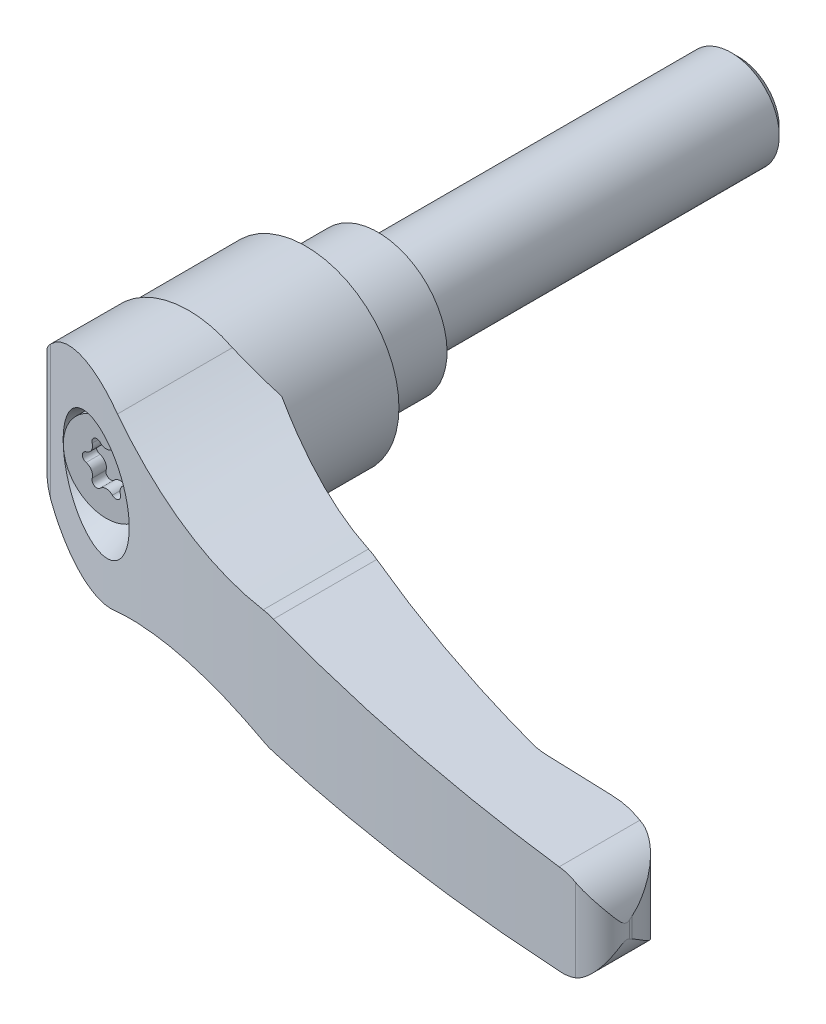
ISO-10303-21;
HEADER;
FILE_DESCRIPTION(('STEP AP214'),'2;1');
FILE_NAME('part.step','',(''),(''),'','','');
FILE_SCHEMA(('AUTOMOTIVE_DESIGN { 1 0 10303 214 1 1 1 1 }'));
ENDSEC;
DATA;
#1=APPLICATION_CONTEXT('core data for automotive mechanical design processes');
#2=APPLICATION_PROTOCOL_DEFINITION('international standard','automotive_design',2000,#1);
#3=PRODUCT_CONTEXT('',#1,'mechanical');
#4=PRODUCT('Part','Part','',(#3));
#5=PRODUCT_RELATED_PRODUCT_CATEGORY('part','',(#4));
#6=PRODUCT_DEFINITION_FORMATION('','',#4);
#7=PRODUCT_DEFINITION_CONTEXT('part definition',#1,'design');
#8=PRODUCT_DEFINITION('design','',#6,#7);
#9=PRODUCT_DEFINITION_SHAPE('','',#8);
#10=(LENGTH_UNIT() NAMED_UNIT(*) SI_UNIT(.MILLI.,.METRE.));
#11=(NAMED_UNIT(*) PLANE_ANGLE_UNIT() SI_UNIT($,.RADIAN.));
#12=(NAMED_UNIT(*) SI_UNIT($,.STERADIAN.) SOLID_ANGLE_UNIT());
#13=UNCERTAINTY_MEASURE_WITH_UNIT(LENGTH_MEASURE(1.E-05),#10,'distance_accuracy_value','');
#14=(GEOMETRIC_REPRESENTATION_CONTEXT(3) GLOBAL_UNCERTAINTY_ASSIGNED_CONTEXT((#13)) GLOBAL_UNIT_ASSIGNED_CONTEXT((#10,
#11,#12)) REPRESENTATION_CONTEXT('',''));
#15=CARTESIAN_POINT('',(0.,0.,0.));
#16=DIRECTION('',(0.,0.,1.));
#17=DIRECTION('',(1.,0.,0.));
#18=AXIS2_PLACEMENT_3D('',#15,#16,#17);
#19=CARTESIAN_POINT('',(-1.58999999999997,2.75396078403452,49.24));
#20=DIRECTION('',(0.,0.,-1.));
#21=DIRECTION('',(0.,1.,0.));
#22=AXIS2_PLACEMENT_3D('',#19,#20,#21);
#23=CYLINDRICAL_SURFACE('',#22,0.794999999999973);
#24=CARTESIAN_POINT('',(-1.58999999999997,2.75396078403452,42.87));
#25=DIRECTION('',(0.,0.,-1.));
#26=DIRECTION('',(0.,1.,0.));
#27=AXIS2_PLACEMENT_3D('',#24,#25,#26);
#28=CIRCLE('',#27,0.794999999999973);
#29=CARTESIAN_POINT('',(-1.0118181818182,3.2996079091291,42.87));
#30=VERTEX_POINT('',#29);
#31=CARTESIAN_POINT('',(-2.3516351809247,2.5260642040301,42.87));
#32=VERTEX_POINT('',#31);
#33=EDGE_CURVE('E926',#30,#32,#28,.F.);
#34=ORIENTED_EDGE('',*,*,#33,.F.);
#35=DIRECTION('',(0.,0.,-1.));
#36=VECTOR('',#35,1.);
#37=CARTESIAN_POINT('',(-1.0118181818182,3.2996079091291,49.24));
#38=LINE('',#37,#36);
#39=CARTESIAN_POINT('',(-1.0118181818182,3.2996079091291,45.19));
#40=VERTEX_POINT('',#39);
#41=EDGE_CURVE('E83',#40,#30,#38,.T.);
#42=ORIENTED_EDGE('',*,*,#41,.F.);
#43=CARTESIAN_POINT('',(-1.58999999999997,2.75396078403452,45.19));
#44=DIRECTION('',(0.,0.,1.));
#45=DIRECTION('',(0.,-1.,0.));
#46=AXIS2_PLACEMENT_3D('',#43,#44,#45);
#47=CIRCLE('',#46,0.794999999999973);
#48=CARTESIAN_POINT('',(-2.3516351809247,2.5260642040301,45.19));
#49=VERTEX_POINT('',#48);
#50=EDGE_CURVE('E928',#49,#40,#47,.F.);
#51=ORIENTED_EDGE('',*,*,#50,.F.);
#52=DIRECTION('',(0.,0.,-1.));
#53=VECTOR('',#52,1.);
#54=CARTESIAN_POINT('',(-2.3516351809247,2.5260642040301,49.24));
#55=LINE('',#54,#53);
#56=EDGE_CURVE('E868',#49,#32,#55,.T.);
#57=ORIENTED_EDGE('',*,*,#56,.T.);
#58=EDGE_LOOP('',(#34,#42,#51,#57));
#59=FACE_BOUND('',#58,.T.);
#60=ADVANCED_FACE('F14',(#59),#23,.F.);
#61=CARTESIAN_POINT('',(1.59,2.75396078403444,49.24));
#62=DIRECTION('',(0.,0.,-1.));
#63=DIRECTION('',(0.,1.,0.));
#64=AXIS2_PLACEMENT_3D('',#61,#62,#63);
#65=CYLINDRICAL_SURFACE('',#64,0.795000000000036);
#66=DIRECTION('',(0.,0.,-1.));
#67=VECTOR('',#66,1.);
#68=CARTESIAN_POINT('',(1.0118181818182,3.2996079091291,49.24));
#69=LINE('',#68,#67);
#70=CARTESIAN_POINT('',(1.0118181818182,3.2996079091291,45.19));
#71=VERTEX_POINT('',#70);
#72=CARTESIAN_POINT('',(1.01181818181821,3.29960790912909,42.87));
#73=VERTEX_POINT('',#72);
#74=EDGE_CURVE('E884',#71,#73,#69,.T.);
#75=ORIENTED_EDGE('',*,*,#74,.T.);
#76=CARTESIAN_POINT('',(1.59,2.75396078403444,42.87));
#77=DIRECTION('',(0.,0.,-1.));
#78=DIRECTION('',(0.,1.,0.));
#79=AXIS2_PLACEMENT_3D('',#76,#77,#78);
#80=CIRCLE('',#79,0.795000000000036);
#81=CARTESIAN_POINT('',(2.3516351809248,2.5260642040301,42.87));
#82=VERTEX_POINT('',#81);
#83=EDGE_CURVE('E893',#82,#73,#80,.F.);
#84=ORIENTED_EDGE('',*,*,#83,.F.);
#85=DIRECTION('',(0.,0.,-1.));
#86=VECTOR('',#85,1.);
#87=CARTESIAN_POINT('',(2.3516351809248,2.5260642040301,49.24));
#88=LINE('',#87,#86);
#89=CARTESIAN_POINT('',(2.3516351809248,2.5260642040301,45.19));
#90=VERTEX_POINT('',#89);
#91=EDGE_CURVE('E896',#90,#82,#88,.T.);
#92=ORIENTED_EDGE('',*,*,#91,.F.);
#93=CARTESIAN_POINT('',(1.59,2.75396078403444,45.19));
#94=DIRECTION('',(0.,0.,1.));
#95=DIRECTION('',(0.,-1.,0.));
#96=AXIS2_PLACEMENT_3D('',#93,#94,#95);
#97=CIRCLE('',#96,0.795000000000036);
#98=EDGE_CURVE('E895',#71,#90,#97,.F.);
#99=ORIENTED_EDGE('',*,*,#98,.F.);
#100=EDGE_LOOP('',(#75,#84,#92,#99));
#101=FACE_BOUND('',#100,.T.);
#102=ADVANCED_FACE('F496',(#101),#65,.F.);
#103=CARTESIAN_POINT('',(3.18,0.,49.24));
#104=DIRECTION('',(0.,0.,-1.));
#105=DIRECTION('',(0.,1.,0.));
#106=AXIS2_PLACEMENT_3D('',#103,#104,#105);
#107=CYLINDRICAL_SURFACE('',#106,0.795);
#108=DIRECTION('',(0.,0.,-1.));
#109=VECTOR('',#108,1.);
#110=CARTESIAN_POINT('',(3.3634533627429,0.77354370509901,49.24));
#111=LINE('',#110,#109);
#112=CARTESIAN_POINT('',(3.3634533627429,0.77354370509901,45.19));
#113=VERTEX_POINT('',#112);
#114=CARTESIAN_POINT('',(3.3634533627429,0.77354370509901,42.87));
#115=VERTEX_POINT('',#114);
#116=EDGE_CURVE('E899',#113,#115,#111,.T.);
#117=ORIENTED_EDGE('',*,*,#116,.T.);
#118=CARTESIAN_POINT('',(3.18,0.,42.87));
#119=DIRECTION('',(0.,0.,-1.));
#120=DIRECTION('',(0.,1.,0.));
#121=AXIS2_PLACEMENT_3D('',#118,#119,#120);
#122=CIRCLE('',#121,0.795);
#123=CARTESIAN_POINT('',(3.3634533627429,-0.773543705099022,42.87));
#124=VERTEX_POINT('',#123);
#125=EDGE_CURVE('E29',#124,#115,#122,.F.);
#126=ORIENTED_EDGE('',*,*,#125,.F.);
#127=DIRECTION('',(0.,0.,-1.));
#128=VECTOR('',#127,1.);
#129=CARTESIAN_POINT('',(3.3634533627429,-0.77354370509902,49.24));
#130=LINE('',#129,#128);
#131=CARTESIAN_POINT('',(3.3634533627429,-0.77354370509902,45.19));
#132=VERTEX_POINT('',#131);
#133=EDGE_CURVE('E905',#132,#124,#130,.T.);
#134=ORIENTED_EDGE('',*,*,#133,.F.);
#135=CARTESIAN_POINT('',(3.18,0.,45.19));
#136=DIRECTION('',(0.,0.,1.));
#137=DIRECTION('',(0.,-1.,0.));
#138=AXIS2_PLACEMENT_3D('',#135,#136,#137);
#139=CIRCLE('',#138,0.795);
#140=EDGE_CURVE('E934',#113,#132,#139,.F.);
#141=ORIENTED_EDGE('',*,*,#140,.F.);
#142=EDGE_LOOP('',(#117,#126,#134,#141));
#143=FACE_BOUND('',#142,.T.);
#144=ADVANCED_FACE('F501',(#143),#107,.F.);
#145=CARTESIAN_POINT('',(1.58999999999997,-2.75396078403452,49.24));
#146=DIRECTION('',(0.,0.,-1.));
#147=DIRECTION('',(0.,1.,0.));
#148=AXIS2_PLACEMENT_3D('',#145,#146,#147);
#149=CYLINDRICAL_SURFACE('',#148,0.794999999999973);
#150=DIRECTION('',(0.,0.,-1.));
#151=VECTOR('',#150,1.);
#152=CARTESIAN_POINT('',(2.3516351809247,-2.5260642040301,49.24));
#153=LINE('',#152,#151);
#154=CARTESIAN_POINT('',(2.3516351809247,-2.5260642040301,45.19));
#155=VERTEX_POINT('',#154);
#156=CARTESIAN_POINT('',(2.3516351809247,-2.5260642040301,42.87));
#157=VERTEX_POINT('',#156);
#158=EDGE_CURVE('E908',#155,#157,#153,.T.);
#159=ORIENTED_EDGE('',*,*,#158,.T.);
#160=CARTESIAN_POINT('',(1.58999999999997,-2.75396078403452,42.87));
#161=DIRECTION('',(0.,0.,-1.));
#162=DIRECTION('',(0.,1.,0.));
#163=AXIS2_PLACEMENT_3D('',#160,#161,#162);
#164=CIRCLE('',#163,0.794999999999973);
#165=CARTESIAN_POINT('',(1.0118181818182,-3.2996079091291,42.87));
#166=VERTEX_POINT('',#165);
#167=EDGE_CURVE('E937',#166,#157,#164,.F.);
#168=ORIENTED_EDGE('',*,*,#167,.F.);
#169=DIRECTION('',(0.,0.,-1.));
#170=VECTOR('',#169,1.);
#171=CARTESIAN_POINT('',(1.0118181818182,-3.2996079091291,49.24));
#172=LINE('',#171,#170);
#173=CARTESIAN_POINT('',(1.0118181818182,-3.2996079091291,45.19));
#174=VERTEX_POINT('',#173);
#175=EDGE_CURVE('E911',#174,#166,#172,.T.);
#176=ORIENTED_EDGE('',*,*,#175,.F.);
#177=CARTESIAN_POINT('',(1.58999999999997,-2.75396078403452,45.19));
#178=DIRECTION('',(0.,0.,1.));
#179=DIRECTION('',(0.,-1.,0.));
#180=AXIS2_PLACEMENT_3D('',#177,#178,#179);
#181=CIRCLE('',#180,0.794999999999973);
#182=EDGE_CURVE('E940',#155,#174,#181,.F.);
#183=ORIENTED_EDGE('',*,*,#182,.F.);
#184=EDGE_LOOP('',(#159,#168,#176,#183));
#185=FACE_BOUND('',#184,.T.);
#186=ADVANCED_FACE('F521',(#185),#149,.F.);
#187=CARTESIAN_POINT('',(-1.59,-2.75396078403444,49.24));
#188=DIRECTION('',(0.,0.,-1.));
#189=DIRECTION('',(0.,1.,0.));
#190=AXIS2_PLACEMENT_3D('',#187,#188,#189);
#191=CYLINDRICAL_SURFACE('',#190,0.795000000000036);
#192=DIRECTION('',(0.,0.,-1.));
#193=VECTOR('',#192,1.);
#194=CARTESIAN_POINT('',(-1.0118181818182,-3.2996079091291,49.24));
#195=LINE('',#194,#193);
#196=CARTESIAN_POINT('',(-1.0118181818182,-3.2996079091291,45.19));
#197=VERTEX_POINT('',#196);
#198=CARTESIAN_POINT('',(-1.01181818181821,-3.29960790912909,42.87));
#199=VERTEX_POINT('',#198);
#200=EDGE_CURVE('E914',#197,#199,#195,.T.);
#201=ORIENTED_EDGE('',*,*,#200,.T.);
#202=CARTESIAN_POINT('',(-1.59,-2.75396078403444,42.87));
#203=DIRECTION('',(0.,0.,-1.));
#204=DIRECTION('',(0.,1.,0.));
#205=AXIS2_PLACEMENT_3D('',#202,#203,#204);
#206=CIRCLE('',#205,0.795000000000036);
#207=CARTESIAN_POINT('',(-2.3516351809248,-2.5260642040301,42.87));
#208=VERTEX_POINT('',#207);
#209=EDGE_CURVE('E943',#208,#199,#206,.F.);
#210=ORIENTED_EDGE('',*,*,#209,.F.);
#211=DIRECTION('',(0.,0.,-1.));
#212=VECTOR('',#211,1.);
#213=CARTESIAN_POINT('',(-2.3516351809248,-2.5260642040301,49.24));
#214=LINE('',#213,#212);
#215=CARTESIAN_POINT('',(-2.3516351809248,-2.5260642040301,45.19));
#216=VERTEX_POINT('',#215);
#217=EDGE_CURVE('E917',#216,#208,#214,.T.);
#218=ORIENTED_EDGE('',*,*,#217,.F.);
#219=CARTESIAN_POINT('',(-1.59,-2.75396078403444,45.19));
#220=DIRECTION('',(0.,0.,1.));
#221=DIRECTION('',(0.,-1.,0.));
#222=AXIS2_PLACEMENT_3D('',#219,#220,#221);
#223=CIRCLE('',#222,0.795000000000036);
#224=EDGE_CURVE('E946',#197,#216,#223,.F.);
#225=ORIENTED_EDGE('',*,*,#224,.F.);
#226=EDGE_LOOP('',(#201,#210,#218,#225));
#227=FACE_BOUND('',#226,.T.);
#228=ADVANCED_FACE('F529',(#227),#191,.F.);
#229=CARTESIAN_POINT('',(-3.18,0.,49.24));
#230=DIRECTION('',(0.,0.,-1.));
#231=DIRECTION('',(0.,1.,0.));
#232=AXIS2_PLACEMENT_3D('',#229,#230,#231);
#233=CYLINDRICAL_SURFACE('',#232,0.795);
#234=CARTESIAN_POINT('',(-3.18,0.,42.87));
#235=DIRECTION('',(0.,0.,-1.));
#236=DIRECTION('',(0.,1.,0.));
#237=AXIS2_PLACEMENT_3D('',#234,#235,#236);
#238=CIRCLE('',#237,0.795);
#239=CARTESIAN_POINT('',(-3.3634533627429,0.773543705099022,42.87));
#240=VERTEX_POINT('',#239);
#241=CARTESIAN_POINT('',(-3.3634533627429,-0.773543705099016,42.87));
#242=VERTEX_POINT('',#241);
#243=EDGE_CURVE('E949',#240,#242,#238,.F.);
#244=ORIENTED_EDGE('',*,*,#243,.F.);
#245=DIRECTION('',(0.,0.,-1.));
#246=VECTOR('',#245,1.);
#247=CARTESIAN_POINT('',(-3.3634533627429,0.77354370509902,49.24));
#248=LINE('',#247,#246);
#249=CARTESIAN_POINT('',(-3.3634533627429,0.77354370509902,45.19));
#250=VERTEX_POINT('',#249);
#251=EDGE_CURVE('E923',#250,#240,#248,.T.);
#252=ORIENTED_EDGE('',*,*,#251,.F.);
#253=CARTESIAN_POINT('',(-3.18,0.,45.19));
#254=DIRECTION('',(0.,0.,1.));
#255=DIRECTION('',(0.,-1.,0.));
#256=AXIS2_PLACEMENT_3D('',#253,#254,#255);
#257=CIRCLE('',#256,0.795);
#258=CARTESIAN_POINT('',(-3.3634533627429,-0.77354370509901,45.19));
#259=VERTEX_POINT('',#258);
#260=EDGE_CURVE('E952',#259,#250,#257,.F.);
#261=ORIENTED_EDGE('',*,*,#260,.F.);
#262=DIRECTION('',(0.,0.,-1.));
#263=VECTOR('',#262,1.);
#264=CARTESIAN_POINT('',(-3.3634533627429,-0.77354370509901,49.24));
#265=LINE('',#264,#263);
#266=EDGE_CURVE('E920',#259,#242,#265,.T.);
#267=ORIENTED_EDGE('',*,*,#266,.T.);
#268=EDGE_LOOP('',(#244,#252,#261,#267));
#269=FACE_BOUND('',#268,.T.);
#270=ADVANCED_FACE('F536',(#269),#233,.F.);
#271=CARTESIAN_POINT('',(-3.68449674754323,2.12724518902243,49.24));
#272=DIRECTION('',(0.,0.,-1.));
#273=DIRECTION('',(0.,1.,0.));
#274=AXIS2_PLACEMENT_3D('',#271,#272,#273);
#275=CYLINDRICAL_SURFACE('',#274,1.39125000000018);
#276=ORIENTED_EDGE('',*,*,#251,.T.);
#277=CARTESIAN_POINT('',(-3.68449674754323,2.12724518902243,42.87));
#278=DIRECTION('',(0.,0.,-1.));
#279=DIRECTION('',(-1.,0.,0.));
#280=AXIS2_PLACEMENT_3D('',#277,#278,#279);
#281=CIRCLE('',#280,1.39125000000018);
#282=EDGE_CURVE('E865',#240,#32,#281,.F.);
#283=ORIENTED_EDGE('',*,*,#282,.T.);
#284=ORIENTED_EDGE('',*,*,#56,.F.);
#285=CARTESIAN_POINT('',(-3.68449674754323,2.12724518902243,45.19));
#286=DIRECTION('',(0.,0.,1.));
#287=DIRECTION('',(0.,-1.,0.));
#288=AXIS2_PLACEMENT_3D('',#285,#286,#287);
#289=CIRCLE('',#288,1.39125000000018);
#290=EDGE_CURVE('E862',#250,#49,#289,.T.);
#291=ORIENTED_EDGE('',*,*,#290,.F.);
#292=EDGE_LOOP('',(#276,#283,#284,#291));
#293=FACE_BOUND('',#292,.T.);
#294=ADVANCED_FACE('F509',(#293),#275,.T.);
#295=CARTESIAN_POINT('',(0.,4.25449037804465,49.24));
#296=DIRECTION('',(0.,0.,-1.));
#297=DIRECTION('',(0.,1.,0.));
#298=AXIS2_PLACEMENT_3D('',#295,#296,#297);
#299=CYLINDRICAL_SURFACE('',#298,1.39125000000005);
#300=ORIENTED_EDGE('',*,*,#41,.T.);
#301=CARTESIAN_POINT('',(0.,4.25449037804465,42.87));
#302=DIRECTION('',(0.,0.,-1.));
#303=DIRECTION('',(-1.,0.,0.));
#304=AXIS2_PLACEMENT_3D('',#301,#302,#303);
#305=CIRCLE('',#304,1.39125000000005);
#306=EDGE_CURVE('E878',#30,#73,#305,.F.);
#307=ORIENTED_EDGE('',*,*,#306,.T.);
#308=ORIENTED_EDGE('',*,*,#74,.F.);
#309=CARTESIAN_POINT('',(0.,4.25449037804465,45.19));
#310=DIRECTION('',(0.,0.,1.));
#311=DIRECTION('',(0.,-1.,0.));
#312=AXIS2_PLACEMENT_3D('',#309,#310,#311);
#313=CIRCLE('',#312,1.39125000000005);
#314=EDGE_CURVE('E973',#40,#71,#313,.T.);
#315=ORIENTED_EDGE('',*,*,#314,.F.);
#316=EDGE_LOOP('',(#300,#307,#308,#315));
#317=FACE_BOUND('',#316,.T.);
#318=ADVANCED_FACE('F506',(#317),#299,.T.);
#319=CARTESIAN_POINT('',(-3.68449674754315,-2.12724518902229,49.24));
#320=DIRECTION('',(0.,0.,-1.));
#321=DIRECTION('',(0.,1.,0.));
#322=AXIS2_PLACEMENT_3D('',#319,#320,#321);
#323=CYLINDRICAL_SURFACE('',#322,1.39125000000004);
#324=ORIENTED_EDGE('',*,*,#217,.T.);
#325=CARTESIAN_POINT('',(-3.68449674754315,-2.12724518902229,42.87));
#326=DIRECTION('',(0.,0.,-1.));
#327=DIRECTION('',(-1.,0.,0.));
#328=AXIS2_PLACEMENT_3D('',#325,#326,#327);
#329=CIRCLE('',#328,1.39125000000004);
#330=EDGE_CURVE('E875',#208,#242,#329,.F.);
#331=ORIENTED_EDGE('',*,*,#330,.T.);
#332=ORIENTED_EDGE('',*,*,#266,.F.);
#333=CARTESIAN_POINT('',(-3.68449674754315,-2.12724518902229,45.19));
#334=DIRECTION('',(0.,0.,1.));
#335=DIRECTION('',(0.,-1.,0.));
#336=AXIS2_PLACEMENT_3D('',#333,#334,#335);
#337=CIRCLE('',#336,1.39125000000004);
#338=EDGE_CURVE('E984',#216,#259,#337,.T.);
#339=ORIENTED_EDGE('',*,*,#338,.F.);
#340=EDGE_LOOP('',(#324,#331,#332,#339));
#341=FACE_BOUND('',#340,.T.);
#342=ADVANCED_FACE('F508',(#341),#323,.T.);
#343=CARTESIAN_POINT('',(0.,-4.25449037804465,49.24));
#344=DIRECTION('',(0.,0.,-1.));
#345=DIRECTION('',(0.,1.,0.));
#346=AXIS2_PLACEMENT_3D('',#343,#344,#345);
#347=CYLINDRICAL_SURFACE('',#346,1.39125000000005);
#348=ORIENTED_EDGE('',*,*,#175,.T.);
#349=CARTESIAN_POINT('',(0.,-4.25449037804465,42.87));
#350=DIRECTION('',(0.,0.,-1.));
#351=DIRECTION('',(-1.,0.,0.));
#352=AXIS2_PLACEMENT_3D('',#349,#350,#351);
#353=CIRCLE('',#352,1.39125000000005);
#354=EDGE_CURVE('E872',#166,#199,#353,.F.);
#355=ORIENTED_EDGE('',*,*,#354,.T.);
#356=ORIENTED_EDGE('',*,*,#200,.F.);
#357=CARTESIAN_POINT('',(0.,-4.25449037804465,45.19));
#358=DIRECTION('',(0.,0.,1.));
#359=DIRECTION('',(0.,-1.,0.));
#360=AXIS2_PLACEMENT_3D('',#357,#358,#359);
#361=CIRCLE('',#360,1.39125000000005);
#362=EDGE_CURVE('E981',#174,#197,#361,.T.);
#363=ORIENTED_EDGE('',*,*,#362,.F.);
#364=EDGE_LOOP('',(#348,#355,#356,#363));
#365=FACE_BOUND('',#364,.T.);
#366=ADVANCED_FACE('F525',(#365),#347,.T.);
#367=CARTESIAN_POINT('',(3.68449674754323,-2.12724518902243,49.24));
#368=DIRECTION('',(0.,0.,-1.));
#369=DIRECTION('',(0.,1.,0.));
#370=AXIS2_PLACEMENT_3D('',#367,#368,#369);
#371=CYLINDRICAL_SURFACE('',#370,1.39125000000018);
#372=ORIENTED_EDGE('',*,*,#133,.T.);
#373=CARTESIAN_POINT('',(3.68449674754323,-2.12724518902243,42.87));
#374=DIRECTION('',(0.,0.,-1.));
#375=DIRECTION('',(-1.,0.,0.));
#376=AXIS2_PLACEMENT_3D('',#373,#374,#375);
#377=CIRCLE('',#376,1.39125000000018);
#378=EDGE_CURVE('E869',#124,#157,#377,.F.);
#379=ORIENTED_EDGE('',*,*,#378,.T.);
#380=ORIENTED_EDGE('',*,*,#158,.F.);
#381=CARTESIAN_POINT('',(3.68449674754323,-2.12724518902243,45.19));
#382=DIRECTION('',(0.,0.,1.));
#383=DIRECTION('',(0.,-1.,0.));
#384=AXIS2_PLACEMENT_3D('',#381,#382,#383);
#385=CIRCLE('',#384,1.39125000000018);
#386=EDGE_CURVE('E978',#132,#155,#385,.T.);
#387=ORIENTED_EDGE('',*,*,#386,.F.);
#388=EDGE_LOOP('',(#372,#379,#380,#387));
#389=FACE_BOUND('',#388,.T.);
#390=ADVANCED_FACE('F516',(#389),#371,.T.);
#391=CARTESIAN_POINT('',(3.68449674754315,2.12724518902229,49.24));
#392=DIRECTION('',(0.,0.,-1.));
#393=DIRECTION('',(0.,1.,0.));
#394=AXIS2_PLACEMENT_3D('',#391,#392,#393);
#395=CYLINDRICAL_SURFACE('',#394,1.39125000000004);
#396=ORIENTED_EDGE('',*,*,#91,.T.);
#397=CARTESIAN_POINT('',(3.68449674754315,2.12724518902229,42.87));
#398=DIRECTION('',(0.,0.,-1.));
#399=DIRECTION('',(-1.,0.,0.));
#400=AXIS2_PLACEMENT_3D('',#397,#398,#399);
#401=CIRCLE('',#400,1.39125000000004);
#402=EDGE_CURVE('E22',#82,#115,#401,.F.);
#403=ORIENTED_EDGE('',*,*,#402,.T.);
#404=ORIENTED_EDGE('',*,*,#116,.F.);
#405=CARTESIAN_POINT('',(3.68449674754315,2.12724518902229,45.19));
#406=DIRECTION('',(0.,0.,1.));
#407=DIRECTION('',(0.,-1.,0.));
#408=AXIS2_PLACEMENT_3D('',#405,#406,#407);
#409=CIRCLE('',#408,1.39125000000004);
#410=EDGE_CURVE('E975',#90,#113,#409,.T.);
#411=ORIENTED_EDGE('',*,*,#410,.F.);
#412=EDGE_LOOP('',(#396,#403,#404,#411));
#413=FACE_BOUND('',#412,.T.);
#414=ADVANCED_FACE('F512',(#413),#395,.T.);
#415=CARTESIAN_POINT('',(0.0100000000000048,0.,12.75));
#416=DIRECTION('',(0.,0.,-1.));
#417=DIRECTION('',(0.,1.,0.));
#418=AXIS2_PLACEMENT_3D('',#415,#416,#417);
#419=CONICAL_SURFACE('',#418,11.5,0.78539816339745);
#420=CARTESIAN_POINT('',(0.0100000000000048,0.,12.4));
#421=DIRECTION('',(0.,0.,1.));
#422=DIRECTION('',(0.,-1.,0.));
#423=AXIS2_PLACEMENT_3D('',#420,#421,#422);
#424=CIRCLE('',#423,11.85);
#425=CARTESIAN_POINT('',(0.0100000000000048,-11.85,12.4));
#426=VERTEX_POINT('',#425);
#427=EDGE_CURVE('E860',#426,#426,#424,.T.);
#428=ORIENTED_EDGE('',*,*,#427,.F.);
#429=EDGE_LOOP('',(#428));
#430=FACE_BOUND('',#429,.T.);
#431=CARTESIAN_POINT('',(0.0100000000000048,0.,12.75));
#432=DIRECTION('',(0.,0.,1.));
#433=DIRECTION('',(0.,-1.,0.));
#434=AXIS2_PLACEMENT_3D('',#431,#432,#433);
#435=CIRCLE('',#434,11.5);
#436=CARTESIAN_POINT('',(0.0050000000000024,-11.4999989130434,12.75));
#437=VERTEX_POINT('',#436);
#438=CARTESIAN_POINT('',(0.00500000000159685,11.4999989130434,12.75));
#439=VERTEX_POINT('',#438);
#440=EDGE_CURVE('E235',#437,#439,#435,.T.);
#441=ORIENTED_EDGE('',*,*,#440,.T.);
#442=CARTESIAN_POINT('',(11.057512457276,3.15933826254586,12.7596148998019));
#443=CARTESIAN_POINT('',(10.9793452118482,3.43293898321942,12.7595468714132));
#444=CARTESIAN_POINT('',(10.89103258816,3.7035655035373,12.7594700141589));
#445=CARTESIAN_POINT('',(10.6945696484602,4.23757900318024,12.7592990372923));
#446=CARTESIAN_POINT('',(10.5864181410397,4.50096554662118,12.7592049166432));
#447=CARTESIAN_POINT('',(10.3508010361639,5.01916329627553,12.7589998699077));
#448=CARTESIAN_POINT('',(10.223322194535,5.27396847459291,12.7588889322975));
#449=CARTESIAN_POINT('',(9.94980531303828,5.77342608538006,12.7586509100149));
#450=CARTESIAN_POINT('',(9.80376629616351,6.01807798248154,12.7585238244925));
#451=CARTESIAN_POINT('',(9.47296532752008,6.52820018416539,12.7582359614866));
#452=CARTESIAN_POINT('',(9.28563751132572,6.79201176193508,12.7580729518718));
#453=CARTESIAN_POINT('',(8.88941417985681,7.30293399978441,12.7577281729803));
#454=CARTESIAN_POINT('',(8.68051666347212,7.55004310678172,12.757546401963));
#455=CARTESIAN_POINT('',(8.24260543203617,8.02583370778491,12.7571653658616));
#456=CARTESIAN_POINT('',(8.01358791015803,8.25451169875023,12.7569660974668));
#457=CARTESIAN_POINT('',(7.53710483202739,8.69175500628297,12.7565515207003));
#458=CARTESIAN_POINT('',(7.28963958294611,8.90032065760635,12.7563362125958));
#459=CARTESIAN_POINT('',(6.77803795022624,9.29584511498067,12.755891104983));
#460=CARTESIAN_POINT('',(6.51390293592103,9.48280569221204,12.755661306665));
#461=CARTESIAN_POINT('',(5.9708200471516,9.83381130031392,12.7551888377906));
#462=CARTESIAN_POINT('',(5.69187209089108,9.99785620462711,12.7549461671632));
#463=CARTESIAN_POINT('',(5.12116330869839,10.3018547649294,12.7544496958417));
#464=CARTESIAN_POINT('',(4.82940317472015,10.4418097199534,12.7541958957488));
#465=CARTESIAN_POINT('',(4.23513054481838,10.6966440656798,12.7536789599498));
#466=CARTESIAN_POINT('',(3.932618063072,10.8115234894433,12.7534158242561));
#467=CARTESIAN_POINT('',(3.31898423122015,11.0153925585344,12.7528820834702));
#468=CARTESIAN_POINT('',(3.00786269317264,11.1043816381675,12.7526114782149));
#469=CARTESIAN_POINT('',(2.37922884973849,11.2558340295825,12.7520647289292));
#470=CARTESIAN_POINT('',(2.06171654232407,11.3182973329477,12.7517885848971));
#471=CARTESIAN_POINT('',(1.42255543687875,11.4162545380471,12.7512327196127));
#472=CARTESIAN_POINT('',(1.10090659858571,11.4517481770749,12.7509529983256));
#473=CARTESIAN_POINT('',(0.455762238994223,11.4955127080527,12.7503919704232));
#474=CARTESIAN_POINT('',(0.132266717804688,11.5037836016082,12.7501106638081));
#475=CARTESIAN_POINT('',(-0.514269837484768,11.4930438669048,12.7495484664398));
#476=CARTESIAN_POINT('',(-0.837310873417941,11.4740333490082,12.749267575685));
#477=CARTESIAN_POINT('',(-1.48064314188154,11.4088661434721,12.7487082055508));
#478=CARTESIAN_POINT('',(-1.80093437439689,11.3627094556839,12.7484297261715));
#479=CARTESIAN_POINT('',(-2.43648954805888,11.2435781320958,12.7478771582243));
#480=CARTESIAN_POINT('',(-2.75175349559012,11.1706035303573,12.747603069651));
#481=CARTESIAN_POINT('',(-3.375013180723,10.9983551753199,12.7470612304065));
#482=CARTESIAN_POINT('',(-3.68300891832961,10.8990814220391,12.7467934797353));
#483=CARTESIAN_POINT('',(-4.28954272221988,10.6749404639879,12.746266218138));
#484=CARTESIAN_POINT('',(-4.58808078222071,10.550073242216,12.7460067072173));
#485=CARTESIAN_POINT('',(-5.17357658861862,10.2756331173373,12.7454977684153));
#486=CARTESIAN_POINT('',(-5.46053433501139,10.1260602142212,12.7452483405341));
#487=CARTESIAN_POINT('',(-6.02082939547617,9.80327210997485,12.744761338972));
#488=CARTESIAN_POINT('',(-6.29416671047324,9.63005691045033,12.7445237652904));
#489=CARTESIAN_POINT('',(-6.82527766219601,9.26121566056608,12.744062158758));
#490=CARTESIAN_POINT('',(-7.08305129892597,9.06558961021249,12.7438381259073));
#491=CARTESIAN_POINT('',(-7.58120221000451,8.65331749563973,12.7434051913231));
#492=CARTESIAN_POINT('',(-7.8215794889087,8.43667143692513,12.7431962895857));
#493=CARTESIAN_POINT('',(-8.28322881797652,7.98389948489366,12.7427950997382));
#494=CARTESIAN_POINT('',(-8.50450086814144,7.74777359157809,12.7426028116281));
#495=CARTESIAN_POINT('',(-8.92636665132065,7.2577206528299,12.7422362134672));
#496=CARTESIAN_POINT('',(-9.12696038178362,7.00379360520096,12.7420619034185));
#497=CARTESIAN_POINT('',(-9.50604338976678,6.4799436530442,12.7417324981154));
#498=CARTESIAN_POINT('',(-9.6845326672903,6.2100207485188,12.7415774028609));
#499=CARTESIAN_POINT('',(-10.0181377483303,5.6560981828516,12.7412875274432));
#500=CARTESIAN_POINT('',(-10.1732535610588,5.37209852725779,12.7411527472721));
#501=CARTESIAN_POINT('',(-10.4590090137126,4.79204142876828,12.7409044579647));
#502=CARTESIAN_POINT('',(-10.5896486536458,4.49598398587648,12.7407909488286));
#503=CARTESIAN_POINT('',(-10.8255229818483,3.8939161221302,12.7405860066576));
#504=CARTESIAN_POINT('',(-10.9307576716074,3.58790570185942,12.7404945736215));
#505=CARTESIAN_POINT('',(-11.1150739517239,2.96810741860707,12.7403344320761));
#506=CARTESIAN_POINT('',(-11.1941555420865,2.65431955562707,12.7402657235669));
#507=CARTESIAN_POINT('',(-11.3256033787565,2.02119732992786,12.740151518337));
#508=CARTESIAN_POINT('',(-11.3779696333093,1.70186296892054,12.740106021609));
#509=CARTESIAN_POINT('',(-11.4556145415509,1.05991792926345,12.7400385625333));
#510=CARTESIAN_POINT('',(-11.4808931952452,0.737307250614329,12.7400166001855));
#511=CARTESIAN_POINT('',(-11.5041831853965,0.0911031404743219,12.7399963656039));
#512=CARTESIAN_POINT('',(-11.5021945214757,-0.232490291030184,12.7399980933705));
#513=CARTESIAN_POINT('',(-11.4709640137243,-0.87835934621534,12.7400252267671));
#514=CARTESIAN_POINT('',(-11.4417221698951,-1.20063496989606,12.7400506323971));
#515=CARTESIAN_POINT('',(-11.3561932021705,-1.84157716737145,12.7401249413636));
#516=CARTESIAN_POINT('',(-11.2999060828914,-2.16024374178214,12.740173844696));
#517=CARTESIAN_POINT('',(-11.1606867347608,-2.79170236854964,12.7402948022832));
#518=CARTESIAN_POINT('',(-11.0777545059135,-3.10449442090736,12.7403668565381));
#519=CARTESIAN_POINT('',(-10.8858345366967,-3.72198024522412,12.7405336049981));
#520=CARTESIAN_POINT('',(-10.7768467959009,-4.02667401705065,12.7406282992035));
#521=CARTESIAN_POINT('',(-10.5335906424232,-4.62579708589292,12.7408396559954));
#522=CARTESIAN_POINT('',(-10.399322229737,-4.92022638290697,12.7409563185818));
#523=CARTESIAN_POINT('',(-10.1064592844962,-5.49672732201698,12.7412107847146));
#524=CARTESIAN_POINT('',(-9.94786474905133,-5.7787989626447,12.7413485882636));
#525=CARTESIAN_POINT('',(-9.60747708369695,-6.32857919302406,12.741644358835));
#526=CARTESIAN_POINT('',(-9.42568395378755,-6.59628778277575,12.7418023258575));
#527=CARTESIAN_POINT('',(-9.04019155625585,-7.11543864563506,12.7421373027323));
#528=CARTESIAN_POINT('',(-8.83649229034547,-7.36688092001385,12.7423143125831));
#529=CARTESIAN_POINT('',(-8.40863578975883,-7.85171157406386,12.7426861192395));
#530=CARTESIAN_POINT('',(-8.18447855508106,-8.08509995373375,12.742880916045));
#531=CARTESIAN_POINT('',(-7.71729969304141,-8.53216361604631,12.7432869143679));
#532=CARTESIAN_POINT('',(-7.47427806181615,-8.74583889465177,12.7434981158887));
#533=CARTESIAN_POINT('',(-6.97109818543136,-9.15195720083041,12.7439354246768));
#534=CARTESIAN_POINT('',(-6.71093994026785,-9.34440022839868,12.7441615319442));
#535=CARTESIAN_POINT('',(-6.17533633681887,-9.70668592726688,12.7446270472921));
#536=CARTESIAN_POINT('',(-5.89989097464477,-9.87652859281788,12.7448664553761));
#537=CARTESIAN_POINT('',(-5.33567144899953,-10.1924060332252,12.7453568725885));
#538=CARTESIAN_POINT('',(-5.04689728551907,-10.3384408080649,12.7456078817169));
#539=CARTESIAN_POINT('',(-4.45807299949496,-10.6056643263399,12.7461197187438));
#540=CARTESIAN_POINT('',(-4.1580228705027,-10.7268530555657,12.7463805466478));
#541=CARTESIAN_POINT('',(-3.54877998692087,-10.9435227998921,12.746910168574));
#542=CARTESIAN_POINT('',(-3.23958723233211,-11.039003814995,12.7471789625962));
#543=CARTESIAN_POINT('',(-2.61425747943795,-11.2035792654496,12.7477226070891));
#544=CARTESIAN_POINT('',(-2.29812048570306,-11.2726737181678,12.7479974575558));
#545=CARTESIAN_POINT('',(-1.66114959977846,-11.3839849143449,12.7485512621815));
#546=CARTESIAN_POINT('',(-1.34031570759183,-11.4262016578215,12.7488302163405));
#547=CARTESIAN_POINT('',(-0.696231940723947,-11.4834573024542,12.7493902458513));
#548=CARTESIAN_POINT('',(-0.372982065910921,-11.498496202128,12.7496713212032));
#549=CARTESIAN_POINT('',(0.273635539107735,-11.5012892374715,12.750233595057));
#550=CARTESIAN_POINT('',(0.597003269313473,-11.4890433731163,12.7505147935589));
#551=CARTESIAN_POINT('',(1.24155799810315,-11.437353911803,12.7510753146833));
#552=CARTESIAN_POINT('',(1.56274499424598,-11.3979102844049,12.7513546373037));
#553=CARTESIAN_POINT('',(2.20065443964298,-11.2921056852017,12.7519094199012));
#554=CARTESIAN_POINT('',(2.51737688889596,-11.2257447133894,12.7521848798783));
#555=CARTESIAN_POINT('',(3.14410517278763,-11.066577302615,12.7527299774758));
#556=CARTESIAN_POINT('',(3.45411101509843,-10.9737708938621,12.7529996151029));
#557=CARTESIAN_POINT('',(4.06520250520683,-10.7623723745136,12.7535311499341));
#558=CARTESIAN_POINT('',(4.3662881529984,-10.6437802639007,12.7537930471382));
#559=CARTESIAN_POINT('',(4.95739910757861,-10.3816532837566,12.754307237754));
#560=CARTESIAN_POINT('',(5.24742439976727,-10.2381183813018,12.7545595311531));
#561=CARTESIAN_POINT('',(5.81435230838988,-9.92712637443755,12.7550527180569));
#562=CARTESIAN_POINT('',(6.09125492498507,-9.75966927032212,12.7552936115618));
#563=CARTESIAN_POINT('',(6.62997198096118,-9.40202131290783,12.7557622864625));
#564=CARTESIAN_POINT('',(6.89178624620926,-9.2118301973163,12.7559900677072));
#565=CARTESIAN_POINT('',(7.39846178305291,-8.81006790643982,12.7564308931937));
#566=CARTESIAN_POINT('',(7.64332305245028,-8.59849672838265,12.7566439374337));
#567=CARTESIAN_POINT('',(8.11434590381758,-8.15548396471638,12.7570537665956));
#568=CARTESIAN_POINT('',(8.34050794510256,-7.92404286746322,12.7572505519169));
#569=CARTESIAN_POINT('',(8.77253106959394,-7.44293132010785,12.7576264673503));
#570=CARTESIAN_POINT('',(8.9783921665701,-7.19326088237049,12.7578055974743));
#571=CARTESIAN_POINT('',(9.36833693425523,-6.67748283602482,12.7581449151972));
#572=CARTESIAN_POINT('',(9.55242206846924,-6.41137633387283,12.758305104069));
#573=CARTESIAN_POINT('',(9.89752289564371,-5.86460187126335,12.7586054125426));
#574=CARTESIAN_POINT('',(10.0585385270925,-5.58393387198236,12.7587455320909));
#575=CARTESIAN_POINT('',(10.3563791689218,-5.0099858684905,12.7590047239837));
#576=CARTESIAN_POINT('',(10.4932002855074,-4.71670384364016,12.7591237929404));
#577=CARTESIAN_POINT('',(10.7416459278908,-4.11965888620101,12.7593400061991));
#578=CARTESIAN_POINT('',(10.8532707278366,-3.81589606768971,12.7594371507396));
#579=CARTESIAN_POINT('',(11.0505616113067,-3.19995233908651,12.7596088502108));
#580=CARTESIAN_POINT('',(11.1362198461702,-2.88776891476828,12.7596833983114));
#581=CARTESIAN_POINT('',(11.2809236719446,-2.25729439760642,12.7598093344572));
#582=CARTESIAN_POINT('',(11.3399690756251,-1.93900326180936,12.7598607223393));
#583=CARTESIAN_POINT('',(11.4309937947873,-1.29878147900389,12.7599399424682));
#584=CARTESIAN_POINT('',(11.4629912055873,-0.976853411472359,12.7599677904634));
#585=CARTESIAN_POINT('',(11.4997633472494,-0.33154382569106,12.7599997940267));
#586=CARTESIAN_POINT('',(11.5045430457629,-0.00816258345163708,12.7600039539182));
#587=CARTESIAN_POINT('',(11.4825110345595,0.795622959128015,12.7599847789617));
#588=CARTESIAN_POINT('',(11.4391488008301,1.27566218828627,12.7599470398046));
#589=CARTESIAN_POINT('',(11.2926682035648,2.22640801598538,12.7598195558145));
#590=CARTESIAN_POINT('',(11.1895681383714,2.69711742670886,12.7597298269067));
#591=CARTESIAN_POINT('',(11.057512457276,3.15933826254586,12.7596148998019));
#592=B_SPLINE_CURVE_WITH_KNOTS('',3,(#442,#443,#444,#445,#446,#447,#448,#449,#450,#451,#452,
#453,#454,#455,#456,#457,#458,#459,#460,#461,#462,#463,#464,#465,#466,#467,#468,#469,#470,#471,
#472,#473,#474,#475,#476,#477,#478,#479,#480,#481,#482,#483,#484,#485,#486,#487,#488,#489,#490,
#491,#492,#493,#494,#495,#496,#497,#498,#499,#500,#501,#502,#503,#504,#505,#506,#507,#508,#509,
#510,#511,#512,#513,#514,#515,#516,#517,#518,#519,#520,#521,#522,#523,#524,#525,#526,#527,#528,
#529,#530,#531,#532,#533,#534,#535,#536,#537,#538,#539,#540,#541,#542,#543,#544,#545,#546,#547,
#548,#549,#550,#551,#552,#553,#554,#555,#556,#557,#558,#559,#560,#561,#562,#563,#564,#565,#566,
#567,#568,#569,#570,#571,#572,#573,#574,#575,#576,#577,#578,#579,#580,#581,#582,#583,#584,#585,
#586,#587,#588,#589,#590,#591),.UNSPECIFIED.,.T.,.F.,(4,2,2,2,2,2,2,2,2,2,2,2,2,2,2,2,2,2,2,2,2,
2,2,2,2,2,2,2,2,2,2,2,2,2,2,2,2,2,2,2,2,2,2,2,2,2,2,2,2,2,2,2,2,2,2,2,2,2,2,2,2,2,2,2,2,2,2,2,2,
2,2,2,2,2,4),(0.,0.853321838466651,1.70669493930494,2.56065548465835,3.41466100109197,
4.38415393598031,5.35373689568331,6.32350370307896,7.29325436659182,8.26292547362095,
9.23260193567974,10.202226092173,11.1718489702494,12.1414930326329,13.1111374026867,
14.0807912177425,15.0504449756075,16.0200948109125,16.989744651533,17.9593932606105,
18.9290418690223,19.8986911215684,20.8683403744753,21.8379895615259,22.8076387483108,
23.7772876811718,24.7469366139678,25.7165856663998,26.6862347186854,27.6558833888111,
28.6255320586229,29.5951806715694,30.5648292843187,31.5344775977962,32.504125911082,
33.4737742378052,34.4434225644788,35.4130707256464,36.3827188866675,37.3523670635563,
38.3220152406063,39.2916635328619,40.261311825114,41.2309600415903,42.200608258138,
43.1702566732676,44.1399050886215,45.1095537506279,46.0792024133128,47.0488516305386,
48.0185008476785,48.9881494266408,49.9577980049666,50.9274466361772,51.8970952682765,
52.8667449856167,53.8363947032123,54.8060433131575,55.7756919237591,56.7453418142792,
57.7149916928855,58.6846527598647,59.6543139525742,60.6239513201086,61.5935880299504,
62.5631595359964,63.5327336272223,64.5024636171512,65.4721830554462,66.4421953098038,
67.4122143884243,68.3815840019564,69.3507766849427,70.7928193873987,72.2344206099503),.UNSPECIFIED.);
#593=EDGE_CURVE('E571',#439,#437,#592,.T.);
#594=ORIENTED_EDGE('',*,*,#593,.T.);
#595=EDGE_LOOP('',(#441,#594));
#596=FACE_BOUND('',#595,.T.);
#597=ADVANCED_FACE('F515',(#430,#596),#419,.F.);
#598=CARTESIAN_POINT('',(0.0100000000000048,0.,12.));
#599=DIRECTION('',(0.,0.,1.));
#600=DIRECTION('',(0.,-1.,0.));
#601=AXIS2_PLACEMENT_3D('',#598,#599,#600);
#602=CYLINDRICAL_SURFACE('',#601,11.85);
#603=CARTESIAN_POINT('',(0.0100000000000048,0.,12.));
#604=DIRECTION('',(0.,0.,-1.));
#605=DIRECTION('',(1.,0.,0.));
#606=AXIS2_PLACEMENT_3D('',#603,#604,#605);
#607=CIRCLE('',#606,11.85);
#608=CARTESIAN_POINT('',(11.86,0.,12.));
#609=VERTEX_POINT('',#608);
#610=EDGE_CURVE('E1026',#609,#609,#607,.T.);
#611=ORIENTED_EDGE('',*,*,#610,.T.);
#612=EDGE_LOOP('',(#611));
#613=FACE_BOUND('',#612,.T.);
#614=ORIENTED_EDGE('',*,*,#427,.T.);
#615=EDGE_LOOP('',(#614));
#616=FACE_BOUND('',#615,.T.);
#617=ADVANCED_FACE('F321',(#613,#616),#602,.F.);
#618=CARTESIAN_POINT('',(0.,0.,12.));
#619=DIRECTION('',(0.,0.,-1.));
#620=DIRECTION('',(1.,0.,0.));
#621=AXIS2_PLACEMENT_3D('',#618,#619,#620);
#622=PLANE('',#621);
#623=ORIENTED_EDGE('',*,*,#610,.F.);
#624=EDGE_LOOP('',(#623));
#625=FACE_BOUND('',#624,.T.);
#626=DIRECTION('',(0.,1.,0.));
#627=VECTOR('',#626,1.);
#628=CARTESIAN_POINT('',(-15.250037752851,-32.,12.));
#629=LINE('',#628,#627);
#630=CARTESIAN_POINT('',(-15.250037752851,-2.77242647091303,12.));
#631=VERTEX_POINT('',#630);
#632=CARTESIAN_POINT('',(-15.250037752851,2.77242647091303,12.));
#633=VERTEX_POINT('',#632);
#634=EDGE_CURVE('E91',#631,#633,#629,.T.);
#635=ORIENTED_EDGE('',*,*,#634,.T.);
#636=CARTESIAN_POINT('',(0.,0.,12.));
#637=DIRECTION('',(0.,0.,-1.));
#638=DIRECTION('',(1.,0.,0.));
#639=AXIS2_PLACEMENT_3D('',#636,#637,#638);
#640=CIRCLE('',#639,15.5);
#641=EDGE_CURVE('E223',#633,#631,#640,.T.);
#642=ORIENTED_EDGE('',*,*,#641,.T.);
#643=EDGE_LOOP('',(#635,#642));
#644=FACE_BOUND('',#643,.T.);
#645=ADVANCED_FACE('F233',(#625,#644),#622,.T.);
#646=CARTESIAN_POINT('',(-15.5,-32.,12.249962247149));
#647=DIRECTION('',(0.707106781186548,0.,0.707106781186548));
#648=DIRECTION('',(-0.707106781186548,0.,0.707106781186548));
#649=AXIS2_PLACEMENT_3D('',#646,#647,#648);
#650=PLANE('',#649);
#651=CARTESIAN_POINT('',(0.,0.,-3.250037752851));
#652=DIRECTION('',(0.707106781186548,0.,0.707106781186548));
#653=DIRECTION('',(0.707106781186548,0.,-0.707106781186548));
#654=AXIS2_PLACEMENT_3D('',#651,#652,#653);
#655=ELLIPSE('',#654,21.920310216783,15.5);
#656=EDGE_CURVE('E225',#631,#633,#655,.F.);
#657=ORIENTED_EDGE('',*,*,#656,.T.);
#658=ORIENTED_EDGE('',*,*,#634,.F.);
#659=EDGE_LOOP('',(#657,#658));
#660=FACE_BOUND('',#659,.T.);
#661=ADVANCED_FACE('F230',(#660),#650,.F.);
#662=CARTESIAN_POINT('',(0.,0.,36.6875));
#663=DIRECTION('',(0.,0.,-1.));
#664=DIRECTION('',(1.,0.,0.));
#665=AXIS2_PLACEMENT_3D('',#662,#663,#664);
#666=CYLINDRICAL_SURFACE('',#665,15.5);
#667=CARTESIAN_POINT('',(0.,0.,31.5));
#668=DIRECTION('',(0.,0.,1.));
#669=DIRECTION('',(0.,-1.,0.));
#670=AXIS2_PLACEMENT_3D('',#667,#668,#669);
#671=CIRCLE('',#670,15.5);
#672=CARTESIAN_POINT('',(-15.5,0.,31.5));
#673=VERTEX_POINT('',#672);
#674=CARTESIAN_POINT('',(15.5,0.,31.5));
#675=VERTEX_POINT('',#674);
#676=EDGE_CURVE('E227',#673,#675,#671,.T.);
#677=ORIENTED_EDGE('',*,*,#676,.F.);
#678=EDGE_CURVE('E1094',#675,#673,#671,.T.);
#679=ORIENTED_EDGE('',*,*,#678,.F.);
#680=EDGE_LOOP('',(#677,#679));
#681=FACE_BOUND('',#680,.T.);
#682=ORIENTED_EDGE('',*,*,#656,.F.);
#683=ORIENTED_EDGE('',*,*,#641,.F.);
#684=EDGE_LOOP('',(#682,#683));
#685=FACE_BOUND('',#684,.T.);
#686=ADVANCED_FACE('F224',(#681,#685),#666,.T.);
#687=CARTESIAN_POINT('',(0.0100000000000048,0.,61.));
#688=DIRECTION('',(0.,0.,1.));
#689=DIRECTION('',(0.,-1.,0.));
#690=AXIS2_PLACEMENT_3D('',#687,#688,#689);
#691=CONICAL_SURFACE('',#690,13.748780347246,0.349065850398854);
#692=CARTESIAN_POINT('',(0.0100000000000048,0.,42.87));
#693=DIRECTION('',(0.,0.,1.));
#694=DIRECTION('',(0.,-1.,0.));
#695=AXIS2_PLACEMENT_3D('',#692,#693,#694);
#696=CIRCLE('',#695,7.15);
#697=CARTESIAN_POINT('',(0.0050000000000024,-7.14999825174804,42.87));
#698=VERTEX_POINT('',#697);
#699=CARTESIAN_POINT('',(0.0050000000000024,7.14999825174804,42.87));
#700=VERTEX_POINT('',#699);
#701=EDGE_CURVE('E37',#698,#700,#696,.T.);
#702=ORIENTED_EDGE('',*,*,#701,.F.);
#703=CARTESIAN_POINT('',(7.03183954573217,1.29450090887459,42.8429799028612));
#704=CARTESIAN_POINT('',(6.99069549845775,1.51819635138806,42.8431382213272));
#705=CARTESIAN_POINT('',(6.93880997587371,1.73990977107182,42.84333787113));
#706=CARTESIAN_POINT('',(6.81417682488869,2.17740487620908,42.8438174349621));
#707=CARTESIAN_POINT('',(6.74142826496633,2.39318629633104,42.8440973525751));
#708=CARTESIAN_POINT('',(6.5759091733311,2.81627852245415,42.8447342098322));
#709=CARTESIAN_POINT('',(6.48319120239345,3.02360989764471,42.845090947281));
#710=CARTESIAN_POINT('',(6.27848211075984,3.42849783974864,42.8458785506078));
#711=CARTESIAN_POINT('',(6.16649402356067,3.62605593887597,42.8463094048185));
#712=CARTESIAN_POINT('',(5.93806231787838,3.987772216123,42.8471882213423));
#713=CARTESIAN_POINT('',(5.82357805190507,4.1531720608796,42.84762864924));
#714=CARTESIAN_POINT('',(5.5810849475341,4.47374290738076,42.8485614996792));
#715=CARTESIAN_POINT('',(5.45307647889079,4.62891418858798,42.8490539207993));
#716=CARTESIAN_POINT('',(5.18439686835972,4.92797656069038,42.8500874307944));
#717=CARTESIAN_POINT('',(5.04372112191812,5.07186351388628,42.8506285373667));
#718=CARTESIAN_POINT('',(4.75074933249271,5.34727025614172,42.851755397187));
#719=CARTESIAN_POINT('',(4.59845354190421,5.47879031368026,42.8523411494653));
#720=CARTESIAN_POINT('',(4.28315544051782,5.72866354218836,42.8535537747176));
#721=CARTESIAN_POINT('',(4.12014192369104,5.84700257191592,42.8541806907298));
#722=CARTESIAN_POINT('',(3.78471750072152,6.06950687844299,42.8554705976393));
#723=CARTESIAN_POINT('',(3.61230688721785,6.17367259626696,42.8561335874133));
#724=CARTESIAN_POINT('',(3.25969172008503,6.36688701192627,42.857489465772));
#725=CARTESIAN_POINT('',(3.07950417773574,6.45596679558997,42.8581822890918));
#726=CARTESIAN_POINT('',(2.71234774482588,6.61860590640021,42.8595939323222));
#727=CARTESIAN_POINT('',(2.52538292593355,6.69217437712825,42.8603127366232));
#728=CARTESIAN_POINT('',(2.26625144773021,6.78174103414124,42.8613089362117));
#729=CARTESIAN_POINT('',(2.19642556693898,6.80467590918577,42.8615773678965));
#730=CARTESIAN_POINT('',(2.05609451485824,6.84838502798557,42.8621168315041));
#731=CARTESIAN_POINT('',(1.98558927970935,6.86915906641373,42.8623878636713));
#732=CARTESIAN_POINT('',(1.69614267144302,6.94960898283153,42.8635005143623));
#733=CARTESIAN_POINT('',(1.47452578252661,6.99998359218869,42.8643523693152));
#734=CARTESIAN_POINT('',(1.027376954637,7.07945115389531,42.866071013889));
#735=CARTESIAN_POINT('',(0.801842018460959,7.10852700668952,42.8669378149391));
#736=CARTESIAN_POINT('',(0.348507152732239,7.1451285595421,42.8686800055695));
#737=CARTESIAN_POINT('',(0.12070326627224,7.15260558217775,42.8695554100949));
#738=CARTESIAN_POINT('',(-0.334671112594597,7.14579355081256,42.8713052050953));
#739=CARTESIAN_POINT('',(-0.562241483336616,7.13149622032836,42.872179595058));
#740=CARTESIAN_POINT('',(-0.988506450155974,7.08419530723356,42.8738173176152));
#741=CARTESIAN_POINT('',(-1.1874689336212,7.05357187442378,42.8745816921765));
#742=CARTESIAN_POINT('',(-1.58210608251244,6.97566382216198,42.8760977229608));
#743=CARTESIAN_POINT('',(-1.77778084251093,6.92837968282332,42.8768493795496));
#744=CARTESIAN_POINT('',(-2.16423124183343,6.8175484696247,42.8783337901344));
#745=CARTESIAN_POINT('',(-2.35501209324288,6.75401956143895,42.8790665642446));
#746=CARTESIAN_POINT('',(-2.73055441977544,6.61112216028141,42.8805089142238));
#747=CARTESIAN_POINT('',(-2.91531569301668,6.53175313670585,42.8812184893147));
#748=CARTESIAN_POINT('',(-3.27783499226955,6.35757906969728,42.8826106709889));
#749=CARTESIAN_POINT('',(-3.45557942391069,6.26274572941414,42.8832932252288));
#750=CARTESIAN_POINT('',(-3.80243195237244,6.05842592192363,42.8846251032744));
#751=CARTESIAN_POINT('',(-3.97154019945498,5.94893970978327,42.8852744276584));
#752=CARTESIAN_POINT('',(-4.30004997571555,5.71599903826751,42.8865357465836));
#753=CARTESIAN_POINT('',(-4.45944371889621,5.59253359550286,42.8871477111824));
#754=CARTESIAN_POINT('',(-4.76718607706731,5.33263471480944,42.8883291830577));
#755=CARTESIAN_POINT('',(-4.91553818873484,5.1962054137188,42.8888987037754));
#756=CARTESIAN_POINT('',(-5.21881270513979,4.89268060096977,42.8900629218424));
#757=CARTESIAN_POINT('',(-5.37206129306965,4.72390730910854,42.8906511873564));
#758=CARTESIAN_POINT('',(-5.6617726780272,4.37249351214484,42.891763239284));
#759=CARTESIAN_POINT('',(-5.79823322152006,4.18985115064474,42.892287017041));
#760=CARTESIAN_POINT('',(-6.05310399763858,3.81238641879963,42.8932652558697));
#761=CARTESIAN_POINT('',(-6.1715147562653,3.6175644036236,42.8937197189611));
#762=CARTESIAN_POINT('',(-6.38919688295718,3.21753055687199,42.894555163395));
#763=CARTESIAN_POINT('',(-6.48847083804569,3.01232013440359,42.8949361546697));
#764=CARTESIAN_POINT('',(-6.65653368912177,2.61791636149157,42.8955811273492));
#765=CARTESIAN_POINT('',(-6.72753074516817,2.42965976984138,42.8958535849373));
#766=CARTESIAN_POINT('',(-6.85343572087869,2.0477669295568,42.8963367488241));
#767=CARTESIAN_POINT('',(-6.90833850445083,1.85412898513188,42.8965474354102));
#768=CARTESIAN_POINT('',(-7.00159360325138,1.46306693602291,42.896905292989));
#769=CARTESIAN_POINT('',(-7.03995857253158,1.26564584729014,42.8970525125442));
#770=CARTESIAN_POINT('',(-7.09993884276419,0.868200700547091,42.8972826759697));
#771=CARTESIAN_POINT('',(-7.12154799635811,0.668175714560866,42.8973655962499));
#772=CARTESIAN_POINT('',(-7.14783671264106,0.267056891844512,42.8974664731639));
#773=CARTESIAN_POINT('',(-7.15251967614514,0.0659632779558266,42.8974844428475));
#774=CARTESIAN_POINT('',(-7.14493086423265,-0.335978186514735,42.8974553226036));
#775=CARTESIAN_POINT('',(-7.13265282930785,-0.536825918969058,42.8974082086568));
#776=CARTESIAN_POINT('',(-7.09122422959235,-0.936714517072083,42.8972492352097));
#777=CARTESIAN_POINT('',(-7.06207856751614,-1.13575589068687,42.8971373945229));
#778=CARTESIAN_POINT('',(-6.98711177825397,-1.53074943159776,42.8968497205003));
#779=CARTESIAN_POINT('',(-6.94128449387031,-1.72670043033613,42.8966738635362));
#780=CARTESIAN_POINT('',(-6.83330403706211,-2.1139649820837,42.8962594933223));
#781=CARTESIAN_POINT('',(-6.77115752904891,-2.30528039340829,42.8960210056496));
#782=CARTESIAN_POINT('',(-6.63094529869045,-2.6820675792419,42.8954829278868));
#783=CARTESIAN_POINT('',(-6.55287362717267,-2.86753713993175,42.8951833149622));
#784=CARTESIAN_POINT('',(-6.38141700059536,-3.23116157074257,42.8945253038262));
#785=CARTESIAN_POINT('',(-6.28803852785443,-3.40931949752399,42.8941669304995));
#786=CARTESIAN_POINT('',(-6.08656287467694,-3.75721663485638,42.8933936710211));
#787=CARTESIAN_POINT('',(-5.97845904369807,-3.92695199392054,42.8929787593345));
#788=CARTESIAN_POINT('',(-5.74833350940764,-4.25671078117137,42.8920954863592));
#789=CARTESIAN_POINT('',(-5.62631175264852,-4.41673417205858,42.8916271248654));
#790=CARTESIAN_POINT('',(-5.36927692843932,-4.72586007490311,42.8906404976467));
#791=CARTESIAN_POINT('',(-5.23426977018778,-4.87496750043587,42.8901222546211));
#792=CARTESIAN_POINT('',(-4.952117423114,-5.16134237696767,42.8890391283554));
#793=CARTESIAN_POINT('',(-4.80496713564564,-5.2986048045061,42.8884742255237));
#794=CARTESIAN_POINT('',(-4.49968173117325,-5.56019390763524,42.8873021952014));
#795=CARTESIAN_POINT('',(-4.34155074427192,-5.68452540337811,42.8866950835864));
#796=CARTESIAN_POINT('',(-4.01531134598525,-5.91947632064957,42.8854424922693));
#797=CARTESIAN_POINT('',(-3.84719884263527,-6.03009006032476,42.8847969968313));
#798=CARTESIAN_POINT('',(-3.50231519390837,-6.236720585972,42.8834726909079));
#799=CARTESIAN_POINT('',(-3.32554726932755,-6.33274274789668,42.8827938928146));
#800=CARTESIAN_POINT('',(-2.96449885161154,-6.5095825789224,42.881407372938));
#801=CARTESIAN_POINT('',(-2.78021617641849,-6.59039579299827,42.8806996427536));
#802=CARTESIAN_POINT('',(-2.40556659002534,-6.73618130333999,42.8792607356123));
#803=CARTESIAN_POINT('',(-2.21520194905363,-6.80115943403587,42.8785295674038));
#804=CARTESIAN_POINT('',(-1.82963729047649,-6.91486315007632,42.8770485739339));
#805=CARTESIAN_POINT('',(-1.63443630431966,-6.9635854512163,42.8762987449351));
#806=CARTESIAN_POINT('',(-1.24069668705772,-7.04439835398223,42.8747861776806));
#807=CARTESIAN_POINT('',(-1.0421593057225,-7.07649504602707,42.8740234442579));
#808=CARTESIAN_POINT('',(-0.642932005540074,-7.12387351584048,42.8724896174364));
#809=CARTESIAN_POINT('',(-0.442240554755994,-7.13914239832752,42.8717185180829));
#810=CARTESIAN_POINT('',(-0.0403562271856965,-7.15271193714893,42.8701743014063));
#811=CARTESIAN_POINT('',(0.160836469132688,-7.15101800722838,42.8694011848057));
#812=CARTESIAN_POINT('',(0.588756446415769,-7.12934628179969,42.8677567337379));
#813=CARTESIAN_POINT('',(0.815367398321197,-7.10699667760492,42.8668858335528));
#814=CARTESIAN_POINT('',(1.26545011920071,-7.04080168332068,42.8651559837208));
#815=CARTESIAN_POINT('',(1.48892146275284,-6.99695340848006,42.8642970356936));
#816=CARTESIAN_POINT('',(1.93066705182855,-6.88816144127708,42.8625990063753));
#817=CARTESIAN_POINT('',(2.14894133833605,-6.82321791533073,42.8617599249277));
#818=CARTESIAN_POINT('',(2.57828599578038,-6.67283045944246,42.860109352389));
#819=CARTESIAN_POINT('',(2.78935732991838,-6.58738928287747,42.8592978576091));
#820=CARTESIAN_POINT('',(3.17840058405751,-6.40786212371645,42.8578020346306));
#821=CARTESIAN_POINT('',(3.35737080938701,-6.31593051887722,42.8571138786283));
#822=CARTESIAN_POINT('',(3.70699248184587,-6.11728190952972,42.8557694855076));
#823=CARTESIAN_POINT('',(3.87764126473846,-6.01056021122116,42.855113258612));
#824=CARTESIAN_POINT('',(4.20923829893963,-5.7831830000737,42.8538380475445));
#825=CARTESIAN_POINT('',(4.37019221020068,-5.66253573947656,42.8532190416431));
#826=CARTESIAN_POINT('',(4.68137022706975,-5.40811091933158,42.8520222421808));
#827=CARTESIAN_POINT('',(4.83159412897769,-5.27433311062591,42.8514444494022));
#828=CARTESIAN_POINT('',(5.1202550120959,-4.99458595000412,42.850334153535));
#829=CARTESIAN_POINT('',(5.25869080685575,-4.84861537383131,42.8498016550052));
#830=CARTESIAN_POINT('',(5.52277431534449,-4.5455322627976,42.8487858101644));
#831=CARTESIAN_POINT('',(5.6484220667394,-4.38841976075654,42.8483024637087));
#832=CARTESIAN_POINT('',(5.88606115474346,-4.06413587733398,42.8473882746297));
#833=CARTESIAN_POINT('',(5.99804968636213,-3.89696244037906,42.8469574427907));
#834=CARTESIAN_POINT('',(6.20754176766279,-3.55377827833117,42.8461514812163));
#835=CARTESIAN_POINT('',(6.30504562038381,-3.37776773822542,42.8457763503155));
#836=CARTESIAN_POINT('',(6.4849218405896,-3.01806937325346,42.8450842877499));
#837=CARTESIAN_POINT('',(6.56728677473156,-2.83437783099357,42.8447673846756));
#838=CARTESIAN_POINT('',(6.71621272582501,-2.46077476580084,42.84419437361));
#839=CARTESIAN_POINT('',(6.7827795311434,-2.2708655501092,42.843938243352));
#840=CARTESIAN_POINT('',(6.8996473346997,-1.88620013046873,42.8434885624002));
#841=CARTESIAN_POINT('',(6.9499557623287,-1.69144618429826,42.8432949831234));
#842=CARTESIAN_POINT('',(7.03397996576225,-1.29846042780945,42.8429716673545));
#843=CARTESIAN_POINT('',(7.06770096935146,-1.1002297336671,42.8428419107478));
#844=CARTESIAN_POINT('',(7.12090422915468,-0.681312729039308,42.8426371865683));
#845=CARTESIAN_POINT('',(7.1385863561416,-0.460395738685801,42.8425691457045));
#846=CARTESIAN_POINT('',(7.15340038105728,-0.0182636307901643,42.8425121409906));
#847=CARTESIAN_POINT('',(7.1505683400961,0.202950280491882,42.842523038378));
#848=CARTESIAN_POINT('',(7.13744408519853,0.423546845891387,42.8425735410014));
#849=B_SPLINE_CURVE_WITH_KNOTS('',3,(#703,#704,#705,#706,#707,#708,#709,#710,#711,#712,#713,
#714,#715,#716,#717,#718,#719,#720,#721,#722,#723,#724,#725,#726,#727,#728,#729,#730,#731,#732,
#733,#734,#735,#736,#737,#738,#739,#740,#741,#742,#743,#744,#745,#746,#747,#748,#749,#750,#751,
#752,#753,#754,#755,#756,#757,#758,#759,#760,#761,#762,#763,#764,#765,#766,#767,#768,#769,#770,
#771,#772,#773,#774,#775,#776,#777,#778,#779,#780,#781,#782,#783,#784,#785,#786,#787,#788,#789,
#790,#791,#792,#793,#794,#795,#796,#797,#798,#799,#800,#801,#802,#803,#804,#805,#806,#807,#808,
#809,#810,#811,#812,#813,#814,#815,#816,#817,#818,#819,#820,#821,#822,#823,#824,#825,#826,#827,
#828,#829,#830,#831,#832,#833,#834,#835,#836,#837,#838,#839,#840,#841,#842,#843,#844,#845,#846,
#847,#848),.UNSPECIFIED.,.F.,.F.,(4,2,2,2,2,2,2,2,2,2,2,2,2,2,2,2,2,2,2,2,2,2,2,2,2,2,2,2,2,2,2,
2,2,2,2,2,2,2,2,2,2,2,2,2,2,2,2,2,2,2,2,2,2,2,2,2,2,2,2,2,2,2,2,2,2,2,2,2,2,2,2,2,4),(0.,
0.682077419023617,1.3641852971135,2.04451929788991,2.72474629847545,3.32751763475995,
3.93027249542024,4.53324734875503,5.13620910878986,5.7398116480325,6.34339540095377,
6.94571987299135,7.54768828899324,7.76815066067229,7.98863396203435,8.66929657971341,
9.35050506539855,10.0332476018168,10.7162497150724,11.3194706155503,11.9226741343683,
12.5252060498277,13.1277581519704,13.7314254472,14.3350822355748,14.9392166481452,
15.5431589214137,16.226005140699,16.9089429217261,17.5918607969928,18.2746862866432,
18.8775864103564,19.4806787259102,20.0833087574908,20.6861597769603,21.2888896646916,
21.8918420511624,22.4946192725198,23.0976192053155,23.7003732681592,24.3033529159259,
24.9060778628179,25.5090759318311,26.1120763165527,26.7148035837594,27.3177852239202,
27.9205412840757,28.5235461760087,29.1263283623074,29.7292868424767,30.3320228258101,
30.93488050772,31.5375171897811,32.1406153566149,32.7435210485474,33.4255997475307,
34.1077699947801,34.7899348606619,35.4720081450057,36.0749158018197,36.6780152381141,
37.2807590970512,37.8835143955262,38.4863302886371,39.0891444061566,39.6920821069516,
40.2950071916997,40.8982275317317,41.5012265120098,42.1039495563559,42.7064825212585,
43.3703866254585,44.0331239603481),.UNSPECIFIED.);
#850=EDGE_CURVE('E579',#698,#700,#849,.F.);
#851=ORIENTED_EDGE('',*,*,#850,.T.);
#852=EDGE_LOOP('',(#702,#851));
#853=FACE_BOUND('',#852,.T.);
#854=CARTESIAN_POINT('',(-4.94012970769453,6.55133222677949,45.7856117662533));
#855=CARTESIAN_POINT('',(-4.76003298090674,6.72163604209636,45.8606326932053));
#856=CARTESIAN_POINT('',(-4.57352155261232,6.88402615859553,45.9381560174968));
#857=CARTESIAN_POINT('',(-4.18900534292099,7.19233021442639,46.0975821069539));
#858=CARTESIAN_POINT('',(-3.99099714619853,7.33823921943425,46.1794861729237));
#859=CARTESIAN_POINT('',(-3.5846763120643,7.61310545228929,46.3471158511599));
#860=CARTESIAN_POINT('',(-3.37635073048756,7.74204060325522,46.432846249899));
#861=CARTESIAN_POINT('',(-2.950930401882,7.98229606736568,46.6074355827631));
#862=CARTESIAN_POINT('',(-2.73383238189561,8.09360972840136,46.6962956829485));
#863=CARTESIAN_POINT('',(-2.2754900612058,8.30594801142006,46.8833653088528));
#864=CARTESIAN_POINT('',(-2.03366485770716,8.40554693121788,46.9817720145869));
#865=CARTESIAN_POINT('',(-1.54307377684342,8.58345136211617,47.1807783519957));
#866=CARTESIAN_POINT('',(-1.29430527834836,8.66174870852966,47.2813788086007));
#867=CARTESIAN_POINT('',(-0.791599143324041,8.79667192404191,47.4840110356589));
#868=CARTESIAN_POINT('',(-0.537662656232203,8.85330255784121,47.5860424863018));
#869=CARTESIAN_POINT('',(-0.0261855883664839,8.94467498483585,47.7908755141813));
#870=CARTESIAN_POINT('',(0.23135509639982,8.97941614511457,47.8936771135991));
#871=CARTESIAN_POINT('',(0.762147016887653,9.02809039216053,48.104844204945));
#872=CARTESIAN_POINT('',(1.03550690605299,9.0408218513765,48.2132155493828));
#873=CARTESIAN_POINT('',(1.58240539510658,9.0416880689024,48.4292628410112));
#874=CARTESIAN_POINT('',(1.85594387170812,9.02983315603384,48.536939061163));
#875=CARTESIAN_POINT('',(2.40156086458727,8.98149498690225,48.7509593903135));
#876=CARTESIAN_POINT('',(2.67363838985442,8.94499673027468,48.8573026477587));
#877=CARTESIAN_POINT('',(3.21408650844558,8.84743424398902,49.0678015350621));
#878=CARTESIAN_POINT('',(3.48245857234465,8.78638006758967,49.1719580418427));
#879=CARTESIAN_POINT('',(4.01450607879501,8.63962491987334,49.3777383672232));
#880=CARTESIAN_POINT('',(4.27816236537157,8.55384053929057,49.4793523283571));
#881=CARTESIAN_POINT('',(4.79764433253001,8.35805166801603,49.6788889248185));
#882=CARTESIAN_POINT('',(5.05347307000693,8.24805677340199,49.7768130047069));
#883=CARTESIAN_POINT('',(5.55528997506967,8.00428241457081,49.9682708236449));
#884=CARTESIAN_POINT('',(5.80127744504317,7.87050126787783,50.0618042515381));
#885=CARTESIAN_POINT('',(6.28120144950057,7.57981274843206,50.243722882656));
#886=CARTESIAN_POINT('',(6.51513859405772,7.42290654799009,50.3321083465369));
#887=CARTESIAN_POINT('',(6.95850501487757,7.09442937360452,50.4991298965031));
#888=CARTESIAN_POINT('',(7.16856393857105,6.92384039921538,50.5780259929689));
#889=CARTESIAN_POINT('',(7.57373892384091,6.56334167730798,50.7298089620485));
#890=CARTESIAN_POINT('',(7.76885608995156,6.37343336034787,50.8026962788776));
#891=CARTESIAN_POINT('',(8.14218773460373,5.97553999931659,50.9418233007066));
#892=CARTESIAN_POINT('',(8.32040742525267,5.76756056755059,51.0080650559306));
#893=CARTESIAN_POINT('',(8.65814781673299,5.33491059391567,51.13332884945));
#894=CARTESIAN_POINT('',(8.81766975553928,5.11024115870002,51.1923513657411));
#895=CARTESIAN_POINT('',(9.10589785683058,4.66201098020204,51.2987943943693));
#896=CARTESIAN_POINT('',(9.23597384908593,4.43945375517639,51.3467356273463));
#897=CARTESIAN_POINT('',(9.47709882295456,3.98290627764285,51.4354718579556));
#898=CARTESIAN_POINT('',(9.5881492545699,3.74891689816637,51.4762674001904));
#899=CARTESIAN_POINT('',(9.79002949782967,3.27130809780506,51.5503388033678));
#900=CARTESIAN_POINT('',(9.88086559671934,3.02769169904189,51.5836170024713));
#901=CARTESIAN_POINT('',(10.0413665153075,2.53266623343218,51.6423615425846));
#902=CARTESIAN_POINT('',(10.1110322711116,2.28125751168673,51.6678282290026));
#903=CARTESIAN_POINT('',(10.224821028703,1.78825518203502,51.7093972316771));
#904=CARTESIAN_POINT('',(10.270245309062,1.54700128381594,51.7259768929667));
#905=CARTESIAN_POINT('',(10.3412860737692,1.06121455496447,51.7518973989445));
#906=CARTESIAN_POINT('',(10.3669034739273,0.816681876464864,51.7612385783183));
#907=CARTESIAN_POINT('',(10.3980654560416,0.326217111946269,51.7726006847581));
#908=CARTESIAN_POINT('',(10.4036137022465,0.0802852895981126,51.77462294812));
#909=CARTESIAN_POINT('',(10.3945900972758,-0.411159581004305,51.771333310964));
#910=CARTESIAN_POINT('',(10.3800184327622,-0.656672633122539,51.7660214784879));
#911=CARTESIAN_POINT('',(10.331630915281,-1.13822035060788,51.7483743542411));
#912=CARTESIAN_POINT('',(10.2983943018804,-1.37432125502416,51.736250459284));
#913=CARTESIAN_POINT('',(10.2134189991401,-1.84279897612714,51.7052317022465));
#914=CARTESIAN_POINT('',(10.1616741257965,-2.07517452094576,51.6863345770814));
#915=CARTESIAN_POINT('',(10.0401884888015,-2.534467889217,51.6419261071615));
#916=CARTESIAN_POINT('',(9.97045160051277,-2.76138687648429,51.6164161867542));
#917=CARTESIAN_POINT('',(9.8136201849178,-3.20831413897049,51.5589788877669));
#918=CARTESIAN_POINT('',(9.7265249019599,-3.42832211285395,51.5270512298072));
#919=CARTESIAN_POINT('',(9.53478644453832,-3.86221379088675,51.4566641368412));
#920=CARTESIAN_POINT('',(9.42997307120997,-4.07601195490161,51.4181412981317));
#921=CARTESIAN_POINT('',(9.20435973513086,-4.49377717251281,51.3350840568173));
#922=CARTESIAN_POINT('',(9.08355939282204,-4.69774399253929,51.2905495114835));
#923=CARTESIAN_POINT('',(8.82700911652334,-5.094628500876,51.195795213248));
#924=CARTESIAN_POINT('',(8.6912602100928,-5.28754694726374,51.1455758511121));
#925=CARTESIAN_POINT('',(8.40585997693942,-5.6613505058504,51.0397806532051));
#926=CARTESIAN_POINT('',(8.25620373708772,-5.84223132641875,50.984202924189));
#927=CARTESIAN_POINT('',(7.93732871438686,-6.19862026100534,50.8655234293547));
#928=CARTESIAN_POINT('',(7.76753949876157,-6.37354373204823,50.8021984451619));
#929=CARTESIAN_POINT('',(7.41540812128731,-6.70834146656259,50.6705449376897));
#930=CARTESIAN_POINT('',(7.23306136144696,-6.8682101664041,50.6022145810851));
#931=CARTESIAN_POINT('',(6.85724661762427,-7.17207414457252,50.4610213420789));
#932=CARTESIAN_POINT('',(6.66377866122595,-7.31606946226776,50.3881584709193));
#933=CARTESIAN_POINT('',(6.26709263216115,-7.58757780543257,50.2383552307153));
#934=CARTESIAN_POINT('',(6.06387383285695,-7.71508959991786,50.1614145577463));
#935=CARTESIAN_POINT('',(5.63575874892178,-7.9607638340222,49.998869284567));
#936=CARTESIAN_POINT('',(5.41030800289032,-8.07780260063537,49.9130254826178));
#937=CARTESIAN_POINT('',(4.9515510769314,-8.29219131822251,49.7378060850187));
#938=CARTESIAN_POINT('',(4.71824442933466,-8.38954009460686,49.6484302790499));
#939=CARTESIAN_POINT('',(4.24536352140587,-8.56421703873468,49.466704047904));
#940=CARTESIAN_POINT('',(4.00578882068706,-8.64154379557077,49.3743534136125));
#941=CARTESIAN_POINT('',(3.52187326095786,-8.77596329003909,49.1872150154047));
#942=CARTESIAN_POINT('',(3.27753083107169,-8.83304923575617,49.0924264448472));
#943=CARTESIAN_POINT('',(2.77011689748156,-8.92978305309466,48.8949445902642));
#944=CARTESIAN_POINT('',(2.50683803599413,-8.96810009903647,48.7921304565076));
#945=CARTESIAN_POINT('',(1.97848898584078,-9.02160151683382,48.585088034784));
#946=CARTESIAN_POINT('',(1.71341872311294,-9.03678492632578,48.4808596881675));
#947=CARTESIAN_POINT('',(1.18314501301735,-9.04404089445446,48.2716313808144));
#948=CARTESIAN_POINT('',(0.917941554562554,-9.03610427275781,48.1666311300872));
#949=CARTESIAN_POINT('',(0.38933348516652,-8.9972065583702,47.9566282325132));
#950=CARTESIAN_POINT('',(0.125928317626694,-8.96625294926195,47.8516255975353));
#951=CARTESIAN_POINT('',(-0.407365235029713,-8.8798951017,47.6383224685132));
#952=CARTESIAN_POINT('',(-0.677121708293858,-8.82360984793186,47.5300475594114));
#953=CARTESIAN_POINT('',(-1.21091585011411,-8.68673110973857,47.3150654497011));
#954=CARTESIAN_POINT('',(-1.47495555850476,-8.60614645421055,47.208357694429));
#955=CARTESIAN_POINT('',(-1.99561714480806,-8.42097941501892,46.9972487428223));
#956=CARTESIAN_POINT('',(-2.25223515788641,-8.31638477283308,46.8928487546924));
#957=CARTESIAN_POINT('',(-2.75583531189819,-8.08374106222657,46.6873229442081));
#958=CARTESIAN_POINT('',(-3.00282156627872,-7.95570214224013,46.5861957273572));
#959=CARTESIAN_POINT('',(-3.48270875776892,-7.67821807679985,46.3891201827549));
#960=CARTESIAN_POINT('',(-3.71573132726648,-7.52901444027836,46.2931282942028));
#961=CARTESIAN_POINT('',(-4.16841714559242,-7.20899632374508,46.1061284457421));
#962=CARTESIAN_POINT('',(-4.38808608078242,-7.03819113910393,46.0151183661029));
#963=CARTESIAN_POINT('',(-4.81214839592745,-6.67583020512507,45.8389732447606));
#964=CARTESIAN_POINT('',(-5.01654202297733,-6.48427479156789,45.7538381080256));
#965=CARTESIAN_POINT('',(-5.40800310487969,-6.08154215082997,45.5904002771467));
#966=CARTESIAN_POINT('',(-5.59507183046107,-5.87036636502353,45.5120970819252));
#967=CARTESIAN_POINT('',(-5.93856938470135,-5.44378351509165,45.3680129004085));
#968=CARTESIAN_POINT('',(-6.09618973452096,-5.22949753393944,45.30175241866));
#969=CARTESIAN_POINT('',(-6.39279508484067,-4.78632072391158,45.1768481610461));
#970=CARTESIAN_POINT('',(-6.53178242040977,-4.55743173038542,45.118203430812));
#971=CARTESIAN_POINT('',(-6.78950724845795,-4.08675920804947,45.0092966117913));
#972=CARTESIAN_POINT('',(-6.9082541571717,-3.84498174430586,44.9590306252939));
#973=CARTESIAN_POINT('',(-7.12412555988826,-3.35031650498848,44.8675406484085));
#974=CARTESIAN_POINT('',(-7.22125189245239,-3.09742967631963,44.8263158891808));
#975=CARTESIAN_POINT('',(-7.38518337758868,-2.60504001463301,44.7566715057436));
#976=CARTESIAN_POINT('',(-7.45388895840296,-2.36628149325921,44.7274508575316));
#977=CARTESIAN_POINT('',(-7.57144454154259,-1.88306363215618,44.6774237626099));
#978=CARTESIAN_POINT('',(-7.62029577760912,-1.63860464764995,44.656616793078));
#979=CARTESIAN_POINT('',(-7.6975502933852,-1.14599519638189,44.6237005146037));
#980=CARTESIAN_POINT('',(-7.72596153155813,-0.89784620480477,44.6115878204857));
#981=CARTESIAN_POINT('',(-7.76202080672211,-0.399772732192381,44.5962130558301));
#982=CARTESIAN_POINT('',(-7.76966956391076,-0.14984831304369,44.5929506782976));
#983=CARTESIAN_POINT('',(-7.76428147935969,0.334667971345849,44.5952484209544));
#984=CARTESIAN_POINT('',(-7.75246247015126,0.56927691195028,44.6002891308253));
#985=CARTESIAN_POINT('',(-7.71053887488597,1.03654703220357,44.6181624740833));
#986=CARTESIAN_POINT('',(-7.68043512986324,1.26920830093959,44.6309947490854));
#987=CARTESIAN_POINT('',(-7.6022585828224,1.73096830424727,44.6642990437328));
#988=CARTESIAN_POINT('',(-7.55418305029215,1.96006649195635,44.6847722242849));
#989=CARTESIAN_POINT('',(-7.44056522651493,2.4130867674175,44.7331174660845));
#990=CARTESIAN_POINT('',(-7.37502291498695,2.63700884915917,44.7609895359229));
#991=CARTESIAN_POINT('',(-7.22719746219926,3.07800225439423,44.8237883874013));
#992=CARTESIAN_POINT('',(-7.1449295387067,3.29507959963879,44.8587087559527));
#993=CARTESIAN_POINT('',(-6.96440040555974,3.72125942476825,44.9352444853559));
#994=CARTESIAN_POINT('',(-6.86613843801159,3.9303615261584,44.9768601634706));
#995=CARTESIAN_POINT('',(-6.65459550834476,4.33921098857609,45.0663258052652));
#996=CARTESIAN_POINT('',(-6.54132646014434,4.53896560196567,45.1141708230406));
#997=CARTESIAN_POINT('',(-6.30070680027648,4.92817753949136,45.2156474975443));
#998=CARTESIAN_POINT('',(-6.1733591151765,5.11763699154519,45.2692779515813));
#999=CARTESIAN_POINT('',(-5.87474348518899,5.52770236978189,45.3948145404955));
#1000=CARTESIAN_POINT('',(-5.70011042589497,5.74545014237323,45.4680870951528));
#1001=CARTESIAN_POINT('',(-5.33300702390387,6.16250690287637,45.6217450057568));
#1002=CARTESIAN_POINT('',(-5.14054005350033,6.36181936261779,45.702129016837));
#1003=CARTESIAN_POINT('',(-4.94012970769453,6.55133222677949,45.7856117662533));
#1004=B_SPLINE_CURVE_WITH_KNOTS('',3,(#854,#855,#856,#857,#858,#859,#860,#861,#862,#863,#864,
#865,#866,#867,#868,#869,#870,#871,#872,#873,#874,#875,#876,#877,#878,#879,#880,#881,#882,#883,
#884,#885,#886,#887,#888,#889,#890,#891,#892,#893,#894,#895,#896,#897,#898,#899,#900,#901,#902,
#903,#904,#905,#906,#907,#908,#909,#910,#911,#912,#913,#914,#915,#916,#917,#918,#919,#920,#921,
#922,#923,#924,#925,#926,#927,#928,#929,#930,#931,#932,#933,#934,#935,#936,#937,#938,#939,#940,
#941,#942,#943,#944,#945,#946,#947,#948,#949,#950,#951,#952,#953,#954,#955,#956,#957,#958,#959,
#960,#961,#962,#963,#964,#965,#966,#967,#968,#969,#970,#971,#972,#973,#974,#975,#976,#977,#978,
#979,#980,#981,#982,#983,#984,#985,#986,#987,#988,#989,#990,#991,#992,#993,#994,#995,#996,#997,
#998,#999,#1000,#1001,#1002,#1003),.UNSPECIFIED.,.T.,.F.,(4,2,2,2,2,2,2,2,2,2,2,2,2,2,2,2,2,2,2,
2,2,2,2,2,2,2,2,2,2,2,2,2,2,2,2,2,2,2,2,2,2,2,2,2,2,2,2,2,2,2,2,2,2,2,2,2,2,2,2,2,2,2,2,2,2,2,2,
2,2,2,2,2,2,2,4),(0.,0.776681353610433,1.55359462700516,2.33150860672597,3.10971555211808,
3.94708874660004,4.78478244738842,5.62229182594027,6.45982541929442,7.34178972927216,
8.22338359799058,9.10551457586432,9.98728477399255,10.8720644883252,11.756494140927,
12.6409863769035,13.5254337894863,14.3699475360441,15.2143987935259,16.0585887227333,
16.9027227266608,17.688319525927,18.4738564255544,19.2591486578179,20.0444061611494,
20.7816524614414,21.5188646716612,22.2559422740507,22.9930130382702,23.7083821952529,
24.4239905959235,25.139444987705,25.8549305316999,26.577726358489,27.30053934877,
28.0233026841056,28.7463223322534,29.501088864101,30.2561332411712,31.0111757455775,
31.7662746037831,32.5697887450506,33.3733508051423,34.1769694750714,34.980857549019,
35.8355749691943,36.6903279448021,37.5454203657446,38.4002348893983,39.2874004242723,
40.1742440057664,41.0615413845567,41.9484555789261,42.82596052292,43.7030891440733,
44.580203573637,45.4572536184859,46.2785860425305,47.0998154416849,47.9206617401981,
48.7414382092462,49.4909515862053,50.2404183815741,50.9895932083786,51.7387420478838,
52.4427815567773,53.1467886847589,53.8509028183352,54.5550177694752,55.2584949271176,
55.9620054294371,56.6649607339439,57.367770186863,58.2322187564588,59.0965041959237),.UNSPECIFIED.);
#1005=CARTESIAN_POINT('',(-4.94012970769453,6.55133222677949,45.7856117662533));
#1006=VERTEX_POINT('',#1005);
#1007=EDGE_CURVE('E580',#1006,#1006,#1004,.T.);
#1008=ORIENTED_EDGE('',*,*,#1007,.F.);
#1009=EDGE_LOOP('',(#1008));
#1010=FACE_BOUND('',#1009,.T.);
#1011=ADVANCED_FACE('F325',(#853,#1010),#691,.F.);
#1012=CARTESIAN_POINT('',(135.425120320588,-17.,-291.178032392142));
#1013=DIRECTION('',(0.,1.,0.));
#1014=DIRECTION('',(-1.,0.,0.));
#1015=AXIS2_PLACEMENT_3D('',#1012,#1013,#1014);
#1016=CYLINDRICAL_SURFACE('',#1015,365.030000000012);
#1017=ORIENTED_EDGE('',*,*,#1007,.T.);
#1018=EDGE_LOOP('',(#1017));
#1019=FACE_BOUND('',#1018,.T.);
#1020=CARTESIAN_POINT('',(102.51,7.5,72.3649440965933));
#1021=CARTESIAN_POINT('',(102.72307532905,7.50002439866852,72.3842378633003));
#1022=CARTESIAN_POINT('',(102.936171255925,7.49092107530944,72.4033407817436));
#1023=CARTESIAN_POINT('',(103.360937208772,7.4546131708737,72.4410459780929));
#1024=CARTESIAN_POINT('',(103.572606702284,7.42740217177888,72.4596480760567));
#1025=CARTESIAN_POINT('',(103.989409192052,7.35563427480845,72.4959151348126));
#1026=CARTESIAN_POINT('',(104.194592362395,7.31137296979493,72.5135905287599));
#1027=CARTESIAN_POINT('',(104.600521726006,7.20580697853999,72.5482196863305));
#1028=CARTESIAN_POINT('',(104.801269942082,7.14451024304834,72.5651737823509));
#1029=CARTESIAN_POINT('',(105.075474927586,7.04804280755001,72.5881092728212));
#1030=CARTESIAN_POINT('',(105.151440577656,7.01992565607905,72.5944390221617));
#1031=CARTESIAN_POINT('',(105.302401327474,6.96125319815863,72.6069706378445));
#1032=CARTESIAN_POINT('',(105.377396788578,6.93069883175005,72.6131725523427));
#1033=CARTESIAN_POINT('',(105.45189108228,6.8989330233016,72.6193101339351));
#1034=B_SPLINE_CURVE_WITH_KNOTS('',3,(#1020,#1021,#1022,#1023,#1024,#1025,#1026,#1027,#1028,
#1029,#1030,#1031,#1032,#1033),.UNSPECIFIED.,.F.,.F.,(4,2,2,2,2,2,4),(0.,0.64165565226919,
1.28353885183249,1.91476142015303,2.54568987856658,2.78940407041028,3.03302471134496),.UNSPECIFIED.);
#1035=CARTESIAN_POINT('',(102.51,7.5,72.3649440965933));
#1036=VERTEX_POINT('',#1035);
#1037=CARTESIAN_POINT('',(105.45189108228,6.8989330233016,72.619310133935));
#1038=VERTEX_POINT('',#1037);
#1039=EDGE_CURVE('E430',#1036,#1038,#1034,.T.);
#1040=ORIENTED_EDGE('',*,*,#1039,.F.);
#1041=CARTESIAN_POINT('',(135.425120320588,6.31606672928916,-291.178032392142));
#1042=DIRECTION('',(0.0359460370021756,0.999353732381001,0.));
#1043=DIRECTION('',(-0.999353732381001,0.0359460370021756,0.));
#1044=AXIS2_PLACEMENT_3D('',#1041,#1042,#1043);
#1045=ELLIPSE('',#1044,365.266059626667,365.030000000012);
#1046=CARTESIAN_POINT('',(45.123926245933,9.5641359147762,62.5062834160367));
#1047=VERTEX_POINT('',#1046);
#1048=EDGE_CURVE('E1030',#1047,#1036,#1045,.T.);
#1049=ORIENTED_EDGE('',*,*,#1048,.F.);
#1050=CARTESIAN_POINT('',(42.81375735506,9.4501272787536,61.9084107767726));
#1051=CARTESIAN_POINT('',(43.1961619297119,9.50191796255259,62.0087163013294));
#1052=CARTESIAN_POINT('',(43.5806779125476,9.5373621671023,62.1089023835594));
#1053=CARTESIAN_POINT('',(44.1586504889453,9.56589602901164,62.2584848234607));
#1054=CARTESIAN_POINT('',(44.3514460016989,9.57130411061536,62.3082137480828));
#1055=CARTESIAN_POINT('',(44.7374987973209,9.57390643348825,62.4074539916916));
#1056=CARTESIAN_POINT('',(44.93075630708,9.57108665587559,62.4569647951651));
#1057=CARTESIAN_POINT('',(45.123926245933,9.5641359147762,62.5062834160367));
#1058=B_SPLINE_CURVE_WITH_KNOTS('',3,(#1050,#1051,#1052,#1053,#1054,#1055,#1056,#1057),
.UNSPECIFIED.,.F.,.F.,(4,2,2,4),(0.,1.19552001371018,1.79289847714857,2.39129536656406),.UNSPECIFIED.);
#1059=CARTESIAN_POINT('',(42.81375735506,9.4501272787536,61.9084107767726));
#1060=VERTEX_POINT('',#1059);
#1061=EDGE_CURVE('E336',#1060,#1047,#1058,.T.);
#1062=ORIENTED_EDGE('',*,*,#1061,.F.);
#1063=CARTESIAN_POINT('',(7.28419369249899,14.250828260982,50.6213295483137));
#1064=CARTESIAN_POINT('',(8.18742064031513,13.8655490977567,50.9599588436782));
#1065=CARTESIAN_POINT('',(9.09932715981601,13.4998803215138,51.297741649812));
#1066=CARTESIAN_POINT('',(10.9390936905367,12.8084085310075,51.9707516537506));
#1067=CARTESIAN_POINT('',(11.8669541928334,12.4826067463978,52.3059787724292));
#1068=CARTESIAN_POINT('',(13.7376669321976,11.8713744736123,52.9731720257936));
#1069=CARTESIAN_POINT('',(14.6805269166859,11.5859656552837,53.3051363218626));
#1070=CARTESIAN_POINT('',(16.5791550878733,11.0563769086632,53.9647611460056));
#1071=CARTESIAN_POINT('',(17.5349230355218,10.8121962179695,54.2924217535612));
#1072=CARTESIAN_POINT('',(20.3778843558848,10.152041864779,55.2537425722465));
#1073=CARTESIAN_POINT('',(22.2815601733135,9.79514766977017,55.8803167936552));
#1074=CARTESIAN_POINT('',(26.1195882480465,9.24593348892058,57.1081409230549));
#1075=CARTESIAN_POINT('',(28.0539252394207,9.05353407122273,57.7094029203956));
#1076=CARTESIAN_POINT('',(31.0541018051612,8.88595811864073,58.6144957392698));
#1077=CARTESIAN_POINT('',(32.1137446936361,8.85173409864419,58.9289274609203));
#1078=CARTESIAN_POINT('',(34.2361079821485,8.83333877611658,59.5482225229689));
#1079=CARTESIAN_POINT('',(35.2988277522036,8.84915786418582,59.8530876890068));
#1080=CARTESIAN_POINT('',(37.4378676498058,8.93170137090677,60.4562209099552));
#1081=CARTESIAN_POINT('',(38.5141988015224,8.99903073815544,60.7543668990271));
#1082=CARTESIAN_POINT('',(40.6656005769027,9.18558380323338,61.3397408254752));
#1083=CARTESIAN_POINT('',(41.7406708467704,9.30481963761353,61.6269661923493));
#1084=CARTESIAN_POINT('',(42.81375735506,9.45012727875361,61.9084107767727));
#1085=B_SPLINE_CURVE_WITH_KNOTS('',3,(#1063,#1064,#1065,#1066,#1067,#1068,#1069,#1070,#1071,
#1072,#1073,#1074,#1075,#1076,#1077,#1078,#1079,#1080,#1081,#1082,#1083,#1084),.UNSPECIFIED.,
.F.,.F.,(4,2,2,2,2,2,2,2,2,2,4),(0.,3.11591611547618,6.23192831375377,9.34960589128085,
12.4672258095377,18.5668536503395,24.6635344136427,27.9800388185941,31.2959064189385,
34.651325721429,38.0075299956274),.UNSPECIFIED.);
#1086=CARTESIAN_POINT('',(7.28419369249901,14.250828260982,50.6213295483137));
#1087=VERTEX_POINT('',#1086);
#1088=EDGE_CURVE('E413',#1087,#1060,#1085,.T.);
#1089=ORIENTED_EDGE('',*,*,#1088,.F.);
#1090=CARTESIAN_POINT('',(-11.435814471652,11.180041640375,43.005699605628));
#1091=CARTESIAN_POINT('',(-11.1011882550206,11.522671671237,43.152760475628));
#1092=CARTESIAN_POINT('',(-10.7524074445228,11.8489256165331,43.3054315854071));
#1093=CARTESIAN_POINT('',(-10.0298362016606,12.4670497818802,43.6202811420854));
#1094=CARTESIAN_POINT('',(-9.6560559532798,12.7589338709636,43.7824557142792));
#1095=CARTESIAN_POINT('',(-8.88739682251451,13.3063346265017,44.11433761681));
#1096=CARTESIAN_POINT('',(-8.49256859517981,13.5619336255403,44.2840267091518));
#1097=CARTESIAN_POINT('',(-7.68404485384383,14.0364306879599,44.6297414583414));
#1098=CARTESIAN_POINT('',(-7.27034759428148,14.2553253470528,44.8057677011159));
#1099=CARTESIAN_POINT('',(-6.42771694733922,14.6551347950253,45.1623940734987));
#1100=CARTESIAN_POINT('',(-5.99880574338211,14.8361024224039,45.3429874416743));
#1101=CARTESIAN_POINT('',(-5.1281284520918,15.15966157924,45.7075682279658));
#1102=CARTESIAN_POINT('',(-4.68636177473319,15.3022513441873,45.8915558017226));
#1103=CARTESIAN_POINT('',(-3.79256511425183,15.5484900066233,46.2616971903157));
#1104=CARTESIAN_POINT('',(-3.34052735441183,15.6521082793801,46.447852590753));
#1105=CARTESIAN_POINT('',(-2.42945411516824,15.819722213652,46.8208722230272));
#1106=CARTESIAN_POINT('',(-1.97041855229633,15.8837174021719,47.007736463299));
#1107=CARTESIAN_POINT('',(-1.02937227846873,15.9734830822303,47.3885642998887));
#1108=CARTESIAN_POINT('',(-0.547191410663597,15.9975782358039,47.5825047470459));
#1109=CARTESIAN_POINT('',(0.418160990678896,16.002074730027,47.9683844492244));
#1110=CARTESIAN_POINT('',(0.90133250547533,15.9824768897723,48.1603237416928));
#1111=CARTESIAN_POINT('',(1.86476176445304,15.8994767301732,48.5406739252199));
#1112=CARTESIAN_POINT('',(2.34502192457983,15.8361179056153,48.7290881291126));
#1113=CARTESIAN_POINT('',(3.29936345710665,15.6657278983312,49.1011876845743));
#1114=CARTESIAN_POINT('',(3.77344690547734,15.5587118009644,49.2848746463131));
#1115=CARTESIAN_POINT('',(4.76535611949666,15.2865957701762,49.666859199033));
#1116=CARTESIAN_POINT('',(5.28204677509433,15.116285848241,49.8644519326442));
#1117=CARTESIAN_POINT('',(6.04377309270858,14.8211919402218,50.1538322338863));
#1118=CARTESIAN_POINT('',(6.29535417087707,14.7162781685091,50.2490832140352));
#1119=CARTESIAN_POINT('',(6.79360425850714,14.4933491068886,50.4371091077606));
#1120=CARTESIAN_POINT('',(7.04027302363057,14.37533316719,50.5298838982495));
#1121=CARTESIAN_POINT('',(7.28419369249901,14.250828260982,50.6213295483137));
#1122=B_SPLINE_CURVE_WITH_KNOTS('',3,(#1090,#1091,#1092,#1093,#1094,#1095,#1096,#1097,#1098,
#1099,#1100,#1101,#1102,#1103,#1104,#1105,#1106,#1107,#1108,#1109,#1110,#1111,#1112,#1113,#1114,
#1115,#1116,#1117,#1118,#1119,#1120,#1121),.UNSPECIFIED.,.F.,.F.,(4,2,2,2,2,2,2,2,2,2,2,2,2,2,2,
4),(0.,1.50235080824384,3.00409329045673,4.50237183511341,6.00078926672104,7.49710507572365,
8.99348966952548,10.4910477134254,11.9886236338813,13.5476190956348,15.1065853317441,
16.6640043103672,18.2208855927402,19.9542924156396,20.8202225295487,21.6861956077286),.UNSPECIFIED.);
#1123=CARTESIAN_POINT('',(-11.435814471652,11.1800416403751,43.005699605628));
#1124=VERTEX_POINT('',#1123);
#1125=EDGE_CURVE('E260',#1124,#1087,#1122,.T.);
#1126=ORIENTED_EDGE('',*,*,#1125,.F.);
#1127=DIRECTION('',(0.,1.,0.));
#1128=VECTOR('',#1127,1.);
#1129=CARTESIAN_POINT('',(-11.435814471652,-17.,43.005699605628));
#1130=LINE('',#1129,#1128);
#1131=CARTESIAN_POINT('',(-11.435814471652,-11.1800416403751,43.005699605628));
#1132=VERTEX_POINT('',#1131);
#1133=EDGE_CURVE('E1051',#1132,#1124,#1130,.T.);
#1134=ORIENTED_EDGE('',*,*,#1133,.F.);
#1135=CARTESIAN_POINT('',(7.28419369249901,-14.250828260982,50.6213295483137));
#1136=CARTESIAN_POINT('',(6.85442052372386,-14.4702471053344,50.4602172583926));
#1137=CARTESIAN_POINT('',(6.41599828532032,-14.6694847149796,50.2949182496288));
#1138=CARTESIAN_POINT('',(5.52555316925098,-15.0269226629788,49.9571726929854));
#1139=CARTESIAN_POINT('',(5.07353438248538,-15.1851352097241,49.7847282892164));
#1140=CARTESIAN_POINT('',(4.16021692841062,-15.4597140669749,49.4341595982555));
#1141=CARTESIAN_POINT('',(3.69893788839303,-15.5761606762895,49.2560469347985));
#1142=CARTESIAN_POINT('',(2.76964764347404,-15.7673513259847,48.8950109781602));
#1143=CARTESIAN_POINT('',(2.30163603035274,-15.8420928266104,48.7120873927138));
#1144=CARTESIAN_POINT('',(1.36265912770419,-15.9497160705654,48.342823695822));
#1145=CARTESIAN_POINT('',(0.891696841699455,-15.9826350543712,48.1564867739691));
#1146=CARTESIAN_POINT('',(-0.0503797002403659,-16.0068231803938,47.7814737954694));
#1147=CARTESIAN_POINT('',(-0.521493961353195,-15.9980907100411,47.5927976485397));
#1148=CARTESIAN_POINT('',(-1.46104452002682,-15.9391890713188,47.2142480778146));
#1149=CARTESIAN_POINT('',(-1.92947858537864,-15.8889893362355,47.0243738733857));
#1150=CARTESIAN_POINT('',(-2.86020055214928,-15.7474925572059,46.6448849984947));
#1151=CARTESIAN_POINT('',(-3.32248845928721,-15.656195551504,46.4552703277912));
#1152=CARTESIAN_POINT('',(-4.25075856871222,-15.4298588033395,46.0723328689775));
#1153=CARTESIAN_POINT('',(-4.71647741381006,-15.2936582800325,45.8790562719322));
#1154=CARTESIAN_POINT('',(-5.63480056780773,-14.979045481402,45.4957670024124));
#1155=CARTESIAN_POINT('',(-6.08740533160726,-14.8006346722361,45.3057542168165));
#1156=CARTESIAN_POINT('',(-6.97562326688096,-14.4026932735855,44.9308208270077));
#1157=CARTESIAN_POINT('',(-7.41125646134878,-14.1832130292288,44.7458943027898));
#1158=CARTESIAN_POINT('',(-8.26251986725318,-13.7041565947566,44.3826582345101));
#1159=CARTESIAN_POINT('',(-8.67815789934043,-13.4445962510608,44.204346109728));
#1160=CARTESIAN_POINT('',(-9.50249616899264,-12.8752929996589,43.848975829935));
#1161=CARTESIAN_POINT('',(-9.91024614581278,-12.563952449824,43.6722561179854));
#1162=CARTESIAN_POINT('',(-10.4996785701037,-12.0670084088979,43.4156016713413));
#1163=CARTESIAN_POINT('',(-10.6923829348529,-11.8964474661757,43.3314870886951));
#1164=CARTESIAN_POINT('',(-11.070031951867,-11.5455320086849,43.1662717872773));
#1165=CARTESIAN_POINT('',(-11.2549761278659,-11.3651768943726,43.0851712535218));
#1166=CARTESIAN_POINT('',(-11.435814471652,-11.180041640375,43.005699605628));
#1167=B_SPLINE_CURVE_WITH_KNOTS('',3,(#1135,#1136,#1137,#1138,#1139,#1140,#1141,#1142,#1143,
#1144,#1145,#1146,#1147,#1148,#1149,#1150,#1151,#1152,#1153,#1154,#1155,#1156,#1157,#1158,#1159,
#1160,#1161,#1162,#1163,#1164,#1165,#1166),.UNSPECIFIED.,.F.,.F.,(4,2,2,2,2,2,2,2,2,2,2,2,2,2,2,
4),(0.,1.52560199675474,3.05074947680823,4.57294880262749,6.09524081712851,7.61617636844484,
9.13717080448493,10.6592874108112,12.1814026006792,13.7464350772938,15.3114132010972,
16.8744853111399,18.4369410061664,20.0621947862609,20.8741571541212,21.6861692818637),.UNSPECIFIED.);
#1168=CARTESIAN_POINT('',(7.28419369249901,-14.250828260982,50.6213295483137));
#1169=VERTEX_POINT('',#1168);
#1170=EDGE_CURVE('E1100',#1169,#1132,#1167,.T.);
#1171=ORIENTED_EDGE('',*,*,#1170,.F.);
#1172=CARTESIAN_POINT('',(42.81375735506,-9.45012727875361,61.9084107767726));
#1173=CARTESIAN_POINT('',(41.8175903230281,-9.31523906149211,61.6471371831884));
#1174=CARTESIAN_POINT('',(40.819712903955,-9.2028140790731,61.3808856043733));
#1175=CARTESIAN_POINT('',(38.8225294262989,-9.02270440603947,60.8388829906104));
#1176=CARTESIAN_POINT('',(37.8232234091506,-8.9550184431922,60.5631322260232));
#1177=CARTESIAN_POINT('',(35.8251063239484,-8.86419245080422,60.0025695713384));
#1178=CARTESIAN_POINT('',(34.8262952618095,-8.8410529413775,59.7177575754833));
#1179=CARTESIAN_POINT('',(32.8311671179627,-8.83901706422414,59.1396247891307));
#1180=CARTESIAN_POINT('',(31.8348500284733,-8.86012055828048,58.8463040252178));
#1181=CARTESIAN_POINT('',(28.8944515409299,-8.98746722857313,57.9669792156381));
#1182=CARTESIAN_POINT('',(26.9561213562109,-9.15587478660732,57.3695948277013));
#1183=CARTESIAN_POINT('',(23.1098678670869,-9.65752431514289,56.149270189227));
#1184=CARTESIAN_POINT('',(21.2019349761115,-9.99071321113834,55.5263382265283));
#1185=CARTESIAN_POINT('',(18.2884478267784,-10.6291535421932,54.5488486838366));
#1186=CARTESIAN_POINT('',(17.2678384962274,-10.8779608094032,54.2013355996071));
#1187=CARTESIAN_POINT('',(15.2411147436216,-11.422374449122,53.5013176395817));
#1188=CARTESIAN_POINT('',(14.2349971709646,-11.717970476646,53.1488138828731));
#1189=CARTESIAN_POINT('',(12.227183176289,-12.3589819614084,52.4355836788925));
#1190=CARTESIAN_POINT('',(11.2256781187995,-12.7049427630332,52.0748092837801));
#1191=CARTESIAN_POINT('',(9.24081639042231,-13.4432819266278,51.3501283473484));
#1192=CARTESIAN_POINT('',(8.25746350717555,-13.8356698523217,50.9862211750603));
#1193=CARTESIAN_POINT('',(7.28419369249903,-14.250828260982,50.6213295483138));
#1194=B_SPLINE_CURVE_WITH_KNOTS('',3,(#1172,#1173,#1174,#1175,#1176,#1177,#1178,#1179,#1180,
#1181,#1182,#1183,#1184,#1185,#1186,#1187,#1188,#1189,#1190,#1191,#1192,#1193),.UNSPECIFIED.,
.F.,.F.,(4,2,2,2,2,2,2,2,2,2,4),(0.,3.11567410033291,6.23125959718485,9.34688147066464,
12.4624936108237,18.5606741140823,24.6568917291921,27.975407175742,31.2931899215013,
34.6500167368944,38.0075362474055),.UNSPECIFIED.);
#1195=CARTESIAN_POINT('',(42.81375735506,-9.45012727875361,61.9084107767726));
#1196=VERTEX_POINT('',#1195);
#1197=EDGE_CURVE('E308',#1196,#1169,#1194,.T.);
#1198=ORIENTED_EDGE('',*,*,#1197,.F.);
#1199=CARTESIAN_POINT('',(45.123926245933,-9.5641359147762,62.5062834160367));
#1200=CARTESIAN_POINT('',(44.93075630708,-9.57108665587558,62.456964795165));
#1201=CARTESIAN_POINT('',(44.7374987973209,-9.57390643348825,62.4074539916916));
#1202=CARTESIAN_POINT('',(44.3514460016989,-9.57130411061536,62.3082137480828));
#1203=CARTESIAN_POINT('',(44.1586504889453,-9.56589602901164,62.2584848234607));
#1204=CARTESIAN_POINT('',(43.5806779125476,-9.5373621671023,62.1089023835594));
#1205=CARTESIAN_POINT('',(43.196161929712,-9.50191796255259,62.0087163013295));
#1206=CARTESIAN_POINT('',(42.81375735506,-9.4501272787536,61.9084107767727));
#1207=B_SPLINE_CURVE_WITH_KNOTS('',3,(#1199,#1200,#1201,#1202,#1203,#1204,#1205,#1206),
.UNSPECIFIED.,.F.,.F.,(4,2,2,4),(0.,0.598396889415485,1.19577535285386,2.39129536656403),.UNSPECIFIED.);
#1208=CARTESIAN_POINT('',(45.123926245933,-9.5641359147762,62.5062834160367));
#1209=VERTEX_POINT('',#1208);
#1210=EDGE_CURVE('E400',#1209,#1196,#1207,.T.);
#1211=ORIENTED_EDGE('',*,*,#1210,.F.);
#1212=CARTESIAN_POINT('',(135.425120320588,-6.31606672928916,-291.178032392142));
#1213=DIRECTION('',(0.0359460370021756,-0.999353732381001,0.));
#1214=DIRECTION('',(0.999353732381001,0.0359460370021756,0.));
#1215=AXIS2_PLACEMENT_3D('',#1212,#1213,#1214);
#1216=ELLIPSE('',#1215,365.266059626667,365.030000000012);
#1217=CARTESIAN_POINT('',(102.51,-7.5,72.3649440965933));
#1218=VERTEX_POINT('',#1217);
#1219=EDGE_CURVE('E406',#1218,#1209,#1216,.T.);
#1220=ORIENTED_EDGE('',*,*,#1219,.F.);
#1221=CARTESIAN_POINT('',(105.45189108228,-6.8989330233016,72.619310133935));
#1222=CARTESIAN_POINT('',(105.255659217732,-6.98263840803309,72.6031442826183));
#1223=CARTESIAN_POINT('',(105.055869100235,-7.05791318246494,72.586522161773));
#1224=CARTESIAN_POINT('',(104.650604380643,-7.19119086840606,72.5524600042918));
#1225=CARTESIAN_POINT('',(104.445127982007,-7.24918825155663,72.5350197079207));
#1226=CARTESIAN_POINT('',(104.033490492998,-7.34663202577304,72.4997213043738));
#1227=CARTESIAN_POINT('',(103.827397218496,-7.38637000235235,72.4818749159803));
#1228=CARTESIAN_POINT('',(103.412716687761,-7.44842336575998,72.4456056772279));
#1229=CARTESIAN_POINT('',(103.20413060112,-7.47074662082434,72.4271830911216));
#1230=CARTESIAN_POINT('',(102.91430094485,-7.48953260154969,72.401331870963));
#1231=CARTESIAN_POINT('',(102.833470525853,-7.49345833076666,72.3940950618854));
#1232=CARTESIAN_POINT('',(102.67176229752,-7.49869125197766,72.3795627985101));
#1233=CARTESIAN_POINT('',(102.590884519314,-7.49999947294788,72.3722673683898));
#1234=CARTESIAN_POINT('',(102.51,-7.5,72.3649440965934));
#1235=B_SPLINE_CURVE_WITH_KNOTS('',3,(#1221,#1222,#1223,#1224,#1225,#1226,#1227,#1228,#1229,
#1230,#1231,#1232,#1233,#1234),.UNSPECIFIED.,.F.,.F.,(4,2,2,2,2,2,4),(0.,0.641661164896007,
1.28352742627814,1.91475334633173,2.54569390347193,2.78940683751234,3.03302394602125),.UNSPECIFIED.);
#1236=CARTESIAN_POINT('',(105.45189108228,-6.8989330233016,72.619310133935));
#1237=VERTEX_POINT('',#1236);
#1238=EDGE_CURVE('E408',#1237,#1218,#1235,.T.);
#1239=ORIENTED_EDGE('',*,*,#1238,.F.);
#1240=DIRECTION('',(0.,1.,0.));
#1241=VECTOR('',#1240,1.);
#1242=CARTESIAN_POINT('',(105.45189108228,-17.,72.619310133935));
#1243=LINE('',#1242,#1241);
#1244=EDGE_CURVE('E1047',#1237,#1038,#1243,.T.);
#1245=ORIENTED_EDGE('',*,*,#1244,.T.);
#1246=EDGE_LOOP('',(#1040,#1049,#1062,#1089,#1126,#1134,#1171,#1198,#1211,#1220,#1239,#1245));
#1247=FACE_BOUND('',#1246,.T.);
#1248=ADVANCED_FACE('F272',(#1019,#1247),#1016,.T.);
#1249=CARTESIAN_POINT('',(102.51,0.,0.));
#1250=DIRECTION('',(0.,0.,1.));
#1251=DIRECTION('',(0.,-1.,0.));
#1252=AXIS2_PLACEMENT_3D('',#1249,#1250,#1251);
#1253=CYLINDRICAL_SURFACE('',#1252,7.5);
#1254=CARTESIAN_POINT('',(102.51,0.,58.9341357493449));
#1255=DIRECTION('',(-0.317801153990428,0.,0.948157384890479));
#1256=DIRECTION('',(0.948157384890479,0.,0.317801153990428));
#1257=AXIS2_PLACEMENT_3D('',#1254,#1255,#1256);
#1258=ELLIPSE('',#1257,7.91007919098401,7.5);
#1259=CARTESIAN_POINT('',(102.91614426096,7.48899504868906,59.070266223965));
#1260=VERTEX_POINT('',#1259);
#1261=CARTESIAN_POINT('',(102.51,7.5,58.9341357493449));
#1262=VERTEX_POINT('',#1261);
#1263=EDGE_CURVE('E460',#1260,#1262,#1258,.T.);
#1264=ORIENTED_EDGE('',*,*,#1263,.T.);
#1265=DIRECTION('',(0.,0.,1.));
#1266=VECTOR('',#1265,1.);
#1267=CARTESIAN_POINT('',(102.51,7.5,0.));
#1268=LINE('',#1267,#1266);
#1269=EDGE_CURVE('E253',#1262,#1036,#1268,.T.);
#1270=ORIENTED_EDGE('',*,*,#1269,.T.);
#1271=ORIENTED_EDGE('',*,*,#1039,.T.);
#1272=CARTESIAN_POINT('',(105.45189108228,6.89893302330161,72.619310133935));
#1273=CARTESIAN_POINT('',(105.573463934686,6.84712593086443,72.6293426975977));
#1274=CARTESIAN_POINT('',(105.693961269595,6.79191223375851,72.6338206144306));
#1275=CARTESIAN_POINT('',(105.931654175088,6.67530147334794,72.6325008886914));
#1276=CARTESIAN_POINT('',(106.048854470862,6.61391390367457,72.6267188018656));
#1277=CARTESIAN_POINT('',(106.277990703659,6.48608665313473,72.6058461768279));
#1278=CARTESIAN_POINT('',(106.389968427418,6.41970551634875,72.5908521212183));
#1279=CARTESIAN_POINT('',(106.609338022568,6.28189550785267,72.5525051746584));
#1280=CARTESIAN_POINT('',(106.71672770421,6.21046426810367,72.5291483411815));
#1281=CARTESIAN_POINT('',(106.952017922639,6.04515383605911,72.4683096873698));
#1282=CARTESIAN_POINT('',(107.078528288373,5.95005056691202,72.4287718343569));
#1283=CARTESIAN_POINT('',(107.323212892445,5.75392023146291,72.3396073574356));
#1284=CARTESIAN_POINT('',(107.441381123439,5.65288899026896,72.2899735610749));
#1285=CARTESIAN_POINT('',(107.669603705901,5.44540032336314,72.1817690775));
#1286=CARTESIAN_POINT('',(107.779617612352,5.33891977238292,72.1231577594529));
#1287=CARTESIAN_POINT('',(107.990845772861,5.12184200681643,71.998414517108));
#1288=CARTESIAN_POINT('',(108.09206256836,5.01124599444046,71.9322847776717));
#1289=CARTESIAN_POINT('',(108.322909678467,4.74364115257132,71.7669732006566));
#1290=CARTESIAN_POINT('',(108.448601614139,4.58505867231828,71.6648233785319));
#1291=CARTESIAN_POINT('',(108.683907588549,4.26294227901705,71.450258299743));
#1292=CARTESIAN_POINT('',(108.793513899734,4.09940603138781,71.3378381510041));
#1293=CARTESIAN_POINT('',(108.997028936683,3.7690903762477,71.1044646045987));
#1294=CARTESIAN_POINT('',(109.090955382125,3.60231487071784,70.9835210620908));
#1295=CARTESIAN_POINT('',(109.26375581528,3.26685373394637,70.7339873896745));
#1296=CARTESIAN_POINT('',(109.342637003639,3.0981690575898,70.6054009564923));
#1297=CARTESIAN_POINT('',(109.462155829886,2.81648626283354,70.3843750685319));
#1298=CARTESIAN_POINT('',(109.506814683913,2.70351749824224,70.2940418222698));
#1299=CARTESIAN_POINT('',(109.589657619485,2.47846355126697,70.1096798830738));
#1300=CARTESIAN_POINT('',(109.627850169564,2.36637739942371,70.0156562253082));
#1301=CARTESIAN_POINT('',(109.687290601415,2.17786904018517,69.8519299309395));
#1302=CARTESIAN_POINT('',(109.71017338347,2.10089419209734,69.7834527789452));
#1303=CARTESIAN_POINT('',(109.752835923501,1.94873321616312,69.643366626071));
#1304=CARTESIAN_POINT('',(109.772611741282,1.87354946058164,69.5717537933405));
#1305=CARTESIAN_POINT('',(109.808422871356,1.72871025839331,69.4262823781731));
#1306=CARTESIAN_POINT('',(109.824546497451,1.65895942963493,69.3525406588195));
#1307=CARTESIAN_POINT('',(109.85348775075,1.52569632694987,69.1989084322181));
#1308=CARTESIAN_POINT('',(109.866311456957,1.46217271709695,69.1190295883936));
#1309=CARTESIAN_POINT('',(109.882452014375,1.3776023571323,68.9923466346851));
#1310=CARTESIAN_POINT('',(109.887293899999,1.35133986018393,68.9492874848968));
#1311=CARTESIAN_POINT('',(109.89579768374,1.3040559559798,68.8602055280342));
#1312=CARTESIAN_POINT('',(109.899460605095,1.28303000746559,68.8141853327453));
#1313=CARTESIAN_POINT('',(109.904762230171,1.25207617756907,68.7281414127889));
#1314=CARTESIAN_POINT('',(109.906652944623,1.24080046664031,68.6886331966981));
#1315=CARTESIAN_POINT('',(109.909287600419,1.22499420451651,68.6083364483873));
#1316=CARTESIAN_POINT('',(109.91003571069,1.22043913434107,68.567553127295));
#1317=CARTESIAN_POINT('',(109.910302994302,1.21881776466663,68.4857481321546));
#1318=CARTESIAN_POINT('',(109.909819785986,1.2217659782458,68.4447261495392));
#1319=CARTESIAN_POINT('',(109.907674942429,1.23468465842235,68.3635870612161));
#1320=CARTESIAN_POINT('',(109.906004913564,1.24470513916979,68.3234785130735));
#1321=CARTESIAN_POINT('',(109.901039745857,1.27388916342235,68.2341842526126));
#1322=CARTESIAN_POINT('',(109.897419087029,1.29483441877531,68.1856292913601));
#1323=CARTESIAN_POINT('',(109.888910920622,1.34249321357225,68.0924674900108));
#1324=CARTESIAN_POINT('',(109.884044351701,1.36911029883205,68.0478103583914));
#1325=CARTESIAN_POINT('',(109.87868763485,1.39729830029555,68.004698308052));
#1326=B_SPLINE_CURVE_WITH_KNOTS('',3,(#1272,#1273,#1274,#1275,#1276,#1277,#1278,#1279,#1280,
#1281,#1282,#1283,#1284,#1285,#1286,#1287,#1288,#1289,#1290,#1291,#1292,#1293,#1294,#1295,#1296,
#1297,#1298,#1299,#1300,#1301,#1302,#1303,#1304,#1305,#1306,#1307,#1308,#1309,#1310,#1311,#1312,
#1313,#1314,#1315,#1316,#1317,#1318,#1319,#1320,#1321,#1322,#1323,#1324,#1325),.UNSPECIFIED.,
.F.,.F.,(4,2,2,2,2,2,2,2,2,2,2,2,2,2,2,2,2,2,2,2,2,2,2,2,2,2,4),(0.,0.397322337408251,
0.794042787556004,1.18667734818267,1.57949725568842,2.06818083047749,2.55721280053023,
3.04852728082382,3.5396993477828,4.21872368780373,4.89807317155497,5.57664965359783,
6.25490055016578,6.70888880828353,7.16227782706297,7.47881182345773,7.79574405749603,
8.10391217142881,8.41150845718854,8.5632749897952,8.71490944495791,8.83781920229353,
8.96027942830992,9.08297670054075,9.20655048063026,9.36498045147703,9.52090509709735),.UNSPECIFIED.);
#1327=CARTESIAN_POINT('',(109.87868763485,1.39729830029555,68.004698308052));
#1328=VERTEX_POINT('',#1327);
#1329=EDGE_CURVE('E438',#1038,#1328,#1326,.T.);
#1330=ORIENTED_EDGE('',*,*,#1329,.T.);
#1331=CARTESIAN_POINT('',(102.51,0.,8.76103944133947));
#1332=DIRECTION('',(-0.992353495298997,0.,0.123428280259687));
#1333=DIRECTION('',(0.123428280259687,0.,0.992353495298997));
#1334=AXIS2_PLACEMENT_3D('',#1331,#1332,#1333);
#1335=ELLIPSE('',#1334,60.7640322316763,7.5);
#1336=CARTESIAN_POINT('',(109.81681471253,1.6912890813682,67.507244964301));
#1337=VERTEX_POINT('',#1336);
#1338=EDGE_CURVE('E1128',#1328,#1337,#1335,.T.);
#1339=ORIENTED_EDGE('',*,*,#1338,.T.);
#1340=CARTESIAN_POINT('',(109.81681471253,1.69128908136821,67.507244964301));
#1341=CARTESIAN_POINT('',(109.808165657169,1.72867546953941,67.4377352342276));
#1342=CARTESIAN_POINT('',(109.798899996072,1.7673792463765,67.3690391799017));
#1343=CARTESIAN_POINT('',(109.779170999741,1.84683835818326,67.2330500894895));
#1344=CARTESIAN_POINT('',(109.768708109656,1.88759292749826,67.1657565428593));
#1345=CARTESIAN_POINT('',(109.735588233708,2.01202050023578,66.965698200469));
#1346=CARTESIAN_POINT('',(109.711182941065,2.0979329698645,66.83462027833));
#1347=CARTESIAN_POINT('',(109.657858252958,2.27299562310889,66.5758647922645));
#1348=CARTESIAN_POINT('',(109.628944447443,2.36214169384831,66.448183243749));
#1349=CARTESIAN_POINT('',(109.566599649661,2.54234090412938,66.1952410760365));
#1350=CARTESIAN_POINT('',(109.533167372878,2.6333945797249,66.0699811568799));
#1351=CARTESIAN_POINT('',(109.461507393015,2.81715271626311,65.8204981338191));
#1352=CARTESIAN_POINT('',(109.423244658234,2.90986449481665,65.6962905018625));
#1353=CARTESIAN_POINT('',(109.34210229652,3.09558612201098,65.4496482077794));
#1354=CARTESIAN_POINT('',(109.299223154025,3.18859593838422,65.3272133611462));
#1355=CARTESIAN_POINT('',(109.163546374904,3.46742452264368,64.9621995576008));
#1356=CARTESIAN_POINT('',(109.063731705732,3.65298438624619,64.7219889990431));
#1357=CARTESIAN_POINT('',(108.831592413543,4.04290534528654,64.218762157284));
#1358=CARTESIAN_POINT('',(108.696789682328,4.24680627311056,63.9565281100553));
#1359=CARTESIAN_POINT('',(108.402131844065,4.64699239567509,63.4403383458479));
#1360=CARTESIAN_POINT('',(108.242274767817,4.84327699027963,63.1863832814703));
#1361=CARTESIAN_POINT('',(107.89697087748,5.22461139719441,62.6888255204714));
#1362=CARTESIAN_POINT('',(107.711588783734,5.40968797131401,62.445198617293));
#1363=CARTESIAN_POINT('',(107.314014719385,5.76563746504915,61.9697703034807));
#1364=CARTESIAN_POINT('',(107.101836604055,5.93651764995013,61.7379628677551));
#1365=CARTESIAN_POINT('',(106.730813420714,6.20214298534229,61.3692694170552));
#1366=CARTESIAN_POINT('',(106.580038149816,6.30225811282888,61.228088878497));
#1367=CARTESIAN_POINT('',(106.267027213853,6.49371968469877,60.9526218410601));
#1368=CARTESIAN_POINT('',(106.104792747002,6.58506704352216,60.8183346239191));
#1369=CARTESIAN_POINT('',(105.769399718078,6.75734825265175,60.5580587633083));
#1370=CARTESIAN_POINT('',(105.596273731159,6.83831114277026,60.432047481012));
#1371=CARTESIAN_POINT('',(105.23897638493,6.9885780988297,60.189079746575));
#1372=CARTESIAN_POINT('',(105.054808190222,7.05788548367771,60.0721207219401));
#1373=CARTESIAN_POINT('',(104.71526092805,7.17020476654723,59.8716827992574));
#1374=CARTESIAN_POINT('',(104.561826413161,7.21568944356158,59.7862890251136));
#1375=CARTESIAN_POINT('',(104.248859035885,7.2974323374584,59.6226400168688));
#1376=CARTESIAN_POINT('',(104.089328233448,7.33369363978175,59.5443824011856));
#1377=CARTESIAN_POINT('',(103.763644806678,7.39635268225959,59.395131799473));
#1378=CARTESIAN_POINT('',(103.597454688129,7.42268203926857,59.3241915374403));
#1379=CARTESIAN_POINT('',(103.2601990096,7.46432669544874,59.1907313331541));
#1380=CARTESIAN_POINT('',(103.089128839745,7.4796311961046,59.1282196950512));
#1381=CARTESIAN_POINT('',(102.91614426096,7.48899504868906,59.070266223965));
#1382=B_SPLINE_CURVE_WITH_KNOTS('',3,(#1340,#1341,#1342,#1343,#1344,#1345,#1346,#1347,#1348,
#1349,#1350,#1351,#1352,#1353,#1354,#1355,#1356,#1357,#1358,#1359,#1360,#1361,#1362,#1363,#1364,
#1365,#1366,#1367,#1368,#1369,#1370,#1371,#1372,#1373,#1374,#1375,#1376,#1377,#1378,#1379,#1380,
#1381),.UNSPECIFIED.,.F.,.F.,(4,2,2,2,2,2,2,2,2,2,2,2,2,2,2,2,2,2,2,2,4),(0.,0.238141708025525,
0.476195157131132,0.951834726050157,1.42688918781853,1.90207898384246,2.38093763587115,
2.85974608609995,3.81766094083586,4.89215297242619,5.96672949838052,7.03862989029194,
8.1099782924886,8.7981163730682,9.4861826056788,10.172280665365,10.8581830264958,
11.401923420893,11.945481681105,12.4927169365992,13.040487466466),.UNSPECIFIED.);
#1383=EDGE_CURVE('E446',#1337,#1260,#1382,.T.);
#1384=ORIENTED_EDGE('',*,*,#1383,.T.);
#1385=EDGE_LOOP('',(#1264,#1270,#1271,#1330,#1339,#1384));
#1386=FACE_BOUND('',#1385,.T.);
#1387=ADVANCED_FACE('F423',(#1386),#1253,.T.);
#1388=CARTESIAN_POINT('',(102.51,7.5,0.));
#1389=DIRECTION('',(0.0359460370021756,0.999353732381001,0.));
#1390=DIRECTION('',(-0.999353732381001,0.0359460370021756,0.));
#1391=AXIS2_PLACEMENT_3D('',#1388,#1389,#1390);
#1392=PLANE('',#1391);
#1393=CARTESIAN_POINT('',(152.326929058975,5.70812079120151,-223.238880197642));
#1394=DIRECTION('',(0.0359460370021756,0.999353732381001,0.));
#1395=DIRECTION('',(-0.999353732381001,0.0359460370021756,0.));
#1396=AXIS2_PLACEMENT_3D('',#1393,#1394,#1395);
#1397=ELLIPSE('',#1396,289.346995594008,289.160000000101);
#1398=CARTESIAN_POINT('',(83.219258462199,8.19387413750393,57.541524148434));
#1399=VERTEX_POINT('',#1398);
#1400=CARTESIAN_POINT('',(45.123926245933,9.5641359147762,45.3146932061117));
#1401=VERTEX_POINT('',#1400);
#1402=EDGE_CURVE('E353',#1399,#1401,#1397,.F.);
#1403=ORIENTED_EDGE('',*,*,#1402,.T.);
#1404=DIRECTION('',(0.,0.,1.));
#1405=VECTOR('',#1404,1.);
#1406=CARTESIAN_POINT('',(45.123926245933,9.5641359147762,0.));
#1407=LINE('',#1406,#1405);
#1408=EDGE_CURVE('E256',#1401,#1047,#1407,.T.);
#1409=ORIENTED_EDGE('',*,*,#1408,.T.);
#1410=ORIENTED_EDGE('',*,*,#1048,.T.);
#1411=ORIENTED_EDGE('',*,*,#1269,.F.);
#1412=DIRECTION('',(-0.94760645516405,0.0340847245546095,-0.317616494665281));
#1413=VECTOR('',#1412,1.);
#1414=CARTESIAN_POINT('',(102.554602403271,7.49839568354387,58.9490854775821));
#1415=LINE('',#1414,#1413);
#1416=CARTESIAN_POINT('',(101.76241070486,7.52689025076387,58.683560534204));
#1417=VERTEX_POINT('',#1416);
#1418=EDGE_CURVE('E1143',#1262,#1417,#1415,.T.);
#1419=ORIENTED_EDGE('',*,*,#1418,.T.);
#1420=CARTESIAN_POINT('',(96.836492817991,7.70407198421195,73.3799999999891));
#1421=DIRECTION('',(0.0359460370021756,0.999353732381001,0.));
#1422=DIRECTION('',(-0.999353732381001,0.0359460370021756,0.));
#1423=AXIS2_PLACEMENT_3D('',#1420,#1421,#1422);
#1424=ELLIPSE('',#1423,15.5100236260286,15.4999999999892);
#1425=CARTESIAN_POINT('',(96.83649281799,7.70407198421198,57.88));
#1426=VERTEX_POINT('',#1425);
#1427=EDGE_CURVE('E1144',#1417,#1426,#1424,.T.);
#1428=ORIENTED_EDGE('',*,*,#1427,.T.);
#1429=DIRECTION('',(-0.999353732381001,0.0359460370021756,0.));
#1430=VECTOR('',#1429,1.);
#1431=CARTESIAN_POINT('',(86.9121428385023,8.06104373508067,57.88));
#1432=LINE('',#1431,#1430);
#1433=CARTESIAN_POINT('',(86.01071506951,8.09346744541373,57.88));
#1434=VERTEX_POINT('',#1433);
#1435=EDGE_CURVE('E1152',#1426,#1434,#1432,.T.);
#1436=ORIENTED_EDGE('',*,*,#1435,.T.);
#1437=CARTESIAN_POINT('',(86.010715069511,8.0934674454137,46.1999999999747));
#1438=DIRECTION('',(0.0359460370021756,0.999353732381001,0.));
#1439=DIRECTION('',(-0.999353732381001,0.0359460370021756,0.));
#1440=AXIS2_PLACEMENT_3D('',#1437,#1438,#1439);
#1441=ELLIPSE('',#1440,11.6875532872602,11.6800000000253);
#1442=EDGE_CURVE('E1154',#1434,#1399,#1441,.F.);
#1443=ORIENTED_EDGE('',*,*,#1442,.T.);
#1444=EDGE_LOOP('',(#1403,#1409,#1410,#1411,#1419,#1428,#1436,#1443));
#1445=FACE_BOUND('',#1444,.T.);
#1446=ADVANCED_FACE('F331',(#1445),#1392,.T.);
#1447=CARTESIAN_POINT('',(44.6357790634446,-4.00708777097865,0.));
#1448=DIRECTION('',(0.,0.,1.));
#1449=DIRECTION('',(0.,-1.,0.));
#1450=AXIS2_PLACEMENT_3D('',#1447,#1448,#1449);
#1451=CYLINDRICAL_SURFACE('',#1450,13.5800000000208);
#1452=CARTESIAN_POINT('',(45.123926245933,9.5641359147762,45.3146932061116));
#1453=CARTESIAN_POINT('',(44.9306245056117,9.57108993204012,45.2375306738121));
#1454=CARTESIAN_POINT('',(44.7372891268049,9.57390798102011,45.160111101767));
#1455=CARTESIAN_POINT('',(44.3511357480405,9.57129906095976,45.0049952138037));
#1456=CARTESIAN_POINT('',(44.1583174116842,9.56588496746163,44.9272995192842));
#1457=CARTESIAN_POINT('',(43.5803810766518,9.5373367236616,44.6936993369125));
#1458=CARTESIAN_POINT('',(43.1960085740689,9.50188854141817,44.5373723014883));
#1459=CARTESIAN_POINT('',(42.81375735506,9.4501272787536,44.3809449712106));
#1460=B_SPLINE_CURVE_WITH_KNOTS('',3,(#1452,#1453,#1454,#1455,#1456,#1457,#1458,#1459),
.UNSPECIFIED.,.F.,.F.,(4,2,2,4),(0.,0.624685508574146,1.24839497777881,2.49654479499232),.UNSPECIFIED.);
#1461=CARTESIAN_POINT('',(42.81375735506,9.4501272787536,44.3809449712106));
#1462=VERTEX_POINT('',#1461);
#1463=EDGE_CURVE('E344',#1401,#1462,#1460,.T.);
#1464=ORIENTED_EDGE('',*,*,#1463,.T.);
#1465=DIRECTION('',(0.,0.,1.));
#1466=VECTOR('',#1465,1.);
#1467=CARTESIAN_POINT('',(42.81375735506,9.4501272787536,0.));
#1468=LINE('',#1467,#1466);
#1469=EDGE_CURVE('E257',#1462,#1060,#1468,.T.);
#1470=ORIENTED_EDGE('',*,*,#1469,.T.);
#1471=ORIENTED_EDGE('',*,*,#1061,.T.);
#1472=ORIENTED_EDGE('',*,*,#1408,.F.);
#1473=EDGE_LOOP('',(#1464,#1470,#1471,#1472));
#1474=FACE_BOUND('',#1473,.T.);
#1475=ADVANCED_FACE('F327',(#1474),#1451,.T.);
#1476=CARTESIAN_POINT('',(33.7599999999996,76.32,0.));
#1477=DIRECTION('',(0.,0.,1.));
#1478=DIRECTION('',(0.,-1.,0.));
#1479=AXIS2_PLACEMENT_3D('',#1476,#1477,#1478);
#1480=CYLINDRICAL_SURFACE('',#1479,67.48);
#1481=CARTESIAN_POINT('',(33.7599999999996,76.32,31.5));
#1482=DIRECTION('',(0.,0.,1.));
#1483=DIRECTION('',(0.,-1.,0.));
#1484=AXIS2_PLACEMENT_3D('',#1481,#1482,#1483);
#1485=CIRCLE('',#1484,67.48);
#1486=CARTESIAN_POINT('',(15.5,11.3575277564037,31.5));
#1487=VERTEX_POINT('',#1486);
#1488=CARTESIAN_POINT('',(7.28419369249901,14.250828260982,31.5));
#1489=VERTEX_POINT('',#1488);
#1490=EDGE_CURVE('E228',#1487,#1489,#1485,.F.);
#1491=ORIENTED_EDGE('',*,*,#1490,.T.);
#1492=DIRECTION('',(0.,0.,1.));
#1493=VECTOR('',#1492,1.);
#1494=CARTESIAN_POINT('',(7.28419369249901,14.250828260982,0.));
#1495=LINE('',#1494,#1493);
#1496=EDGE_CURVE('E231',#1489,#1087,#1495,.T.);
#1497=ORIENTED_EDGE('',*,*,#1496,.T.);
#1498=ORIENTED_EDGE('',*,*,#1088,.T.);
#1499=ORIENTED_EDGE('',*,*,#1469,.F.);
#1500=CARTESIAN_POINT('',(42.81375735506,9.45012727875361,44.3809449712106));
#1501=CARTESIAN_POINT('',(41.6433904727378,9.29164636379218,43.9020487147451));
#1502=CARTESIAN_POINT('',(40.4726149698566,9.16443896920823,43.4139603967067));
#1503=CARTESIAN_POINT('',(38.1334274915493,8.97165304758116,42.4206005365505));
#1504=CARTESIAN_POINT('',(36.9650152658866,8.90606761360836,41.9153309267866));
#1505=CARTESIAN_POINT('',(34.6439429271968,8.83588893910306,40.8933123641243));
#1506=CARTESIAN_POINT('',(33.4912355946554,8.83075312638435,40.376707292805));
#1507=CARTESIAN_POINT('',(31.1936960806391,8.87902791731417,39.3289002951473));
#1508=CARTESIAN_POINT('',(30.0488640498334,8.93243963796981,38.797698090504));
#1509=CARTESIAN_POINT('',(27.7698406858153,9.09668981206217,37.7220840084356));
#1510=CARTESIAN_POINT('',(26.6356474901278,9.20751801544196,37.1776745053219));
#1511=CARTESIAN_POINT('',(24.3800239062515,9.48544492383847,36.0768929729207));
#1512=CARTESIAN_POINT('',(23.2585937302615,9.65254456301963,35.520520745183));
#1513=CARTESIAN_POINT('',(21.0205613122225,10.043614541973,34.3921104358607));
#1514=CARTESIAN_POINT('',(19.9040958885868,10.2680886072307,33.8199758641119));
#1515=CARTESIAN_POINT('',(17.6885318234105,10.7719342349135,32.66651358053));
#1516=CARTESIAN_POINT('',(16.5894319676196,11.0513019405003,32.0851865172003));
#1517=CARTESIAN_POINT('',(15.5,11.3575277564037,31.5));
#1518=B_SPLINE_CURVE_WITH_KNOTS('',3,(#1500,#1501,#1502,#1503,#1504,#1505,#1506,#1507,#1508,
#1509,#1510,#1511,#1512,#1513,#1514,#1515,#1516,#1517),.UNSPECIFIED.,.F.,.F.,(4,2,2,2,2,2,2,2,
4),(0.,3.82284108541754,7.64525363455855,11.4333312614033,15.2214811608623,19.0089550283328,
22.7964917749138,26.6184978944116,30.4402355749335),.UNSPECIFIED.);
#1519=EDGE_CURVE('E352',#1462,#1487,#1518,.T.);
#1520=ORIENTED_EDGE('',*,*,#1519,.T.);
#1521=EDGE_LOOP('',(#1491,#1497,#1498,#1499,#1520));
#1522=FACE_BOUND('',#1521,.T.);
#1523=ADVANCED_FACE('F285',(#1522),#1480,.F.);
#1524=CARTESIAN_POINT('',(0.00999999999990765,0.,0.));
#1525=DIRECTION('',(0.,0.,1.));
#1526=DIRECTION('',(0.,-1.,0.));
#1527=AXIS2_PLACEMENT_3D('',#1524,#1525,#1526);
#1528=CYLINDRICAL_SURFACE('',#1527,16.);
#1529=CARTESIAN_POINT('',(0.00999999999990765,0.,31.5));
#1530=DIRECTION('',(0.,0.,1.));
#1531=DIRECTION('',(0.,-1.,0.));
#1532=AXIS2_PLACEMENT_3D('',#1529,#1530,#1531);
#1533=CIRCLE('',#1532,16.);
#1534=CARTESIAN_POINT('',(-15.5,3.92936381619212,31.5));
#1535=VERTEX_POINT('',#1534);
#1536=EDGE_CURVE('E1091',#1489,#1535,#1533,.T.);
#1537=ORIENTED_EDGE('',*,*,#1536,.T.);
#1538=DIRECTION('',(0.,0.,1.));
#1539=VECTOR('',#1538,1.);
#1540=CARTESIAN_POINT('',(-15.5,3.92936381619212,0.));
#1541=LINE('',#1540,#1539);
#1542=CARTESIAN_POINT('',(-15.5,3.92936381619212,36.780322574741));
#1543=VERTEX_POINT('',#1542);
#1544=EDGE_CURVE('E270',#1535,#1543,#1541,.T.);
#1545=ORIENTED_EDGE('',*,*,#1544,.T.);
#1546=CARTESIAN_POINT('',(-15.5,3.92936381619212,36.780322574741));
#1547=CARTESIAN_POINT('',(-15.5000054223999,3.92933380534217,36.8341937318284));
#1548=CARTESIAN_POINT('',(-15.4993594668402,3.93189273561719,36.8880282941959));
#1549=CARTESIAN_POINT('',(-15.4968164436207,3.94191396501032,36.9951082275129));
#1550=CARTESIAN_POINT('',(-15.4949217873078,3.94936681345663,37.0483545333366));
#1551=CARTESIAN_POINT('',(-15.4875300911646,3.97831122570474,37.2048039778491));
#1552=CARTESIAN_POINT('',(-15.4803210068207,4.00641049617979,37.3067306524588));
#1553=CARTESIAN_POINT('',(-15.4578599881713,4.09243189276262,37.5499632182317));
#1554=CARTESIAN_POINT('',(-15.4404448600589,4.158095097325,37.6882212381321));
#1555=CARTESIAN_POINT('',(-15.3992666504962,4.30820314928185,37.9542878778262));
#1556=CARTESIAN_POINT('',(-15.3754432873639,4.39282500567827,38.0819813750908));
#1557=CARTESIAN_POINT('',(-15.3300028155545,4.54851692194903,38.2940373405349));
#1558=CARTESIAN_POINT('',(-15.3095773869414,4.61692401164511,38.3806670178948));
#1559=CARTESIAN_POINT('',(-15.2663359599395,4.75804726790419,38.5497418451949));
#1560=CARTESIAN_POINT('',(-15.2435191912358,4.83076481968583,38.6321856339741));
#1561=CARTESIAN_POINT('',(-15.1716863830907,5.05378309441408,38.8745517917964));
#1562=CARTESIAN_POINT('',(-15.1193539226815,5.20871880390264,39.0292119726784));
#1563=CARTESIAN_POINT('',(-15.0064127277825,5.52593324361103,39.328814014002));
#1564=CARTESIAN_POINT('',(-14.9457708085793,5.68823957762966,39.4737132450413));
#1565=CARTESIAN_POINT('',(-14.8167097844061,6.01662478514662,39.755183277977));
#1566=CARTESIAN_POINT('',(-14.7482978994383,6.18270004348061,39.8917616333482));
#1567=CARTESIAN_POINT('',(-14.606851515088,6.50984325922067,40.1522812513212));
#1568=CARTESIAN_POINT('',(-14.5341407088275,6.67082084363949,40.2765132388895));
#1569=CARTESIAN_POINT('',(-14.3816339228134,6.99376647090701,40.5192500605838));
#1570=CARTESIAN_POINT('',(-14.3018370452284,7.15573463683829,40.63775416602));
#1571=CARTESIAN_POINT('',(-14.1350417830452,7.48004506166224,40.8694188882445));
#1572=CARTESIAN_POINT('',(-14.0480370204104,7.64238752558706,40.982574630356));
#1573=CARTESIAN_POINT('',(-13.8668120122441,7.96671909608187,41.20349513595));
#1574=CARTESIAN_POINT('',(-13.7725911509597,8.12870817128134,41.3112594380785));
#1575=CARTESIAN_POINT('',(-13.4799858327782,8.61170455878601,41.6252585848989));
#1576=CARTESIAN_POINT('',(-13.2707633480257,8.93149600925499,41.8234458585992));
#1577=CARTESIAN_POINT('',(-12.8228436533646,9.56389610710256,42.1957459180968));
#1578=CARTESIAN_POINT('',(-12.5841784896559,9.87651213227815,42.3698844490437));
#1579=CARTESIAN_POINT('',(-12.1905816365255,10.3534605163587,42.618404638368));
#1580=CARTESIAN_POINT('',(-12.0461008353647,10.5214174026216,42.7025000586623));
#1581=CARTESIAN_POINT('',(-11.7478910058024,10.8536566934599,42.8613475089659));
#1582=CARTESIAN_POINT('',(-11.5941573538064,11.0179372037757,42.9360948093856));
#1583=CARTESIAN_POINT('',(-11.435814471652,11.1800416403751,43.005699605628));
#1584=B_SPLINE_CURVE_WITH_KNOTS('',3,(#1546,#1547,#1548,#1549,#1550,#1551,#1552,#1553,#1554,
#1555,#1556,#1557,#1558,#1559,#1560,#1561,#1562,#1563,#1564,#1565,#1566,#1567,#1568,#1569,#1570,
#1571,#1572,#1573,#1574,#1575,#1576,#1577,#1578,#1579,#1580,#1581,#1582,#1583),.UNSPECIFIED.,
.F.,.F.,(4,2,2,2,2,2,2,2,2,2,2,2,2,2,2,2,2,2,4),(0.,0.161484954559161,0.322658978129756,
0.639061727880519,1.09861782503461,1.56265801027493,1.89922528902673,2.23590132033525,
2.91039362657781,3.58766267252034,4.26430745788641,4.9119579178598,5.55969055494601,
6.20800260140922,6.85637003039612,8.14613342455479,9.43450519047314,10.1450687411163,
10.8559903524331),.UNSPECIFIED.);
#1585=EDGE_CURVE('E293',#1543,#1124,#1584,.T.);
#1586=ORIENTED_EDGE('',*,*,#1585,.T.);
#1587=ORIENTED_EDGE('',*,*,#1125,.T.);
#1588=ORIENTED_EDGE('',*,*,#1496,.F.);
#1589=EDGE_LOOP('',(#1537,#1545,#1586,#1587,#1588));
#1590=FACE_BOUND('',#1589,.T.);
#1591=ADVANCED_FACE('F284',(#1590),#1528,.T.);
#1592=CARTESIAN_POINT('',(-8.69999999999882,-17.,36.7803225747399));
#1593=DIRECTION('',(0.,1.,0.));
#1594=DIRECTION('',(-1.,0.,0.));
#1595=AXIS2_PLACEMENT_3D('',#1592,#1593,#1594);
#1596=CYLINDRICAL_SURFACE('',#1595,6.80000000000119);
#1597=CARTESIAN_POINT('',(-11.435814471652,-11.1800416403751,43.005699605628));
#1598=CARTESIAN_POINT('',(-11.5589234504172,-11.0540065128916,42.9515910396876));
#1599=CARTESIAN_POINT('',(-11.6792519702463,-10.9266521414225,42.8943617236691));
#1600=CARTESIAN_POINT('',(-11.9143341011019,-10.6696103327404,42.7741111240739));
#1601=CARTESIAN_POINT('',(-12.0290889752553,-10.5399234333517,42.7110911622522));
#1602=CARTESIAN_POINT('',(-12.3648945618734,-10.1479212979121,42.5140738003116));
#1603=CARTESIAN_POINT('',(-12.5776617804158,-9.88248407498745,42.3720405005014));
#1604=CARTESIAN_POINT('',(-12.9858510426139,-9.33948078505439,42.0659707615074));
#1605=CARTESIAN_POINT('',(-13.1807609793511,-9.0617761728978,41.901503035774));
#1606=CARTESIAN_POINT('',(-13.5480347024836,-8.50244682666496,41.5552813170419));
#1607=CARTESIAN_POINT('',(-13.7204040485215,-8.22082307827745,41.3735316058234));
#1608=CARTESIAN_POINT('',(-14.0469845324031,-7.6493089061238,40.989232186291));
#1609=CARTESIAN_POINT('',(-14.2006720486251,-7.35938006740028,40.786293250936));
#1610=CARTESIAN_POINT('',(-14.4143587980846,-6.92560303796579,40.468465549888));
#1611=CARTESIAN_POINT('',(-14.4828459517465,-6.78103922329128,40.3601605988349));
#1612=CARTESIAN_POINT('',(-14.6141585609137,-6.49299739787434,40.1387902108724));
#1613=CARTESIAN_POINT('',(-14.6769846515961,-6.34951926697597,40.025725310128));
#1614=CARTESIAN_POINT('',(-14.7962828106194,-6.06608291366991,39.7956078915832));
#1615=CARTESIAN_POINT('',(-14.8528187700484,-5.9261032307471,39.6786150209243));
#1616=CARTESIAN_POINT('',(-14.960254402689,-5.64920433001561,39.4386131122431));
#1617=CARTESIAN_POINT('',(-15.0111555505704,-5.51228431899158,39.315605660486));
#1618=CARTESIAN_POINT('',(-15.1069791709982,-5.24377610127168,39.0626166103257));
#1619=CARTESIAN_POINT('',(-15.1519215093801,-5.11217125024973,38.9326603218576));
#1620=CARTESIAN_POINT('',(-15.2355997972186,-4.85691337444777,38.6633646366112));
#1621=CARTESIAN_POINT('',(-15.2743433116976,-4.73325076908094,38.5240369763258));
#1622=CARTESIAN_POINT('',(-15.3230499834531,-4.57162942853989,38.3225544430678));
#1623=CARTESIAN_POINT('',(-15.3360257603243,-4.52785303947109,38.2658027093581));
#1624=CARTESIAN_POINT('',(-15.3608538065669,-4.4428386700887,38.1501872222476));
#1625=CARTESIAN_POINT('',(-15.3727058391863,-4.40160122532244,38.0913230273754));
#1626=CARTESIAN_POINT('',(-15.4063947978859,-4.2826964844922,37.9113280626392));
#1627=CARTESIAN_POINT('',(-15.4264127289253,-4.20967521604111,37.7866004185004));
#1628=CARTESIAN_POINT('',(-15.4561608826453,-4.09882437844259,37.5576384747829));
#1629=CARTESIAN_POINT('',(-15.4672070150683,-4.05675485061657,37.4556638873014));
#1630=CARTESIAN_POINT('',(-15.4848338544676,-3.98890759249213,37.2461162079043));
#1631=CARTESIAN_POINT('',(-15.4914295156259,-3.96307532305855,37.1385631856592));
#1632=CARTESIAN_POINT('',(-15.4969440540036,-3.94141043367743,36.9883384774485));
#1633=CARTESIAN_POINT('',(-15.498086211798,-3.9369118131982,36.9469111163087));
#1634=CARTESIAN_POINT('',(-15.4996151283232,-3.930883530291,36.863770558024));
#1635=CARTESIAN_POINT('',(-15.500000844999,-3.92935796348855,36.8220570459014));
#1636=CARTESIAN_POINT('',(-15.5,-3.92936381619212,36.780322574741));
#1637=B_SPLINE_CURVE_WITH_KNOTS('',3,(#1597,#1598,#1599,#1600,#1601,#1602,#1603,#1604,#1605,
#1606,#1607,#1608,#1609,#1610,#1611,#1612,#1613,#1614,#1615,#1616,#1617,#1618,#1619,#1620,#1621,
#1622,#1623,#1624,#1625,#1626,#1627,#1628,#1629,#1630,#1631,#1632,#1633,#1634,#1635,#1636),
.UNSPECIFIED.,.F.,.F.,(4,2,2,2,2,2,2,2,2,2,2,2,2,2,2,2,2,2,2,4),(0.,0.552796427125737,
1.10546698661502,2.21001967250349,3.34000206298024,4.46970521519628,5.62603004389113,
6.20546140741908,6.78482767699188,7.35763384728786,7.93028975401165,8.50098574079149,
9.07097985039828,9.28941852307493,9.50790311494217,9.94410324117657,10.2756840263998,
10.6061450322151,10.7311073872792,10.8562417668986),.UNSPECIFIED.);
#1638=CARTESIAN_POINT('',(-15.5,-3.92936381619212,36.780322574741));
#1639=VERTEX_POINT('',#1638);
#1640=EDGE_CURVE('E302',#1132,#1639,#1637,.T.);
#1641=ORIENTED_EDGE('',*,*,#1640,.F.);
#1642=ORIENTED_EDGE('',*,*,#1133,.T.);
#1643=ORIENTED_EDGE('',*,*,#1585,.F.);
#1644=DIRECTION('',(0.,1.,0.));
#1645=VECTOR('',#1644,1.);
#1646=CARTESIAN_POINT('',(-15.5,-17.,36.780322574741));
#1647=LINE('',#1646,#1645);
#1648=EDGE_CURVE('E1057',#1639,#1543,#1647,.T.);
#1649=ORIENTED_EDGE('',*,*,#1648,.F.);
#1650=EDGE_LOOP('',(#1641,#1642,#1643,#1649));
#1651=FACE_BOUND('',#1650,.T.);
#1652=ADVANCED_FACE('F282',(#1651),#1596,.T.);
#1653=CARTESIAN_POINT('',(0.00999999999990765,0.,31.5));
#1654=DIRECTION('',(0.,0.,1.));
#1655=DIRECTION('',(0.,-1.,0.));
#1656=AXIS2_PLACEMENT_3D('',#1653,#1654,#1655);
#1657=CIRCLE('',#1656,16.);
#1658=CARTESIAN_POINT('',(-15.5,-3.92936381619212,31.5));
#1659=VERTEX_POINT('',#1658);
#1660=CARTESIAN_POINT('',(7.28419369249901,-14.250828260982,31.5));
#1661=VERTEX_POINT('',#1660);
#1662=EDGE_CURVE('E1107',#1659,#1661,#1657,.T.);
#1663=ORIENTED_EDGE('',*,*,#1662,.T.);
#1664=DIRECTION('',(0.,0.,1.));
#1665=VECTOR('',#1664,1.);
#1666=CARTESIAN_POINT('',(7.28419369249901,-14.250828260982,0.));
#1667=LINE('',#1666,#1665);
#1668=EDGE_CURVE('E241',#1661,#1169,#1667,.T.);
#1669=ORIENTED_EDGE('',*,*,#1668,.T.);
#1670=ORIENTED_EDGE('',*,*,#1170,.T.);
#1671=ORIENTED_EDGE('',*,*,#1640,.T.);
#1672=DIRECTION('',(0.,0.,1.));
#1673=VECTOR('',#1672,1.);
#1674=CARTESIAN_POINT('',(-15.5,-3.92936381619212,0.));
#1675=LINE('',#1674,#1673);
#1676=EDGE_CURVE('E1101',#1639,#1659,#1675,.F.);
#1677=ORIENTED_EDGE('',*,*,#1676,.T.);
#1678=EDGE_LOOP('',(#1663,#1669,#1670,#1671,#1677));
#1679=FACE_BOUND('',#1678,.T.);
#1680=ADVANCED_FACE('F276',(#1679),#1528,.T.);
#1681=CARTESIAN_POINT('',(33.7599999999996,-76.32,0.));
#1682=DIRECTION('',(0.,0.,1.));
#1683=DIRECTION('',(0.,-1.,0.));
#1684=AXIS2_PLACEMENT_3D('',#1681,#1682,#1683);
#1685=CYLINDRICAL_SURFACE('',#1684,67.48);
#1686=CARTESIAN_POINT('',(33.7599999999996,-76.32,31.5));
#1687=DIRECTION('',(0.,0.,1.));
#1688=DIRECTION('',(0.,-1.,0.));
#1689=AXIS2_PLACEMENT_3D('',#1686,#1687,#1688);
#1690=CIRCLE('',#1689,67.48);
#1691=CARTESIAN_POINT('',(15.5,-11.3575277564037,31.5));
#1692=VERTEX_POINT('',#1691);
#1693=EDGE_CURVE('E391',#1661,#1692,#1690,.F.);
#1694=ORIENTED_EDGE('',*,*,#1693,.T.);
#1695=CARTESIAN_POINT('',(15.5,-11.3575277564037,31.5));
#1696=CARTESIAN_POINT('',(16.5894319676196,-11.0513019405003,32.0851865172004));
#1697=CARTESIAN_POINT('',(17.6885318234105,-10.7719342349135,32.66651358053));
#1698=CARTESIAN_POINT('',(19.9040958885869,-10.2680886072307,33.8199758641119));
#1699=CARTESIAN_POINT('',(21.0205613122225,-10.043614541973,34.3921104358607));
#1700=CARTESIAN_POINT('',(23.2585937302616,-9.65254456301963,35.520520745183));
#1701=CARTESIAN_POINT('',(24.3800239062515,-9.48544492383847,36.0768929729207));
#1702=CARTESIAN_POINT('',(26.6356474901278,-9.20751801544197,37.1776745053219));
#1703=CARTESIAN_POINT('',(27.7698406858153,-9.09668981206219,37.7220840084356));
#1704=CARTESIAN_POINT('',(30.0488640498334,-8.93243963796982,38.797698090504));
#1705=CARTESIAN_POINT('',(31.193696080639,-8.87902791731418,39.3289002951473));
#1706=CARTESIAN_POINT('',(33.4912355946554,-8.83075312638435,40.376707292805));
#1707=CARTESIAN_POINT('',(34.6439429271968,-8.83588893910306,40.8933123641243));
#1708=CARTESIAN_POINT('',(36.9650152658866,-8.90606761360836,41.9153309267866));
#1709=CARTESIAN_POINT('',(38.1334274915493,-8.97165304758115,42.4206005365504));
#1710=CARTESIAN_POINT('',(40.4726149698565,-9.16443896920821,43.4139603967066));
#1711=CARTESIAN_POINT('',(41.6433904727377,-9.29164636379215,43.9020487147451));
#1712=CARTESIAN_POINT('',(42.8137573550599,-9.45012727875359,44.3809449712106));
#1713=B_SPLINE_CURVE_WITH_KNOTS('',3,(#1695,#1696,#1697,#1698,#1699,#1700,#1701,#1702,#1703,
#1704,#1705,#1706,#1707,#1708,#1709,#1710,#1711,#1712),.UNSPECIFIED.,.F.,.F.,(4,2,2,2,2,2,2,2,
4),(0.,3.82173768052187,7.64374380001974,11.4312805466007,15.2187544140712,19.0069043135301,
22.7949819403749,26.6173944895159,30.4402355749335),.UNSPECIFIED.);
#1714=CARTESIAN_POINT('',(42.81375735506,-9.45012727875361,44.3809449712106));
#1715=VERTEX_POINT('',#1714);
#1716=EDGE_CURVE('E375',#1692,#1715,#1713,.T.);
#1717=ORIENTED_EDGE('',*,*,#1716,.T.);
#1718=DIRECTION('',(0.,0.,1.));
#1719=VECTOR('',#1718,1.);
#1720=CARTESIAN_POINT('',(42.81375735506,-9.45012727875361,0.));
#1721=LINE('',#1720,#1719);
#1722=EDGE_CURVE('E244',#1715,#1196,#1721,.T.);
#1723=ORIENTED_EDGE('',*,*,#1722,.T.);
#1724=ORIENTED_EDGE('',*,*,#1197,.T.);
#1725=ORIENTED_EDGE('',*,*,#1668,.F.);
#1726=EDGE_LOOP('',(#1694,#1717,#1723,#1724,#1725));
#1727=FACE_BOUND('',#1726,.T.);
#1728=ADVANCED_FACE('F281',(#1727),#1685,.F.);
#1729=CARTESIAN_POINT('',(44.6357790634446,4.00708777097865,0.));
#1730=DIRECTION('',(0.,0.,1.));
#1731=DIRECTION('',(0.,-1.,0.));
#1732=AXIS2_PLACEMENT_3D('',#1729,#1730,#1731);
#1733=CYLINDRICAL_SURFACE('',#1732,13.5800000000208);
#1734=CARTESIAN_POINT('',(42.81375735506,-9.4501272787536,44.3809449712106));
#1735=CARTESIAN_POINT('',(43.1960085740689,-9.50188854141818,44.5373723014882));
#1736=CARTESIAN_POINT('',(43.5803810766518,-9.5373367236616,44.6936993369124));
#1737=CARTESIAN_POINT('',(44.1583174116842,-9.56588496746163,44.9272995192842));
#1738=CARTESIAN_POINT('',(44.3511357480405,-9.57129906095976,45.0049952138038));
#1739=CARTESIAN_POINT('',(44.7372891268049,-9.57390798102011,45.160111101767));
#1740=CARTESIAN_POINT('',(44.9306245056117,-9.57108993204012,45.2375306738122));
#1741=CARTESIAN_POINT('',(45.123926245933,-9.5641359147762,45.3146932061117));
#1742=B_SPLINE_CURVE_WITH_KNOTS('',3,(#1734,#1735,#1736,#1737,#1738,#1739,#1740,#1741),
.UNSPECIFIED.,.F.,.F.,(4,2,2,4),(0.,1.24814981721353,1.87185928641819,2.49654479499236),.UNSPECIFIED.);
#1743=CARTESIAN_POINT('',(45.123926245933,-9.5641359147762,45.3146932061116));
#1744=VERTEX_POINT('',#1743);
#1745=EDGE_CURVE('E384',#1715,#1744,#1742,.T.);
#1746=ORIENTED_EDGE('',*,*,#1745,.T.);
#1747=DIRECTION('',(0.,0.,1.));
#1748=VECTOR('',#1747,1.);
#1749=CARTESIAN_POINT('',(45.123926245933,-9.5641359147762,0.));
#1750=LINE('',#1749,#1748);
#1751=EDGE_CURVE('E247',#1744,#1209,#1750,.T.);
#1752=ORIENTED_EDGE('',*,*,#1751,.T.);
#1753=ORIENTED_EDGE('',*,*,#1210,.T.);
#1754=ORIENTED_EDGE('',*,*,#1722,.F.);
#1755=EDGE_LOOP('',(#1746,#1752,#1753,#1754));
#1756=FACE_BOUND('',#1755,.T.);
#1757=ADVANCED_FACE('F393',(#1756),#1733,.T.);
#1758=CARTESIAN_POINT('',(45.123926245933,-9.5641359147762,0.));
#1759=DIRECTION('',(0.0359460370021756,-0.999353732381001,0.));
#1760=DIRECTION('',(0.999353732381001,0.0359460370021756,0.));
#1761=AXIS2_PLACEMENT_3D('',#1758,#1759,#1760);
#1762=PLANE('',#1761);
#1763=CARTESIAN_POINT('',(152.326929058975,-5.70812079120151,-223.238880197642));
#1764=DIRECTION('',(0.0359460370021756,-0.999353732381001,0.));
#1765=DIRECTION('',(0.999353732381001,0.0359460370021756,0.));
#1766=AXIS2_PLACEMENT_3D('',#1763,#1764,#1765);
#1767=ELLIPSE('',#1766,289.346995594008,289.160000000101);
#1768=CARTESIAN_POINT('',(83.219258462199,-8.19387413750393,57.541524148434));
#1769=VERTEX_POINT('',#1768);
#1770=EDGE_CURVE('E1124',#1744,#1769,#1767,.F.);
#1771=ORIENTED_EDGE('',*,*,#1770,.T.);
#1772=CARTESIAN_POINT('',(86.010715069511,-8.0934674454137,46.1999999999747));
#1773=DIRECTION('',(0.0359460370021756,-0.999353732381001,0.));
#1774=DIRECTION('',(0.999353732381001,0.0359460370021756,0.));
#1775=AXIS2_PLACEMENT_3D('',#1772,#1773,#1774);
#1776=ELLIPSE('',#1775,11.6875532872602,11.6800000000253);
#1777=CARTESIAN_POINT('',(86.01071506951,-8.09346744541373,57.88));
#1778=VERTEX_POINT('',#1777);
#1779=EDGE_CURVE('E1127',#1769,#1778,#1776,.F.);
#1780=ORIENTED_EDGE('',*,*,#1779,.T.);
#1781=DIRECTION('',(0.999353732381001,0.0359460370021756,0.));
#1782=VECTOR('',#1781,1.);
#1783=CARTESIAN_POINT('',(85.6907674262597,-8.10497573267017,57.88));
#1784=LINE('',#1783,#1782);
#1785=CARTESIAN_POINT('',(96.83649281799,-7.70407198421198,57.88));
#1786=VERTEX_POINT('',#1785);
#1787=EDGE_CURVE('E1129',#1778,#1786,#1784,.T.);
#1788=ORIENTED_EDGE('',*,*,#1787,.T.);
#1789=CARTESIAN_POINT('',(96.836492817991,-7.70407198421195,73.3799999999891));
#1790=DIRECTION('',(0.0359460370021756,-0.999353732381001,0.));
#1791=DIRECTION('',(0.999353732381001,0.0359460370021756,0.));
#1792=AXIS2_PLACEMENT_3D('',#1789,#1790,#1791);
#1793=ELLIPSE('',#1792,15.5100236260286,15.4999999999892);
#1794=CARTESIAN_POINT('',(101.76241070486,-7.52689025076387,58.683560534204));
#1795=VERTEX_POINT('',#1794);
#1796=EDGE_CURVE('E1132',#1786,#1795,#1793,.T.);
#1797=ORIENTED_EDGE('',*,*,#1796,.T.);
#1798=DIRECTION('',(0.94760645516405,0.0340847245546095,0.317616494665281));
#1799=VECTOR('',#1798,1.);
#1800=CARTESIAN_POINT('',(101.456439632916,-7.53789581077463,58.5810058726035));
#1801=LINE('',#1800,#1799);
#1802=CARTESIAN_POINT('',(102.51,-7.5,58.9341357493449));
#1803=VERTEX_POINT('',#1802);
#1804=EDGE_CURVE('E390',#1795,#1803,#1801,.T.);
#1805=ORIENTED_EDGE('',*,*,#1804,.T.);
#1806=DIRECTION('',(0.,0.,1.));
#1807=VECTOR('',#1806,1.);
#1808=CARTESIAN_POINT('',(102.51,-7.5,0.));
#1809=LINE('',#1808,#1807);
#1810=EDGE_CURVE('E250',#1803,#1218,#1809,.T.);
#1811=ORIENTED_EDGE('',*,*,#1810,.T.);
#1812=ORIENTED_EDGE('',*,*,#1219,.T.);
#1813=ORIENTED_EDGE('',*,*,#1751,.F.);
#1814=EDGE_LOOP('',(#1771,#1780,#1788,#1797,#1805,#1811,#1812,#1813));
#1815=FACE_BOUND('',#1814,.T.);
#1816=ADVANCED_FACE('F397',(#1815),#1762,.T.);
#1817=CARTESIAN_POINT('',(102.91614426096,-7.48899504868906,59.070266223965));
#1818=VERTEX_POINT('',#1817);
#1819=EDGE_CURVE('E1138',#1803,#1818,#1258,.T.);
#1820=ORIENTED_EDGE('',*,*,#1819,.T.);
#1821=CARTESIAN_POINT('',(102.91614426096,-7.48899504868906,59.070266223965));
#1822=CARTESIAN_POINT('',(103.019882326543,-7.48337012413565,59.105034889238));
#1823=CARTESIAN_POINT('',(103.122936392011,-7.47561812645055,59.1414299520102));
#1824=CARTESIAN_POINT('',(103.327468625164,-7.45602416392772,59.2173565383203));
#1825=CARTESIAN_POINT('',(103.428947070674,-7.44418292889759,59.2568875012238));
#1826=CARTESIAN_POINT('',(103.730398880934,-7.40281724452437,59.3798809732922));
#1827=CARTESIAN_POINT('',(103.927764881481,-7.36742929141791,59.4678704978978));
#1828=CARTESIAN_POINT('',(104.312016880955,-7.2829293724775,59.6537980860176));
#1829=CARTESIAN_POINT('',(104.498990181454,-7.23396318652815,59.7516238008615));
#1830=CARTESIAN_POINT('',(104.863846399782,-7.12360521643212,59.9569066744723));
#1831=CARTESIAN_POINT('',(105.041724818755,-7.0622073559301,60.0643685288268));
#1832=CARTESIAN_POINT('',(105.427232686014,-6.91315154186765,60.3133211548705));
#1833=CARTESIAN_POINT('',(105.632382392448,-6.82269854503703,60.4569795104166));
#1834=CARTESIAN_POINT('',(106.027387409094,-6.62770877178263,60.7552606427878));
#1835=CARTESIAN_POINT('',(106.217240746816,-6.52317018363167,60.9098848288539));
#1836=CARTESIAN_POINT('',(106.582347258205,-6.30172791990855,61.2291726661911));
#1837=CARTESIAN_POINT('',(106.757531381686,-6.1847710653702,61.3938781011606));
#1838=CARTESIAN_POINT('',(107.092495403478,-5.94084755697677,61.7312863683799));
#1839=CARTESIAN_POINT('',(107.252274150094,-5.81388015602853,61.9039897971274));
#1840=CARTESIAN_POINT('',(107.615853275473,-5.50073308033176,62.3246159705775));
#1841=CARTESIAN_POINT('',(107.812672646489,-5.31069699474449,62.5757187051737));
#1842=CARTESIAN_POINT('',(108.178307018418,-4.91855543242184,63.0886803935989));
#1843=CARTESIAN_POINT('',(108.347111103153,-4.71644529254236,63.3505434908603));
#1844=CARTESIAN_POINT('',(108.657747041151,-4.30370854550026,63.883285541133));
#1845=CARTESIAN_POINT('',(108.799580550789,-4.09308246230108,64.1541639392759));
#1846=CARTESIAN_POINT('',(109.057275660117,-3.66675791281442,64.704076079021));
#1847=CARTESIAN_POINT('',(109.173140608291,-3.45106010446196,64.9831087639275));
#1848=CARTESIAN_POINT('',(109.341034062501,-3.09991188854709,65.4437222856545));
#1849=CARTESIAN_POINT('',(109.400725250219,-2.9646391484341,65.6226937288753));
#1850=CARTESIAN_POINT('',(109.510361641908,-2.69554680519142,65.9845467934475));
#1851=CARTESIAN_POINT('',(109.560312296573,-2.56172642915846,66.1674261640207));
#1852=CARTESIAN_POINT('',(109.627898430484,-2.36439249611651,66.4454051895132));
#1853=CARTESIAN_POINT('',(109.649172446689,-2.29929351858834,66.5385058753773));
#1854=CARTESIAN_POINT('',(109.689302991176,-2.17074687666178,66.7263309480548));
#1855=CARTESIAN_POINT('',(109.708160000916,-2.10729888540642,66.8210550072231));
#1856=CARTESIAN_POINT('',(109.743459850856,-1.98273147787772,67.0126866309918));
#1857=CARTESIAN_POINT('',(109.759899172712,-1.92161554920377,67.1095971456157));
#1858=CARTESIAN_POINT('',(109.790265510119,-1.80320852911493,67.306191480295));
#1859=CARTESIAN_POINT('',(109.804190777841,-1.74592011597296,67.4058771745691));
#1860=CARTESIAN_POINT('',(109.81681471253,-1.69128908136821,67.507244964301));
#1861=B_SPLINE_CURVE_WITH_KNOTS('',3,(#1821,#1822,#1823,#1824,#1825,#1826,#1827,#1828,#1829,
#1830,#1831,#1832,#1833,#1834,#1835,#1836,#1837,#1838,#1839,#1840,#1841,#1842,#1843,#1844,#1845,
#1846,#1847,#1848,#1849,#1850,#1851,#1852,#1853,#1854,#1855,#1856,#1857,#1858,#1859,#1860),
.UNSPECIFIED.,.F.,.F.,(4,2,2,2,2,2,2,2,2,2,2,2,2,2,2,2,2,2,2,4),(0.,0.328586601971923,
0.657114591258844,1.31298339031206,1.9620664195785,2.61146747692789,3.40913588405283,
4.2069069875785,5.00824383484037,5.80964054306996,6.92205601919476,8.03490393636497,
9.14768348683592,10.2603194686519,10.9565656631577,11.6524211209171,11.9991165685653,
12.3457428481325,12.6928686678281,13.0402348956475),.UNSPECIFIED.);
#1862=CARTESIAN_POINT('',(109.81681471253,-1.69128908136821,67.507244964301));
#1863=VERTEX_POINT('',#1862);
#1864=EDGE_CURVE('E461',#1818,#1863,#1861,.T.);
#1865=ORIENTED_EDGE('',*,*,#1864,.T.);
#1866=CARTESIAN_POINT('',(109.87868763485,-1.39729830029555,68.004698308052));
#1867=VERTEX_POINT('',#1866);
#1868=EDGE_CURVE('E459',#1863,#1867,#1335,.T.);
#1869=ORIENTED_EDGE('',*,*,#1868,.T.);
#1870=CARTESIAN_POINT('',(109.87868763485,-1.39729830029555,68.004698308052));
#1871=CARTESIAN_POINT('',(109.884648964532,-1.36594639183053,68.0526318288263));
#1872=CARTESIAN_POINT('',(109.890012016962,-1.33646781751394,68.1026333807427));
#1873=CARTESIAN_POINT('',(109.899158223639,-1.28490760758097,68.2072900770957));
#1874=CARTESIAN_POINT('',(109.902916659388,-1.262942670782,68.2620034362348));
#1875=CARTESIAN_POINT('',(109.907400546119,-1.23636376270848,68.3568661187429));
#1876=CARTESIAN_POINT('',(109.908713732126,-1.22843599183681,68.3960047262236));
#1877=CARTESIAN_POINT('',(109.910199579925,-1.21945386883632,68.474846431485));
#1878=CARTESIAN_POINT('',(109.910379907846,-1.21835331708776,68.5145439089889));
#1879=CARTESIAN_POINT('',(109.909598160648,-1.22309075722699,68.5935372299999));
#1880=CARTESIAN_POINT('',(109.908634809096,-1.22893650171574,68.6328325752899));
#1881=CARTESIAN_POINT('',(109.905668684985,-1.24666123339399,68.7100693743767));
#1882=CARTESIAN_POINT('',(109.903662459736,-1.25856025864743,68.7480058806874));
#1883=CARTESIAN_POINT('',(109.89701166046,-1.29717139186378,68.8486386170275));
#1884=CARTESIAN_POINT('',(109.89150739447,-1.32838146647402,68.9095084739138));
#1885=CARTESIAN_POINT('',(109.878535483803,-1.39856467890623,69.0263669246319));
#1886=CARTESIAN_POINT('',(109.871059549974,-1.43757041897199,69.0823335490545));
#1887=CARTESIAN_POINT('',(109.847691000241,-1.55372557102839,69.2350935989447));
#1888=CARTESIAN_POINT('',(109.829926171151,-1.63590754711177,69.3276979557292));
#1889=CARTESIAN_POINT('',(109.789775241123,-1.80628934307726,69.506218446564));
#1890=CARTESIAN_POINT('',(109.767376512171,-1.8945051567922,69.5921154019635));
#1891=CARTESIAN_POINT('',(109.718034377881,-2.07435965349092,69.7598679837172));
#1892=CARTESIAN_POINT('',(109.691068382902,-2.16601349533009,69.8417007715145));
#1893=CARTESIAN_POINT('',(109.632762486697,-2.35066918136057,70.001943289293));
#1894=CARTESIAN_POINT('',(109.601427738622,-2.4436693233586,70.0803569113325));
#1895=CARTESIAN_POINT('',(109.500719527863,-2.72381904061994,70.3117714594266));
#1896=CARTESIAN_POINT('',(109.424692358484,-2.91193058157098,70.4607783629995));
#1897=CARTESIAN_POINT('',(109.254401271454,-3.2871952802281,70.749672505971));
#1898=CARTESIAN_POINT('',(109.160119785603,-3.47434733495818,70.8895507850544));
#1899=CARTESIAN_POINT('',(108.953067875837,-3.84469888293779,71.1588523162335));
#1900=CARTESIAN_POINT('',(108.840367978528,-4.02791054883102,71.2883127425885));
#1901=CARTESIAN_POINT('',(108.595557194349,-4.38902488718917,71.5355650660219));
#1902=CARTESIAN_POINT('',(108.463461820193,-4.56693166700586,71.6533661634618));
#1903=CARTESIAN_POINT('',(108.230398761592,-4.8525988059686,71.8348263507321));
#1904=CARTESIAN_POINT('',(108.135363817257,-4.9625378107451,71.9027003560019));
#1905=CARTESIAN_POINT('',(107.936970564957,-5.17875918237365,72.0317093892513));
#1906=CARTESIAN_POINT('',(107.83361246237,-5.28504163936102,72.0928445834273));
#1907=CARTESIAN_POINT('',(107.510972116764,-5.59728911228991,72.2645755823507));
#1908=CARTESIAN_POINT('',(107.278914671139,-5.7969144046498,72.3636646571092));
#1909=CARTESIAN_POINT('',(106.831366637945,-6.13499812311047,72.5049655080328));
#1910=CARTESIAN_POINT('',(106.621519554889,-6.27778197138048,72.5545127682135));
#1911=CARTESIAN_POINT('',(106.294170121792,-6.47660268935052,72.6037689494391));
#1912=CARTESIAN_POINT('',(106.183080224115,-6.54025835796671,72.6160104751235));
#1913=CARTESIAN_POINT('',(105.957317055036,-6.66201200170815,72.6313830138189));
#1914=CARTESIAN_POINT('',(105.842646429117,-6.72011395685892,72.6345205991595));
#1915=CARTESIAN_POINT('',(105.681226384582,-6.79675372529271,72.6320327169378));
#1916=CARTESIAN_POINT('',(105.635592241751,-6.81785887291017,72.6305768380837));
#1917=CARTESIAN_POINT('',(105.543985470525,-6.85911456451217,72.6261151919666));
#1918=CARTESIAN_POINT('',(105.498012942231,-6.87926537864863,72.6231098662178));
#1919=CARTESIAN_POINT('',(105.45189108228,-6.89893302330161,72.619310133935));
#1920=B_SPLINE_CURVE_WITH_KNOTS('',3,(#1870,#1871,#1872,#1873,#1874,#1875,#1876,#1877,#1878,
#1879,#1880,#1881,#1882,#1883,#1884,#1885,#1886,#1887,#1888,#1889,#1890,#1891,#1892,#1893,#1894,
#1895,#1896,#1897,#1898,#1899,#1900,#1901,#1902,#1903,#1904,#1905,#1906,#1907,#1908,#1909,#1910,
#1911,#1912,#1913,#1914,#1915,#1916,#1917,#1918,#1919),.UNSPECIFIED.,.F.,.F.,(4,2,2,2,2,2,2,2,2,
2,2,2,2,2,2,2,2,2,2,2,2,2,2,2,4),(0.,0.173732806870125,0.350052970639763,0.469364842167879,
0.587868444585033,0.706504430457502,0.825535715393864,1.03021804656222,1.23577499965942,
1.61003008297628,1.98531882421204,2.3625210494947,2.73928205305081,3.49357086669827,
4.24858925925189,5.00078155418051,5.75237548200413,6.23317080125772,6.7139542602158,
7.67441063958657,8.44692913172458,8.83238090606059,9.21755434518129,9.36842515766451,
9.51925300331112),.UNSPECIFIED.);
#1921=EDGE_CURVE('E454',#1867,#1237,#1920,.T.);
#1922=ORIENTED_EDGE('',*,*,#1921,.T.);
#1923=ORIENTED_EDGE('',*,*,#1238,.T.);
#1924=ORIENTED_EDGE('',*,*,#1810,.F.);
#1925=EDGE_LOOP('',(#1820,#1865,#1869,#1922,#1923,#1924));
#1926=FACE_BOUND('',#1925,.T.);
#1927=ADVANCED_FACE('F418',(#1926),#1253,.T.);
#1928=CARTESIAN_POINT('',(105.790191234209,-17.,68.513222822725));
#1929=DIRECTION('',(0.,1.,0.));
#1930=DIRECTION('',(-1.,0.,0.));
#1931=AXIS2_PLACEMENT_3D('',#1928,#1929,#1930);
#1932=CYLINDRICAL_SURFACE('',#1931,4.12000000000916);
#1933=ORIENTED_EDGE('',*,*,#1921,.F.);
#1934=DIRECTION('',(0.,1.,0.));
#1935=VECTOR('',#1934,1.);
#1936=CARTESIAN_POINT('',(109.87868763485,-17.,68.004698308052));
#1937=LINE('',#1936,#1935);
#1938=EDGE_CURVE('E1050',#1867,#1328,#1937,.T.);
#1939=ORIENTED_EDGE('',*,*,#1938,.T.);
#1940=ORIENTED_EDGE('',*,*,#1329,.F.);
#1941=ORIENTED_EDGE('',*,*,#1244,.F.);
#1942=EDGE_LOOP('',(#1933,#1939,#1940,#1941));
#1943=FACE_BOUND('',#1942,.T.);
#1944=ADVANCED_FACE('F421',(#1943),#1932,.T.);
#1945=CARTESIAN_POINT('',(101.76241070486,-17.,58.683560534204));
#1946=DIRECTION('',(-0.317801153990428,0.,0.948157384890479));
#1947=DIRECTION('',(-0.948157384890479,0.,-0.317801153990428));
#1948=AXIS2_PLACEMENT_3D('',#1945,#1946,#1947);
#1949=PLANE('',#1948);
#1950=ORIENTED_EDGE('',*,*,#1418,.F.);
#1951=ORIENTED_EDGE('',*,*,#1263,.F.);
#1952=DIRECTION('',(0.,1.,0.));
#1953=VECTOR('',#1952,1.);
#1954=CARTESIAN_POINT('',(102.91614426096,-17.,59.070266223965));
#1955=LINE('',#1954,#1953);
#1956=EDGE_CURVE('E1063',#1818,#1260,#1955,.T.);
#1957=ORIENTED_EDGE('',*,*,#1956,.F.);
#1958=ORIENTED_EDGE('',*,*,#1819,.F.);
#1959=ORIENTED_EDGE('',*,*,#1804,.F.);
#1960=DIRECTION('',(0.,1.,0.));
#1961=VECTOR('',#1960,1.);
#1962=CARTESIAN_POINT('',(101.76241070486,-17.,58.683560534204));
#1963=LINE('',#1962,#1961);
#1964=EDGE_CURVE('E1066',#1795,#1417,#1963,.T.);
#1965=ORIENTED_EDGE('',*,*,#1964,.T.);
#1966=EDGE_LOOP('',(#1950,#1951,#1957,#1958,#1959,#1965));
#1967=FACE_BOUND('',#1966,.T.);
#1968=ADVANCED_FACE('F470',(#1967),#1949,.F.);
#1969=CARTESIAN_POINT('',(109.81681471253,-17.,67.507244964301));
#1970=DIRECTION('',(-0.992353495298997,0.,0.123428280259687));
#1971=DIRECTION('',(-0.123428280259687,0.,-0.992353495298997));
#1972=AXIS2_PLACEMENT_3D('',#1969,#1970,#1971);
#1973=PLANE('',#1972);
#1974=ORIENTED_EDGE('',*,*,#1338,.F.);
#1975=ORIENTED_EDGE('',*,*,#1938,.F.);
#1976=ORIENTED_EDGE('',*,*,#1868,.F.);
#1977=DIRECTION('',(0.,1.,0.));
#1978=VECTOR('',#1977,1.);
#1979=CARTESIAN_POINT('',(109.81681471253,-17.,67.507244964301));
#1980=LINE('',#1979,#1978);
#1981=EDGE_CURVE('E1054',#1863,#1337,#1980,.T.);
#1982=ORIENTED_EDGE('',*,*,#1981,.T.);
#1983=EDGE_LOOP('',(#1974,#1975,#1976,#1982));
#1984=FACE_BOUND('',#1983,.T.);
#1985=ADVANCED_FACE('F472',(#1984),#1973,.F.);
#1986=CARTESIAN_POINT('',(99.665038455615,-17.,68.7699162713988));
#1987=DIRECTION('',(0.,1.,0.));
#1988=DIRECTION('',(-1.,0.,0.));
#1989=AXIS2_PLACEMENT_3D('',#1986,#1987,#1988);
#1990=CYLINDRICAL_SURFACE('',#1989,10.2300000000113);
#1991=ORIENTED_EDGE('',*,*,#1864,.F.);
#1992=ORIENTED_EDGE('',*,*,#1956,.T.);
#1993=ORIENTED_EDGE('',*,*,#1383,.F.);
#1994=ORIENTED_EDGE('',*,*,#1981,.F.);
#1995=EDGE_LOOP('',(#1991,#1992,#1993,#1994));
#1996=FACE_BOUND('',#1995,.T.);
#1997=ADVANCED_FACE('F366',(#1996),#1990,.T.);
#1998=CARTESIAN_POINT('',(152.326929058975,-17.,-223.238880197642));
#1999=DIRECTION('',(0.,1.,0.));
#2000=DIRECTION('',(-1.,0.,0.));
#2001=AXIS2_PLACEMENT_3D('',#1998,#1999,#2000);
#2002=CYLINDRICAL_SURFACE('',#2001,289.160000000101);
#2003=ORIENTED_EDGE('',*,*,#1745,.F.);
#2004=ORIENTED_EDGE('',*,*,#1716,.F.);
#2005=DIRECTION('',(0.,1.,0.));
#2006=VECTOR('',#2005,1.);
#2007=CARTESIAN_POINT('',(15.5,-17.,31.5));
#2008=LINE('',#2007,#2006);
#2009=EDGE_CURVE('E1079',#1692,#675,#2008,.T.);
#2010=ORIENTED_EDGE('',*,*,#2009,.T.);
#2011=EDGE_CURVE('E1078',#675,#1487,#2008,.T.);
#2012=ORIENTED_EDGE('',*,*,#2011,.T.);
#2013=ORIENTED_EDGE('',*,*,#1519,.F.);
#2014=ORIENTED_EDGE('',*,*,#1463,.F.);
#2015=ORIENTED_EDGE('',*,*,#1402,.F.);
#2016=DIRECTION('',(0.,1.,0.));
#2017=VECTOR('',#2016,1.);
#2018=CARTESIAN_POINT('',(83.219258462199,-17.,57.541524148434));
#2019=LINE('',#2018,#2017);
#2020=EDGE_CURVE('E1075',#1769,#1399,#2019,.T.);
#2021=ORIENTED_EDGE('',*,*,#2020,.F.);
#2022=ORIENTED_EDGE('',*,*,#1770,.F.);
#2023=EDGE_LOOP('',(#2003,#2004,#2010,#2012,#2013,#2014,#2015,#2021,#2022));
#2024=FACE_BOUND('',#2023,.T.);
#2025=ADVANCED_FACE('F360',(#2024),#2002,.F.);
#2026=CARTESIAN_POINT('',(96.836492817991,-17.,73.3799999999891));
#2027=DIRECTION('',(0.,1.,0.));
#2028=DIRECTION('',(-1.,0.,0.));
#2029=AXIS2_PLACEMENT_3D('',#2026,#2027,#2028);
#2030=CYLINDRICAL_SURFACE('',#2029,15.4999999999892);
#2031=ORIENTED_EDGE('',*,*,#1427,.F.);
#2032=ORIENTED_EDGE('',*,*,#1964,.F.);
#2033=ORIENTED_EDGE('',*,*,#1796,.F.);
#2034=DIRECTION('',(0.,1.,0.));
#2035=VECTOR('',#2034,1.);
#2036=CARTESIAN_POINT('',(96.83649281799,-17.,57.88));
#2037=LINE('',#2036,#2035);
#2038=EDGE_CURVE('E1069',#1786,#1426,#2037,.T.);
#2039=ORIENTED_EDGE('',*,*,#2038,.T.);
#2040=EDGE_LOOP('',(#2031,#2032,#2033,#2039));
#2041=FACE_BOUND('',#2040,.T.);
#2042=ADVANCED_FACE('F365',(#2041),#2030,.T.);
#2043=CARTESIAN_POINT('',(86.01071506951,-17.,57.88));
#2044=DIRECTION('',(0.,0.,1.));
#2045=DIRECTION('',(0.,-1.,0.));
#2046=AXIS2_PLACEMENT_3D('',#2043,#2044,#2045);
#2047=PLANE('',#2046);
#2048=ORIENTED_EDGE('',*,*,#1435,.F.);
#2049=ORIENTED_EDGE('',*,*,#2038,.F.);
#2050=ORIENTED_EDGE('',*,*,#1787,.F.);
#2051=DIRECTION('',(0.,1.,0.));
#2052=VECTOR('',#2051,1.);
#2053=CARTESIAN_POINT('',(86.01071506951,-17.,57.88));
#2054=LINE('',#2053,#2052);
#2055=EDGE_CURVE('E1072',#1778,#1434,#2054,.T.);
#2056=ORIENTED_EDGE('',*,*,#2055,.T.);
#2057=EDGE_LOOP('',(#2048,#2049,#2050,#2056));
#2058=FACE_BOUND('',#2057,.T.);
#2059=ADVANCED_FACE('F485',(#2058),#2047,.F.);
#2060=CARTESIAN_POINT('',(86.010715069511,-17.,46.1999999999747));
#2061=DIRECTION('',(0.,1.,0.));
#2062=DIRECTION('',(-1.,0.,0.));
#2063=AXIS2_PLACEMENT_3D('',#2060,#2061,#2062);
#2064=CYLINDRICAL_SURFACE('',#2063,11.6800000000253);
#2065=ORIENTED_EDGE('',*,*,#1442,.F.);
#2066=ORIENTED_EDGE('',*,*,#2055,.F.);
#2067=ORIENTED_EDGE('',*,*,#1779,.F.);
#2068=ORIENTED_EDGE('',*,*,#2020,.T.);
#2069=EDGE_LOOP('',(#2065,#2066,#2067,#2068));
#2070=FACE_BOUND('',#2069,.T.);
#2071=ADVANCED_FACE('F368',(#2070),#2064,.F.);
#2072=CARTESIAN_POINT('',(-15.5,-17.,31.5));
#2073=DIRECTION('',(0.,0.,1.));
#2074=DIRECTION('',(0.,-1.,0.));
#2075=AXIS2_PLACEMENT_3D('',#2072,#2073,#2074);
#2076=PLANE('',#2075);
#2077=ORIENTED_EDGE('',*,*,#1490,.F.);
#2078=ORIENTED_EDGE('',*,*,#2011,.F.);
#2079=ORIENTED_EDGE('',*,*,#678,.T.);
#2080=DIRECTION('',(0.,1.,0.));
#2081=VECTOR('',#2080,1.);
#2082=CARTESIAN_POINT('',(-15.5,-17.,31.5));
#2083=LINE('',#2082,#2081);
#2084=EDGE_CURVE('E1080',#673,#1535,#2083,.T.);
#2085=ORIENTED_EDGE('',*,*,#2084,.T.);
#2086=ORIENTED_EDGE('',*,*,#1536,.F.);
#2087=EDGE_LOOP('',(#2077,#2078,#2079,#2085,#2086));
#2088=FACE_BOUND('',#2087,.T.);
#2089=ADVANCED_FACE('F370',(#2088),#2076,.F.);
#2090=CARTESIAN_POINT('',(-15.5,-17.,36.780322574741));
#2091=DIRECTION('',(1.,0.,0.));
#2092=DIRECTION('',(0.,1.,0.));
#2093=AXIS2_PLACEMENT_3D('',#2090,#2091,#2092);
#2094=PLANE('',#2093);
#2095=ORIENTED_EDGE('',*,*,#1544,.F.);
#2096=ORIENTED_EDGE('',*,*,#2084,.F.);
#2097=EDGE_CURVE('E1081',#1659,#673,#2083,.T.);
#2098=ORIENTED_EDGE('',*,*,#2097,.F.);
#2099=ORIENTED_EDGE('',*,*,#1676,.F.);
#2100=ORIENTED_EDGE('',*,*,#1648,.T.);
#2101=EDGE_LOOP('',(#2095,#2096,#2098,#2099,#2100));
#2102=FACE_BOUND('',#2101,.T.);
#2103=ADVANCED_FACE('F505',(#2102),#2094,.F.);
#2104=ORIENTED_EDGE('',*,*,#1693,.F.);
#2105=ORIENTED_EDGE('',*,*,#1662,.F.);
#2106=ORIENTED_EDGE('',*,*,#2097,.T.);
#2107=ORIENTED_EDGE('',*,*,#676,.T.);
#2108=ORIENTED_EDGE('',*,*,#2009,.F.);
#2109=EDGE_LOOP('',(#2104,#2105,#2106,#2107,#2108));
#2110=FACE_BOUND('',#2109,.T.);
#2111=ADVANCED_FACE('F518',(#2110),#2076,.F.);
#2112=CARTESIAN_POINT('',(0.,0.,12.));
#2113=DIRECTION('',(0.,0.,1.));
#2114=DIRECTION('',(0.,-1.,0.));
#2115=AXIS2_PLACEMENT_3D('',#2112,#2113,#2114);
#2116=CYLINDRICAL_SURFACE('',#2115,7.15);
#2117=CARTESIAN_POINT('',(0.,0.,45.19));
#2118=DIRECTION('',(0.,0.,1.));
#2119=DIRECTION('',(0.,-1.,0.));
#2120=AXIS2_PLACEMENT_3D('',#2117,#2118,#2119);
#2121=CIRCLE('',#2120,7.15);
#2122=CARTESIAN_POINT('',(0.,-7.15,45.19));
#2123=VERTEX_POINT('',#2122);
#2124=EDGE_CURVE('E970',#2123,#2123,#2121,.T.);
#2125=ORIENTED_EDGE('',*,*,#2124,.F.);
#2126=EDGE_LOOP('',(#2125));
#2127=FACE_BOUND('',#2126,.T.);
#2128=ORIENTED_EDGE('',*,*,#850,.F.);
#2129=CARTESIAN_POINT('',(0.,0.,42.87));
#2130=DIRECTION('',(0.,0.,1.));
#2131=DIRECTION('',(0.,-1.,0.));
#2132=AXIS2_PLACEMENT_3D('',#2129,#2130,#2131);
#2133=CIRCLE('',#2132,7.15);
#2134=EDGE_CURVE('E967',#698,#700,#2133,.T.);
#2135=ORIENTED_EDGE('',*,*,#2134,.T.);
#2136=EDGE_LOOP('',(#2128,#2135));
#2137=FACE_BOUND('',#2136,.T.);
#2138=ADVANCED_FACE('F568',(#2127,#2137),#2116,.T.);
#2139=CARTESIAN_POINT('',(0.,0.,45.19));
#2140=DIRECTION('',(0.,0.,1.));
#2141=DIRECTION('',(0.,-1.,0.));
#2142=AXIS2_PLACEMENT_3D('',#2139,#2140,#2141);
#2143=PLANE('',#2142);
#2144=ORIENTED_EDGE('',*,*,#2124,.T.);
#2145=EDGE_LOOP('',(#2144));
#2146=FACE_BOUND('',#2145,.T.);
#2147=ORIENTED_EDGE('',*,*,#260,.T.);
#2148=ORIENTED_EDGE('',*,*,#290,.T.);
#2149=ORIENTED_EDGE('',*,*,#50,.T.);
#2150=ORIENTED_EDGE('',*,*,#314,.T.);
#2151=ORIENTED_EDGE('',*,*,#98,.T.);
#2152=ORIENTED_EDGE('',*,*,#410,.T.);
#2153=ORIENTED_EDGE('',*,*,#140,.T.);
#2154=ORIENTED_EDGE('',*,*,#386,.T.);
#2155=ORIENTED_EDGE('',*,*,#182,.T.);
#2156=ORIENTED_EDGE('',*,*,#362,.T.);
#2157=ORIENTED_EDGE('',*,*,#224,.T.);
#2158=ORIENTED_EDGE('',*,*,#338,.T.);
#2159=EDGE_LOOP('',(#2147,#2148,#2149,#2150,#2151,#2152,#2153,#2154,#2155,#2156,#2157,#2158));
#2160=FACE_BOUND('',#2159,.T.);
#2161=ADVANCED_FACE('F16',(#2146,#2160),#2143,.T.);
#2162=CARTESIAN_POINT('',(0.,0.,12.));
#2163=DIRECTION('',(0.,0.,1.));
#2164=DIRECTION('',(0.,-1.,0.));
#2165=AXIS2_PLACEMENT_3D('',#2162,#2163,#2164);
#2166=CYLINDRICAL_SURFACE('',#2165,11.5);
#2167=CARTESIAN_POINT('',(0.,0.,12.75));
#2168=DIRECTION('',(0.,0.,-1.));
#2169=DIRECTION('',(-1.,0.,0.));
#2170=AXIS2_PLACEMENT_3D('',#2167,#2168,#2169);
#2171=CIRCLE('',#2170,11.5);
#2172=EDGE_CURVE('E9',#437,#439,#2171,.F.);
#2173=ORIENTED_EDGE('',*,*,#2172,.F.);
#2174=ORIENTED_EDGE('',*,*,#593,.F.);
#2175=EDGE_LOOP('',(#2173,#2174));
#2176=FACE_BOUND('',#2175,.T.);
#2177=CARTESIAN_POINT('',(0.,0.,0.));
#2178=DIRECTION('',(0.,0.,1.));
#2179=DIRECTION('',(0.,-1.,0.));
#2180=AXIS2_PLACEMENT_3D('',#2177,#2178,#2179);
#2181=CIRCLE('',#2180,11.5);
#2182=CARTESIAN_POINT('',(0.,-11.5,0.));
#2183=VERTEX_POINT('',#2182);
#2184=EDGE_CURVE('E964',#2183,#2183,#2181,.T.);
#2185=ORIENTED_EDGE('',*,*,#2184,.T.);
#2186=EDGE_LOOP('',(#2185));
#2187=FACE_BOUND('',#2186,.T.);
#2188=ADVANCED_FACE('F563',(#2176,#2187),#2166,.T.);
#2189=CARTESIAN_POINT('',(11.5,0.,0.));
#2190=DIRECTION('',(0.,0.,-1.));
#2191=DIRECTION('',(0.,1.,0.));
#2192=AXIS2_PLACEMENT_3D('',#2189,#2190,#2191);
#2193=PLANE('',#2192);
#2194=CARTESIAN_POINT('',(0.,0.,0.));
#2195=DIRECTION('',(0.,0.,1.));
#2196=DIRECTION('',(0.,-1.,0.));
#2197=AXIS2_PLACEMENT_3D('',#2194,#2195,#2196);
#2198=CIRCLE('',#2197,8.);
#2199=CARTESIAN_POINT('',(0.,-8.,0.));
#2200=VERTEX_POINT('',#2199);
#2201=EDGE_CURVE('E961',#2200,#2200,#2198,.T.);
#2202=ORIENTED_EDGE('',*,*,#2201,.T.);
#2203=EDGE_LOOP('',(#2202));
#2204=FACE_BOUND('',#2203,.T.);
#2205=ORIENTED_EDGE('',*,*,#2184,.F.);
#2206=EDGE_LOOP('',(#2205));
#2207=FACE_BOUND('',#2206,.T.);
#2208=ADVANCED_FACE('F559',(#2204,#2207),#2193,.T.);
#2209=CARTESIAN_POINT('',(0.,0.,12.));
#2210=DIRECTION('',(0.,0.,1.));
#2211=DIRECTION('',(0.,-1.,0.));
#2212=AXIS2_PLACEMENT_3D('',#2209,#2210,#2211);
#2213=CYLINDRICAL_SURFACE('',#2212,8.);
#2214=CARTESIAN_POINT('',(0.,0.,-58.77133));
#2215=DIRECTION('',(0.,0.,1.));
#2216=DIRECTION('',(0.,-1.,0.));
#2217=AXIS2_PLACEMENT_3D('',#2214,#2215,#2216);
#2218=CIRCLE('',#2217,8.);
#2219=CARTESIAN_POINT('',(0.,-8.,-58.77133));
#2220=VERTEX_POINT('',#2219);
#2221=EDGE_CURVE('E958',#2220,#2220,#2218,.T.);
#2222=ORIENTED_EDGE('',*,*,#2221,.T.);
#2223=EDGE_LOOP('',(#2222));
#2224=FACE_BOUND('',#2223,.T.);
#2225=ORIENTED_EDGE('',*,*,#2201,.F.);
#2226=EDGE_LOOP('',(#2225));
#2227=FACE_BOUND('',#2226,.T.);
#2228=ADVANCED_FACE('F555',(#2224,#2227),#2213,.T.);
#2229=CARTESIAN_POINT('',(0.,0.,-58.77133));
#2230=DIRECTION('',(0.,0.,1.));
#2231=DIRECTION('',(0.,-1.,0.));
#2232=AXIS2_PLACEMENT_3D('',#2229,#2230,#2231);
#2233=CONICAL_SURFACE('',#2232,8.,0.785398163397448);
#2234=CARTESIAN_POINT('',(0.,0.,-60.));
#2235=DIRECTION('',(0.,0.,1.));
#2236=DIRECTION('',(0.,-1.,0.));
#2237=AXIS2_PLACEMENT_3D('',#2234,#2235,#2236);
#2238=CIRCLE('',#2237,6.77133);
#2239=CARTESIAN_POINT('',(0.,-6.77133,-60.));
#2240=VERTEX_POINT('',#2239);
#2241=EDGE_CURVE('E955',#2240,#2240,#2238,.T.);
#2242=ORIENTED_EDGE('',*,*,#2241,.T.);
#2243=EDGE_LOOP('',(#2242));
#2244=FACE_BOUND('',#2243,.T.);
#2245=ORIENTED_EDGE('',*,*,#2221,.F.);
#2246=EDGE_LOOP('',(#2245));
#2247=FACE_BOUND('',#2246,.T.);
#2248=ADVANCED_FACE('F551',(#2244,#2247),#2233,.T.);
#2249=CARTESIAN_POINT('',(6.77133,0.,-60.));
#2250=DIRECTION('',(0.,0.,-1.));
#2251=DIRECTION('',(0.,1.,0.));
#2252=AXIS2_PLACEMENT_3D('',#2249,#2250,#2251);
#2253=PLANE('',#2252);
#2254=ORIENTED_EDGE('',*,*,#2241,.F.);
#2255=EDGE_LOOP('',(#2254));
#2256=FACE_BOUND('',#2255,.T.);
#2257=ADVANCED_FACE('F547',(#2256),#2253,.T.);
#2258=CARTESIAN_POINT('',(7.15,0.,42.87));
#2259=DIRECTION('',(0.,0.,-1.));
#2260=DIRECTION('',(0.,1.,0.));
#2261=AXIS2_PLACEMENT_3D('',#2258,#2259,#2260);
#2262=PLANE('',#2261);
#2263=ORIENTED_EDGE('',*,*,#33,.T.);
#2264=ORIENTED_EDGE('',*,*,#282,.F.);
#2265=ORIENTED_EDGE('',*,*,#243,.T.);
#2266=ORIENTED_EDGE('',*,*,#330,.F.);
#2267=ORIENTED_EDGE('',*,*,#209,.T.);
#2268=ORIENTED_EDGE('',*,*,#354,.F.);
#2269=ORIENTED_EDGE('',*,*,#167,.T.);
#2270=ORIENTED_EDGE('',*,*,#378,.F.);
#2271=ORIENTED_EDGE('',*,*,#125,.T.);
#2272=ORIENTED_EDGE('',*,*,#402,.F.);
#2273=ORIENTED_EDGE('',*,*,#83,.T.);
#2274=ORIENTED_EDGE('',*,*,#306,.F.);
#2275=EDGE_LOOP('',(#2263,#2264,#2265,#2266,#2267,#2268,#2269,#2270,#2271,#2272,#2273,#2274));
#2276=FACE_BOUND('',#2275,.T.);
#2277=ADVANCED_FACE('F550',(#2276),#2262,.F.);
#2278=ORIENTED_EDGE('',*,*,#2134,.F.);
#2279=ORIENTED_EDGE('',*,*,#701,.T.);
#2280=EDGE_LOOP('',(#2278,#2279));
#2281=FACE_BOUND('',#2280,.T.);
#2282=ADVANCED_FACE('F832',(#2281),#2262,.F.);
#2283=CARTESIAN_POINT('',(11.51,0.,12.75));
#2284=DIRECTION('',(0.,0.,-1.));
#2285=DIRECTION('',(-1.,0.,0.));
#2286=AXIS2_PLACEMENT_3D('',#2283,#2284,#2285);
#2287=PLANE('',#2286);
#2288=ORIENTED_EDGE('',*,*,#2172,.T.);
#2289=ORIENTED_EDGE('',*,*,#440,.F.);
#2290=EDGE_LOOP('',(#2288,#2289));
#2291=FACE_BOUND('',#2290,.T.);
#2292=ADVANCED_FACE('F840',(#2291),#2287,.T.);
#2293=CLOSED_SHELL('',(#60,#102,#144,#186,#228,#270,#294,#318,#342,#366,#390,#414,#597,#617,
#645,#661,#686,#1011,#1248,#1387,#1446,#1475,#1523,#1591,#1652,#1680,#1728,#1757,#1816,#1927,
#1944,#1968,#1985,#1997,#2025,#2042,#2059,#2071,#2089,#2103,#2111,#2138,#2161,#2188,#2208,#2228,
#2248,#2257,#2277,#2282,#2292));
#2294=MANIFOLD_SOLID_BREP('B1',#2293);
#2295=ADVANCED_BREP_SHAPE_REPRESENTATION('',(#18,#2294),#14);
#2296=SHAPE_DEFINITION_REPRESENTATION(#9,#2295);
ENDSEC;
END-ISO-10303-21;
